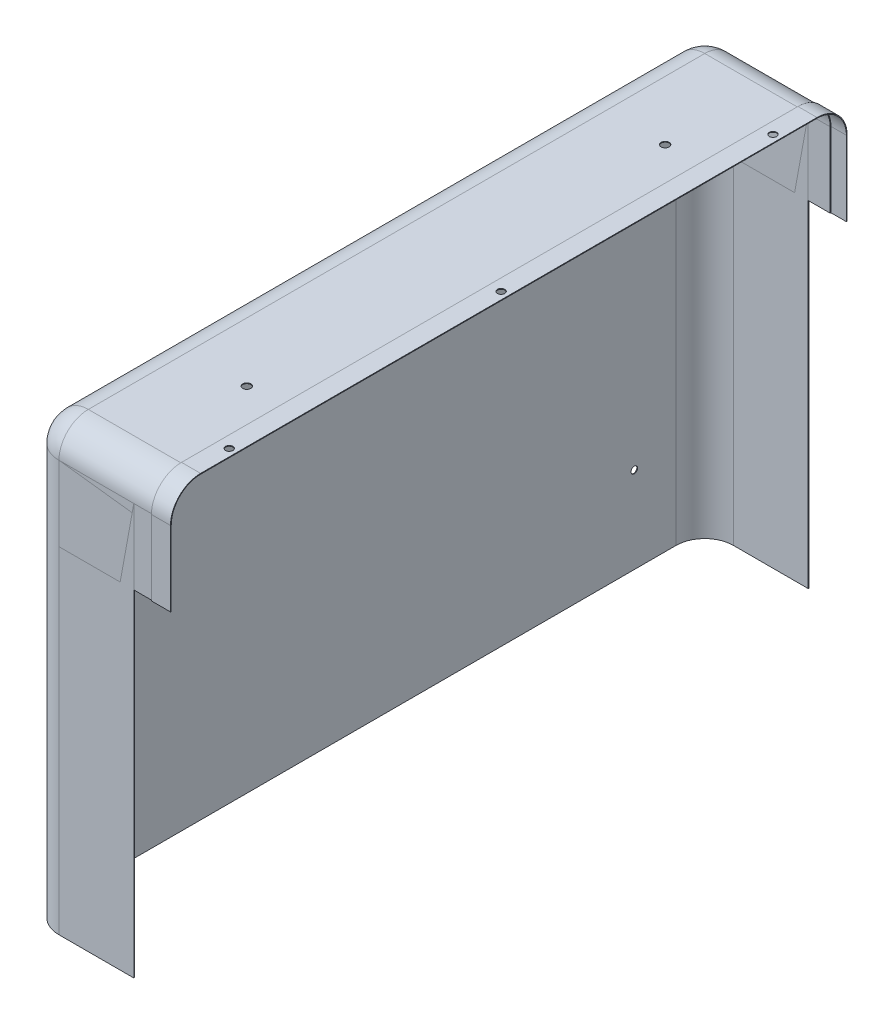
ISO-10303-21;
HEADER;
FILE_DESCRIPTION(('STEP AP214'),'2;1');
FILE_NAME('part.step','',(''),(''),'','','');
FILE_SCHEMA(('AUTOMOTIVE_DESIGN { 1 0 10303 214 1 1 1 1 }'));
ENDSEC;
DATA;
#1=APPLICATION_CONTEXT('core data for automotive mechanical design processes');
#2=APPLICATION_PROTOCOL_DEFINITION('international standard','automotive_design',2000,#1);
#3=PRODUCT_CONTEXT('',#1,'mechanical');
#4=PRODUCT('Part','Part','',(#3));
#5=PRODUCT_RELATED_PRODUCT_CATEGORY('part','',(#4));
#6=PRODUCT_DEFINITION_FORMATION('','',#4);
#7=PRODUCT_DEFINITION_CONTEXT('part definition',#1,'design');
#8=PRODUCT_DEFINITION('design','',#6,#7);
#9=PRODUCT_DEFINITION_SHAPE('','',#8);
#10=(LENGTH_UNIT() NAMED_UNIT(*) SI_UNIT(.MILLI.,.METRE.));
#11=(NAMED_UNIT(*) PLANE_ANGLE_UNIT() SI_UNIT($,.RADIAN.));
#12=(NAMED_UNIT(*) SI_UNIT($,.STERADIAN.) SOLID_ANGLE_UNIT());
#13=UNCERTAINTY_MEASURE_WITH_UNIT(LENGTH_MEASURE(1.E-05),#10,'distance_accuracy_value','');
#14=(GEOMETRIC_REPRESENTATION_CONTEXT(3) GLOBAL_UNCERTAINTY_ASSIGNED_CONTEXT((#13)) GLOBAL_UNIT_ASSIGNED_CONTEXT((#10,
#11,#12)) REPRESENTATION_CONTEXT('',''));
#15=CARTESIAN_POINT('',(0.,0.,0.));
#16=DIRECTION('',(0.,0.,1.));
#17=DIRECTION('',(1.,0.,0.));
#18=AXIS2_PLACEMENT_3D('',#15,#16,#17);
#19=CARTESIAN_POINT('',(20.9999999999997,-1.77635683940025E-12,-310.999999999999));
#20=DIRECTION('',(0.,-1.,0.));
#21=DIRECTION('',(0.,0.,-0.999999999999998));
#22=AXIS2_PLACEMENT_3D('',#19,#20,#21);
#23=PLANE('',#22);
#24=CARTESIAN_POINT('',(11.000000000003,-3.10862446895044E-12,109.5));
#25=DIRECTION('',(0.,1.,0.));
#26=DIRECTION('',(0.,0.,0.999999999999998));
#27=AXIS2_PLACEMENT_3D('',#24,#25,#26);
#28=CIRCLE('',#27,5.);
#29=CARTESIAN_POINT('',(11.000000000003,-3.10923304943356E-12,114.5));
#30=VERTEX_POINT('',#29);
#31=EDGE_CURVE('E1190',#30,#30,#28,.T.);
#32=ORIENTED_EDGE('',*,*,#31,.T.);
#33=EDGE_LOOP('',(#32));
#34=FACE_BOUND('',#33,.T.);
#35=DIRECTION('',(0.,0.,0.999999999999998));
#36=VECTOR('',#35,1.);
#37=CARTESIAN_POINT('',(0.,0.,0.));
#38=LINE('',#37,#36);
#39=CARTESIAN_POINT('',(-4.44089209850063E-13,-3.10862446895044E-12,-310.999999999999));
#40=VERTEX_POINT('',#39);
#41=CARTESIAN_POINT('',(-6.66133814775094E-13,-3.5527136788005E-12,528.999999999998));
#42=VERTEX_POINT('',#41);
#43=EDGE_CURVE('E1377',#40,#42,#38,.T.);
#44=ORIENTED_EDGE('',*,*,#43,.F.);
#45=DIRECTION('',(-1.,0.,0.));
#46=VECTOR('',#45,1.);
#47=CARTESIAN_POINT('',(20.9999999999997,-1.77635683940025E-12,-310.999999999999));
#48=LINE('',#47,#46);
#49=CARTESIAN_POINT('',(20.9999999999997,-1.77635683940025E-12,-310.999999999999));
#50=VERTEX_POINT('',#49);
#51=EDGE_CURVE('E1390',#50,#40,#48,.T.);
#52=ORIENTED_EDGE('',*,*,#51,.F.);
#53=DIRECTION('',(0.,0.,0.999999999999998));
#54=VECTOR('',#53,1.);
#55=CARTESIAN_POINT('',(20.9999999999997,-1.77635683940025E-12,-310.999999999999));
#56=LINE('',#55,#54);
#57=CARTESIAN_POINT('',(20.9999999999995,-2.22044604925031E-12,528.999999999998));
#58=VERTEX_POINT('',#57);
#59=EDGE_CURVE('E1425',#50,#58,#56,.T.);
#60=ORIENTED_EDGE('',*,*,#59,.T.);
#61=DIRECTION('',(-1.,0.,0.));
#62=VECTOR('',#61,1.);
#63=CARTESIAN_POINT('',(20.9999999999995,-2.22044604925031E-12,528.999999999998));
#64=LINE('',#63,#62);
#65=EDGE_CURVE('E1387',#58,#42,#64,.T.);
#66=ORIENTED_EDGE('',*,*,#65,.T.);
#67=EDGE_LOOP('',(#44,#52,#60,#66));
#68=FACE_BOUND('',#67,.T.);
#69=CARTESIAN_POINT('',(11.0000000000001,0.,-260.999999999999));
#70=DIRECTION('',(0.,1.,0.));
#71=DIRECTION('',(0.,0.,0.999999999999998));
#72=AXIS2_PLACEMENT_3D('',#69,#70,#71);
#73=CIRCLE('',#72,5.);
#74=CARTESIAN_POINT('',(11.0000000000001,0.,-255.999999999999));
#75=VERTEX_POINT('',#74);
#76=EDGE_CURVE('E1186',#75,#75,#73,.T.);
#77=ORIENTED_EDGE('',*,*,#76,.T.);
#78=EDGE_LOOP('',(#77));
#79=FACE_BOUND('',#78,.T.);
#80=CARTESIAN_POINT('',(11.0000000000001,-4.44089209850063E-13,479.999999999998));
#81=DIRECTION('',(0.,1.,0.));
#82=DIRECTION('',(0.,0.,0.999999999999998));
#83=AXIS2_PLACEMENT_3D('',#80,#81,#82);
#84=CIRCLE('',#83,5.00000000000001);
#85=CARTESIAN_POINT('',(11.0000000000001,-4.44697790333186E-13,484.999999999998));
#86=VERTEX_POINT('',#85);
#87=EDGE_CURVE('E1193',#86,#86,#84,.T.);
#88=ORIENTED_EDGE('',*,*,#87,.T.);
#89=EDGE_LOOP('',(#88));
#90=FACE_BOUND('',#89,.T.);
#91=ADVANCED_FACE('F28',(#34,#68,#79,#90),#23,.T.);
#92=CARTESIAN_POINT('',(20.9999999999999,0.999999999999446,-310.999999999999));
#93=DIRECTION('',(0.,-1.,0.));
#94=DIRECTION('',(0.,0.,-0.999999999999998));
#95=AXIS2_PLACEMENT_3D('',#92,#93,#94);
#96=PLANE('',#95);
#97=CARTESIAN_POINT('',(11.0000000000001,0.99999999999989,109.5));
#98=DIRECTION('',(0.,-1.,0.));
#99=DIRECTION('',(0.,0.,-0.999999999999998));
#100=AXIS2_PLACEMENT_3D('',#97,#98,#99);
#101=CIRCLE('',#100,5.);
#102=CARTESIAN_POINT('',(11.0000000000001,0.99999999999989,104.5));
#103=VERTEX_POINT('',#102);
#104=EDGE_CURVE('E1187',#103,#103,#101,.F.);
#105=ORIENTED_EDGE('',*,*,#104,.F.);
#106=EDGE_LOOP('',(#105));
#107=FACE_BOUND('',#106,.T.);
#108=DIRECTION('',(-1.,0.,0.));
#109=VECTOR('',#108,1.);
#110=CARTESIAN_POINT('',(20.9999999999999,0.999999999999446,-310.999999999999));
#111=LINE('',#110,#109);
#112=CARTESIAN_POINT('',(20.9999999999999,0.999999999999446,-310.999999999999));
#113=VERTEX_POINT('',#112);
#114=CARTESIAN_POINT('',(-5.00000000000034,0.999999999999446,-310.999999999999));
#115=VERTEX_POINT('',#114);
#116=EDGE_CURVE('E1402',#113,#115,#111,.T.);
#117=ORIENTED_EDGE('',*,*,#116,.T.);
#118=DIRECTION('',(0.,0.,0.999999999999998));
#119=VECTOR('',#118,1.);
#120=CARTESIAN_POINT('',(-5.00000000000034,0.999999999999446,-310.999999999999));
#121=LINE('',#120,#119);
#122=CARTESIAN_POINT('',(-4.99999999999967,0.999999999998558,528.999999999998));
#123=VERTEX_POINT('',#122);
#124=EDGE_CURVE('E1442',#115,#123,#121,.T.);
#125=ORIENTED_EDGE('',*,*,#124,.T.);
#126=DIRECTION('',(-1.,0.,0.));
#127=VECTOR('',#126,1.);
#128=CARTESIAN_POINT('',(20.9999999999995,0.999999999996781,528.999999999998));
#129=LINE('',#128,#127);
#130=CARTESIAN_POINT('',(20.9999999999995,0.999999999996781,528.999999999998));
#131=VERTEX_POINT('',#130);
#132=EDGE_CURVE('E1404',#131,#123,#129,.T.);
#133=ORIENTED_EDGE('',*,*,#132,.F.);
#134=DIRECTION('',(0.,0.,0.999999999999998));
#135=VECTOR('',#134,1.);
#136=CARTESIAN_POINT('',(20.9999999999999,0.999999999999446,-310.999999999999));
#137=LINE('',#136,#135);
#138=EDGE_CURVE('E1410',#113,#131,#137,.T.);
#139=ORIENTED_EDGE('',*,*,#138,.F.);
#140=EDGE_LOOP('',(#117,#125,#133,#139));
#141=FACE_BOUND('',#140,.T.);
#142=CARTESIAN_POINT('',(10.999999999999,1.00000000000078,-260.999999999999));
#143=DIRECTION('',(0.,-1.,0.));
#144=DIRECTION('',(0.,0.,-0.999999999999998));
#145=AXIS2_PLACEMENT_3D('',#142,#143,#144);
#146=CIRCLE('',#145,5.);
#147=CARTESIAN_POINT('',(10.999999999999,1.00000000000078,-265.999999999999));
#148=VERTEX_POINT('',#147);
#149=EDGE_CURVE('E1183',#148,#148,#146,.F.);
#150=ORIENTED_EDGE('',*,*,#149,.F.);
#151=EDGE_LOOP('',(#150));
#152=FACE_BOUND('',#151,.T.);
#153=CARTESIAN_POINT('',(11.0000000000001,0.99999999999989,479.999999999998));
#154=DIRECTION('',(0.,-1.,0.));
#155=DIRECTION('',(0.,0.,-0.999999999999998));
#156=AXIS2_PLACEMENT_3D('',#153,#154,#155);
#157=CIRCLE('',#156,5.00000000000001);
#158=CARTESIAN_POINT('',(11.0000000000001,0.99999999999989,474.999999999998));
#159=VERTEX_POINT('',#158);
#160=EDGE_CURVE('E1191',#159,#159,#157,.F.);
#161=ORIENTED_EDGE('',*,*,#160,.F.);
#162=EDGE_LOOP('',(#161));
#163=FACE_BOUND('',#162,.T.);
#164=ADVANCED_FACE('F862',(#107,#141,#152,#163),#96,.F.);
#165=CARTESIAN_POINT('',(-132.,0.,0.));
#166=DIRECTION('',(0.,1.,0.));
#167=DIRECTION('',(0.,0.,0.999999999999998));
#168=AXIS2_PLACEMENT_3D('',#165,#166,#167);
#169=PLANE('',#168);
#170=CARTESIAN_POINT('',(-51.4999999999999,0.,-176.475767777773));
#171=DIRECTION('',(0.,1.,0.));
#172=DIRECTION('',(0.,0.,0.999999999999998));
#173=AXIS2_PLACEMENT_3D('',#170,#171,#172);
#174=CIRCLE('',#173,5.5);
#175=CARTESIAN_POINT('',(-51.4999999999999,0.,-170.975767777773));
#176=VERTEX_POINT('',#175);
#177=EDGE_CURVE('E1206',#176,#176,#174,.T.);
#178=ORIENTED_EDGE('',*,*,#177,.F.);
#179=EDGE_LOOP('',(#178));
#180=FACE_BOUND('',#179,.T.);
#181=CARTESIAN_POINT('',(-51.5000000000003,0.,393.524232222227));
#182=DIRECTION('',(0.,1.,0.));
#183=DIRECTION('',(0.,0.,0.999999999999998));
#184=AXIS2_PLACEMENT_3D('',#181,#182,#183);
#185=CIRCLE('',#184,5.5);
#186=CARTESIAN_POINT('',(-51.5000000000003,0.,399.024232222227));
#187=VERTEX_POINT('',#186);
#188=EDGE_CURVE('E1196',#187,#187,#185,.T.);
#189=ORIENTED_EDGE('',*,*,#188,.F.);
#190=EDGE_LOOP('',(#189));
#191=FACE_BOUND('',#190,.T.);
#192=DIRECTION('',(1.,0.,0.));
#193=VECTOR('',#192,1.);
#194=CARTESIAN_POINT('',(-131.999999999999,-8.88178419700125E-13,528.999999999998));
#195=LINE('',#194,#193);
#196=CARTESIAN_POINT('',(-131.999999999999,-8.88178419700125E-13,528.999999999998));
#197=VERTEX_POINT('',#196);
#198=CARTESIAN_POINT('',(-5.00000000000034,0.,528.999999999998));
#199=VERTEX_POINT('',#198);
#200=EDGE_CURVE('E1277',#197,#199,#195,.T.);
#201=ORIENTED_EDGE('',*,*,#200,.T.);
#202=DIRECTION('',(0.,0.,0.999999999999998));
#203=VECTOR('',#202,1.);
#204=CARTESIAN_POINT('',(-5.00000000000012,0.,-310.999999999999));
#205=LINE('',#204,#203);
#206=CARTESIAN_POINT('',(-5.00000000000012,0.,-310.999999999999));
#207=VERTEX_POINT('',#206);
#208=EDGE_CURVE('E1312',#207,#199,#205,.T.);
#209=ORIENTED_EDGE('',*,*,#208,.F.);
#210=DIRECTION('',(1.,0.,0.));
#211=VECTOR('',#210,1.);
#212=CARTESIAN_POINT('',(-132.,0.,-310.999999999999));
#213=LINE('',#212,#211);
#214=CARTESIAN_POINT('',(-132.,0.,-310.999999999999));
#215=VERTEX_POINT('',#214);
#216=EDGE_CURVE('E1074',#215,#207,#213,.T.);
#217=ORIENTED_EDGE('',*,*,#216,.F.);
#218=DIRECTION('',(0.,0.,0.999999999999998));
#219=VECTOR('',#218,1.);
#220=CARTESIAN_POINT('',(-132.,0.,0.));
#221=LINE('',#220,#219);
#222=EDGE_CURVE('E1314',#215,#197,#221,.T.);
#223=ORIENTED_EDGE('',*,*,#222,.T.);
#224=EDGE_LOOP('',(#201,#209,#217,#223));
#225=FACE_BOUND('',#224,.T.);
#226=ADVANCED_FACE('F865',(#180,#191,#225),#169,.T.);
#227=CARTESIAN_POINT('',(-132.000000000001,-40.0000000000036,528.999999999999));
#228=DIRECTION('',(1.,0.,0.));
#229=DIRECTION('',(0.,1.,0.));
#230=AXIS2_PLACEMENT_3D('',#227,#228,#229);
#231=CYLINDRICAL_SURFACE('',#230,40.);
#232=DIRECTION('',(1.,0.,0.));
#233=VECTOR('',#232,1.);
#234=CARTESIAN_POINT('',(-132.000000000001,-40.0000000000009,568.999999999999));
#235=LINE('',#234,#233);
#236=CARTESIAN_POINT('',(-132.000000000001,-40.0000000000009,568.999999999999));
#237=VERTEX_POINT('',#236);
#238=CARTESIAN_POINT('',(-4.99999999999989,-40.,568.999999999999));
#239=VERTEX_POINT('',#238);
#240=EDGE_CURVE('E1306',#237,#239,#235,.T.);
#241=ORIENTED_EDGE('',*,*,#240,.T.);
#242=CARTESIAN_POINT('',(-4.99999999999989,-40.,528.999999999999));
#243=DIRECTION('',(1.,0.,0.));
#244=DIRECTION('',(0.,0.,-0.999999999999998));
#245=AXIS2_PLACEMENT_3D('',#242,#243,#244);
#246=CIRCLE('',#245,40.);
#247=EDGE_CURVE('E1316',#199,#239,#246,.T.);
#248=ORIENTED_EDGE('',*,*,#247,.F.);
#249=ORIENTED_EDGE('',*,*,#200,.F.);
#250=CARTESIAN_POINT('',(-132.000000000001,-40.0000000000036,528.999999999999));
#251=DIRECTION('',(1.,0.,0.));
#252=DIRECTION('',(0.,0.,0.999999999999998));
#253=AXIS2_PLACEMENT_3D('',#250,#251,#252);
#254=CIRCLE('',#253,40.);
#255=EDGE_CURVE('E1069',#197,#237,#254,.T.);
#256=ORIENTED_EDGE('',*,*,#255,.T.);
#257=EDGE_LOOP('',(#241,#248,#249,#256));
#258=FACE_BOUND('',#257,.T.);
#259=ADVANCED_FACE('F945',(#258),#231,.T.);
#260=CARTESIAN_POINT('',(-132.000000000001,-40.0000000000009,568.999999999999));
#261=DIRECTION('',(0.,0.,0.999999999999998));
#262=DIRECTION('',(1.,0.,0.));
#263=AXIS2_PLACEMENT_3D('',#260,#261,#262);
#264=PLANE('',#263);
#265=DIRECTION('',(1.,0.,0.));
#266=VECTOR('',#265,1.);
#267=CARTESIAN_POINT('',(-132.,-142.,568.999999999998));
#268=LINE('',#267,#266);
#269=CARTESIAN_POINT('',(-132.,-142.,568.999999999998));
#270=VERTEX_POINT('',#269);
#271=CARTESIAN_POINT('',(-4.99999999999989,-142.,568.999999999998));
#272=VERTEX_POINT('',#271);
#273=EDGE_CURVE('E1303',#270,#272,#268,.T.);
#274=ORIENTED_EDGE('',*,*,#273,.T.);
#275=DIRECTION('',(0.,-1.,0.));
#276=VECTOR('',#275,1.);
#277=CARTESIAN_POINT('',(-4.99999999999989,-40.,568.999999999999));
#278=LINE('',#277,#276);
#279=EDGE_CURVE('E1458',#239,#272,#278,.T.);
#280=ORIENTED_EDGE('',*,*,#279,.F.);
#281=ORIENTED_EDGE('',*,*,#240,.F.);
#282=DIRECTION('',(0.,-1.,0.));
#283=VECTOR('',#282,1.);
#284=CARTESIAN_POINT('',(-132.000000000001,-40.0000000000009,568.999999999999));
#285=LINE('',#284,#283);
#286=EDGE_CURVE('E1354',#237,#270,#285,.T.);
#287=ORIENTED_EDGE('',*,*,#286,.T.);
#288=EDGE_LOOP('',(#274,#280,#281,#287));
#289=FACE_BOUND('',#288,.T.);
#290=ADVANCED_FACE('F913',(#289),#264,.T.);
#291=CARTESIAN_POINT('',(-132.,-40.0000000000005,-350.999999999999));
#292=DIRECTION('',(0.,0.,-0.999999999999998));
#293=DIRECTION('',(-1.,0.,0.));
#294=AXIS2_PLACEMENT_3D('',#291,#292,#293);
#295=PLANE('',#294);
#296=DIRECTION('',(1.,0.,0.));
#297=VECTOR('',#296,1.);
#298=CARTESIAN_POINT('',(-132.,-40.0000000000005,-350.999999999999));
#299=LINE('',#298,#297);
#300=CARTESIAN_POINT('',(-132.,-40.0000000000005,-350.999999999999));
#301=VERTEX_POINT('',#300);
#302=CARTESIAN_POINT('',(-4.99999999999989,-40.,-350.999999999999));
#303=VERTEX_POINT('',#302);
#304=EDGE_CURVE('E1280',#301,#303,#299,.T.);
#305=ORIENTED_EDGE('',*,*,#304,.T.);
#306=DIRECTION('',(0.,1.,0.));
#307=VECTOR('',#306,1.);
#308=CARTESIAN_POINT('',(-4.99999999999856,-142.000000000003,-350.999999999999));
#309=LINE('',#308,#307);
#310=CARTESIAN_POINT('',(-4.99999999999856,-142.000000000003,-350.999999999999));
#311=VERTEX_POINT('',#310);
#312=EDGE_CURVE('E1453',#311,#303,#309,.T.);
#313=ORIENTED_EDGE('',*,*,#312,.F.);
#314=DIRECTION('',(1.,0.,0.));
#315=VECTOR('',#314,1.);
#316=CARTESIAN_POINT('',(-132.,-142.,-350.999999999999));
#317=LINE('',#316,#315);
#318=CARTESIAN_POINT('',(-132.,-142.,-350.999999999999));
#319=VERTEX_POINT('',#318);
#320=EDGE_CURVE('E1283',#319,#311,#317,.T.);
#321=ORIENTED_EDGE('',*,*,#320,.F.);
#322=DIRECTION('',(0.,1.,0.));
#323=VECTOR('',#322,1.);
#324=CARTESIAN_POINT('',(-132.,-40.0000000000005,-350.999999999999));
#325=LINE('',#324,#323);
#326=EDGE_CURVE('E1267',#319,#301,#325,.T.);
#327=ORIENTED_EDGE('',*,*,#326,.T.);
#328=EDGE_LOOP('',(#305,#313,#321,#327));
#329=FACE_BOUND('',#328,.T.);
#330=ADVANCED_FACE('F909',(#329),#295,.T.);
#331=CARTESIAN_POINT('',(-132.000000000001,-40.0000000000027,-310.999999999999));
#332=DIRECTION('',(1.,0.,0.));
#333=DIRECTION('',(0.,1.,0.));
#334=AXIS2_PLACEMENT_3D('',#331,#332,#333);
#335=CYLINDRICAL_SURFACE('',#334,40.);
#336=ORIENTED_EDGE('',*,*,#216,.T.);
#337=CARTESIAN_POINT('',(-4.99999999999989,-40.,-310.999999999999));
#338=DIRECTION('',(1.,0.,0.));
#339=DIRECTION('',(0.,0.,-0.999999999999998));
#340=AXIS2_PLACEMENT_3D('',#337,#338,#339);
#341=CIRCLE('',#340,40.);
#342=EDGE_CURVE('E1325',#303,#207,#341,.T.);
#343=ORIENTED_EDGE('',*,*,#342,.F.);
#344=ORIENTED_EDGE('',*,*,#304,.F.);
#345=CARTESIAN_POINT('',(-132.000000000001,-40.0000000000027,-310.999999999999));
#346=DIRECTION('',(1.,0.,0.));
#347=DIRECTION('',(0.,0.,0.999999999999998));
#348=AXIS2_PLACEMENT_3D('',#345,#346,#347);
#349=CIRCLE('',#348,40.);
#350=EDGE_CURVE('E1274',#301,#215,#349,.T.);
#351=ORIENTED_EDGE('',*,*,#350,.T.);
#352=EDGE_LOOP('',(#336,#343,#344,#351));
#353=FACE_BOUND('',#352,.T.);
#354=ADVANCED_FACE('F901',(#353),#335,.T.);
#355=CARTESIAN_POINT('',(0.,-40.0000000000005,-310.999999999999));
#356=DIRECTION('',(-1.,0.,0.));
#357=DIRECTION('',(0.,0.,0.999999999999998));
#358=AXIS2_PLACEMENT_3D('',#355,#356,#357);
#359=PLANE('',#358);
#360=CARTESIAN_POINT('',(0.,-40.0000000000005,-310.999999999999));
#361=DIRECTION('',(1.,0.,0.));
#362=DIRECTION('',(0.,0.,0.999999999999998));
#363=AXIS2_PLACEMENT_3D('',#360,#361,#362);
#364=CIRCLE('',#363,40.);
#365=CARTESIAN_POINT('',(-2.22044604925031E-13,-40.0000000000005,-350.999999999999));
#366=VERTEX_POINT('',#365);
#367=EDGE_CURVE('E1349',#366,#40,#364,.T.);
#368=ORIENTED_EDGE('',*,*,#367,.T.);
#369=ORIENTED_EDGE('',*,*,#43,.T.);
#370=CARTESIAN_POINT('',(-4.44089209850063E-13,-40.0000000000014,528.999999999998));
#371=DIRECTION('',(1.,0.,0.));
#372=DIRECTION('',(0.,0.,0.999999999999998));
#373=AXIS2_PLACEMENT_3D('',#370,#371,#372);
#374=CIRCLE('',#373,40.);
#375=CARTESIAN_POINT('',(-2.22044604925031E-13,-40.0000000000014,568.999999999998));
#376=VERTEX_POINT('',#375);
#377=EDGE_CURVE('E1374',#42,#376,#374,.T.);
#378=ORIENTED_EDGE('',*,*,#377,.T.);
#379=DIRECTION('',(0.,-1.,0.));
#380=VECTOR('',#379,1.);
#381=CARTESIAN_POINT('',(-2.22044604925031E-13,-40.0000000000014,568.999999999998));
#382=LINE('',#381,#380);
#383=CARTESIAN_POINT('',(0.,-142.,568.999999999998));
#384=VERTEX_POINT('',#383);
#385=EDGE_CURVE('E1371',#376,#384,#382,.T.);
#386=ORIENTED_EDGE('',*,*,#385,.T.);
#387=DIRECTION('',(0.,0.,-0.999999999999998));
#388=VECTOR('',#387,1.);
#389=CARTESIAN_POINT('',(0.,-142.,568.999999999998));
#390=LINE('',#389,#388);
#391=CARTESIAN_POINT('',(0.,-142.,567.999999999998));
#392=VERTEX_POINT('',#391);
#393=EDGE_CURVE('E1369',#384,#392,#390,.T.);
#394=ORIENTED_EDGE('',*,*,#393,.T.);
#395=DIRECTION('',(0.,1.,0.));
#396=VECTOR('',#395,1.);
#397=CARTESIAN_POINT('',(-2.22044604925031E-13,-40.0000000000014,567.999999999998));
#398=LINE('',#397,#396);
#399=CARTESIAN_POINT('',(-2.22044604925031E-13,-40.0000000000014,567.999999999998));
#400=VERTEX_POINT('',#399);
#401=EDGE_CURVE('E1365',#392,#400,#398,.T.);
#402=ORIENTED_EDGE('',*,*,#401,.T.);
#403=CARTESIAN_POINT('',(-4.44089209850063E-13,-40.0000000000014,528.999999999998));
#404=DIRECTION('',(-1.,0.,0.));
#405=DIRECTION('',(0.,0.,0.999999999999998));
#406=AXIS2_PLACEMENT_3D('',#403,#404,#405);
#407=CIRCLE('',#406,39.);
#408=CARTESIAN_POINT('',(8.88178419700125E-13,-1.00000000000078,528.999999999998));
#409=VERTEX_POINT('',#408);
#410=EDGE_CURVE('E1364',#400,#409,#407,.T.);
#411=ORIENTED_EDGE('',*,*,#410,.T.);
#412=DIRECTION('',(0.,0.,-0.999999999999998));
#413=VECTOR('',#412,1.);
#414=CARTESIAN_POINT('',(-1.11022302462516E-12,-0.99999999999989,0.));
#415=LINE('',#414,#413);
#416=CARTESIAN_POINT('',(-2.22044604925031E-12,-0.999999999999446,-310.999999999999));
#417=VERTEX_POINT('',#416);
#418=EDGE_CURVE('E1343',#409,#417,#415,.T.);
#419=ORIENTED_EDGE('',*,*,#418,.T.);
#420=CARTESIAN_POINT('',(0.,-40.0000000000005,-310.999999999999));
#421=DIRECTION('',(-1.,0.,0.));
#422=DIRECTION('',(0.,0.,0.999999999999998));
#423=AXIS2_PLACEMENT_3D('',#420,#421,#422);
#424=CIRCLE('',#423,39.);
#425=CARTESIAN_POINT('',(-2.22044604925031E-13,-40.0000000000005,-349.999999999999));
#426=VERTEX_POINT('',#425);
#427=EDGE_CURVE('E1339',#417,#426,#424,.T.);
#428=ORIENTED_EDGE('',*,*,#427,.T.);
#429=DIRECTION('',(0.,-1.,0.));
#430=VECTOR('',#429,1.);
#431=CARTESIAN_POINT('',(-2.22044604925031E-13,-40.0000000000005,-349.999999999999));
#432=LINE('',#431,#430);
#433=CARTESIAN_POINT('',(0.,-142.,-349.999999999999));
#434=VERTEX_POINT('',#433);
#435=EDGE_CURVE('E1338',#426,#434,#432,.T.);
#436=ORIENTED_EDGE('',*,*,#435,.T.);
#437=DIRECTION('',(0.,0.,-0.999999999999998));
#438=VECTOR('',#437,1.);
#439=CARTESIAN_POINT('',(0.,-142.,-350.999999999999));
#440=LINE('',#439,#438);
#441=CARTESIAN_POINT('',(0.,-142.,-350.999999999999));
#442=VERTEX_POINT('',#441);
#443=EDGE_CURVE('E1336',#434,#442,#440,.T.);
#444=ORIENTED_EDGE('',*,*,#443,.T.);
#445=DIRECTION('',(0.,1.,0.));
#446=VECTOR('',#445,1.);
#447=CARTESIAN_POINT('',(-2.22044604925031E-13,-40.0000000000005,-350.999999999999));
#448=LINE('',#447,#446);
#449=EDGE_CURVE('E1341',#442,#366,#448,.T.);
#450=ORIENTED_EDGE('',*,*,#449,.T.);
#451=EDGE_LOOP('',(#368,#369,#378,#386,#394,#402,#411,#419,#428,#436,#444,#450));
#452=FACE_BOUND('',#451,.T.);
#453=ADVANCED_FACE('F897',(#452),#359,.F.);
#454=CARTESIAN_POINT('',(-132.,-600.,-310.999999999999));
#455=DIRECTION('',(0.,-1.,0.));
#456=DIRECTION('',(0.,0.,0.999999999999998));
#457=AXIS2_PLACEMENT_3D('',#454,#455,#456);
#458=PLANE('',#457);
#459=DIRECTION('',(0.,0.,0.999999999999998));
#460=VECTOR('',#459,1.);
#461=CARTESIAN_POINT('',(-171.999999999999,-600.,0.));
#462=LINE('',#461,#460);
#463=CARTESIAN_POINT('',(-171.999999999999,-600.000000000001,-310.999999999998));
#464=VERTEX_POINT('',#463);
#465=CARTESIAN_POINT('',(-172.,-600.,528.999999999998));
#466=VERTEX_POINT('',#465);
#467=EDGE_CURVE('E1119',#464,#466,#462,.T.);
#468=ORIENTED_EDGE('',*,*,#467,.F.);
#469=CARTESIAN_POINT('',(-132.,-600.,-310.999999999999));
#470=DIRECTION('',(0.,1.,0.));
#471=DIRECTION('',(0.,0.,0.999999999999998));
#472=AXIS2_PLACEMENT_3D('',#469,#470,#471);
#473=CIRCLE('',#472,40.);
#474=CARTESIAN_POINT('',(-132.000000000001,-600.000000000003,-350.999999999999));
#475=VERTEX_POINT('',#474);
#476=EDGE_CURVE('E1121',#475,#464,#473,.T.);
#477=ORIENTED_EDGE('',*,*,#476,.F.);
#478=DIRECTION('',(-1.,0.,0.));
#479=VECTOR('',#478,1.);
#480=CARTESIAN_POINT('',(-132.000000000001,-600.000000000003,-350.999999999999));
#481=LINE('',#480,#479);
#482=CARTESIAN_POINT('',(-29.9999999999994,-600.000000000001,-350.999999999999));
#483=VERTEX_POINT('',#482);
#484=EDGE_CURVE('E1124',#483,#475,#481,.T.);
#485=ORIENTED_EDGE('',*,*,#484,.F.);
#486=DIRECTION('',(0.,0.,-0.999999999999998));
#487=VECTOR('',#486,1.);
#488=CARTESIAN_POINT('',(-29.9999999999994,-600.000000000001,-350.999999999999));
#489=LINE('',#488,#487);
#490=CARTESIAN_POINT('',(-29.9999999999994,-600.000000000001,-349.999999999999));
#491=VERTEX_POINT('',#490);
#492=EDGE_CURVE('E1127',#491,#483,#489,.T.);
#493=ORIENTED_EDGE('',*,*,#492,.F.);
#494=DIRECTION('',(1.,0.,0.));
#495=VECTOR('',#494,1.);
#496=CARTESIAN_POINT('',(-132.000000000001,-600.000000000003,-349.999999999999));
#497=LINE('',#496,#495);
#498=CARTESIAN_POINT('',(-132.000000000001,-600.000000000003,-349.999999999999));
#499=VERTEX_POINT('',#498);
#500=EDGE_CURVE('E1130',#499,#491,#497,.T.);
#501=ORIENTED_EDGE('',*,*,#500,.F.);
#502=CARTESIAN_POINT('',(-132.,-600.,-310.999999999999));
#503=DIRECTION('',(0.,-1.,0.));
#504=DIRECTION('',(0.,0.,0.999999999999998));
#505=AXIS2_PLACEMENT_3D('',#502,#503,#504);
#506=CIRCLE('',#505,39.);
#507=CARTESIAN_POINT('',(-171.000000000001,-600.000000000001,-310.999999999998));
#508=VERTEX_POINT('',#507);
#509=EDGE_CURVE('E1133',#508,#499,#506,.T.);
#510=ORIENTED_EDGE('',*,*,#509,.F.);
#511=DIRECTION('',(0.,0.,-0.999999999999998));
#512=VECTOR('',#511,1.);
#513=CARTESIAN_POINT('',(-171.000000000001,-600.000000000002,0.));
#514=LINE('',#513,#512);
#515=CARTESIAN_POINT('',(-170.999999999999,-600.000000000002,528.999999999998));
#516=VERTEX_POINT('',#515);
#517=EDGE_CURVE('E1136',#516,#508,#514,.T.);
#518=ORIENTED_EDGE('',*,*,#517,.F.);
#519=CARTESIAN_POINT('',(-132.,-600.,528.999999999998));
#520=DIRECTION('',(0.,-1.,0.));
#521=DIRECTION('',(0.,0.,0.999999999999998));
#522=AXIS2_PLACEMENT_3D('',#519,#520,#521);
#523=CIRCLE('',#522,39.);
#524=CARTESIAN_POINT('',(-131.999999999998,-600.000000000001,567.999999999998));
#525=VERTEX_POINT('',#524);
#526=EDGE_CURVE('E1139',#525,#516,#523,.T.);
#527=ORIENTED_EDGE('',*,*,#526,.F.);
#528=DIRECTION('',(-1.,0.,0.));
#529=VECTOR('',#528,1.);
#530=CARTESIAN_POINT('',(-131.999999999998,-600.000000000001,567.999999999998));
#531=LINE('',#530,#529);
#532=CARTESIAN_POINT('',(-29.9999999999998,-600.,567.999999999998));
#533=VERTEX_POINT('',#532);
#534=EDGE_CURVE('E1142',#533,#525,#531,.T.);
#535=ORIENTED_EDGE('',*,*,#534,.F.);
#536=DIRECTION('',(0.,0.,-0.999999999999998));
#537=VECTOR('',#536,1.);
#538=CARTESIAN_POINT('',(-29.9999999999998,-600.,568.999999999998));
#539=LINE('',#538,#537);
#540=CARTESIAN_POINT('',(-29.9999999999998,-600.,568.999999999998));
#541=VERTEX_POINT('',#540);
#542=EDGE_CURVE('E1145',#541,#533,#539,.T.);
#543=ORIENTED_EDGE('',*,*,#542,.F.);
#544=DIRECTION('',(1.,0.,0.));
#545=VECTOR('',#544,1.);
#546=CARTESIAN_POINT('',(-131.999999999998,-600.000000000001,568.999999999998));
#547=LINE('',#546,#545);
#548=CARTESIAN_POINT('',(-131.999999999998,-600.000000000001,568.999999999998));
#549=VERTEX_POINT('',#548);
#550=EDGE_CURVE('E1148',#549,#541,#547,.T.);
#551=ORIENTED_EDGE('',*,*,#550,.F.);
#552=CARTESIAN_POINT('',(-132.,-600.,528.999999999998));
#553=DIRECTION('',(0.,1.,0.));
#554=DIRECTION('',(0.,0.,0.999999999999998));
#555=AXIS2_PLACEMENT_3D('',#552,#553,#554);
#556=CIRCLE('',#555,40.);
#557=EDGE_CURVE('E1064',#466,#549,#556,.T.);
#558=ORIENTED_EDGE('',*,*,#557,.F.);
#559=EDGE_LOOP('',(#468,#477,#485,#493,#501,#510,#518,#527,#535,#543,#551,#558));
#560=FACE_BOUND('',#559,.T.);
#561=ADVANCED_FACE('F900',(#560),#458,.T.);
#562=CARTESIAN_POINT('',(-132.,-142.,568.999999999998));
#563=DIRECTION('',(0.,-1.,0.));
#564=DIRECTION('',(1.,0.,0.));
#565=AXIS2_PLACEMENT_3D('',#562,#563,#564);
#566=PLANE('',#565);
#567=ORIENTED_EDGE('',*,*,#393,.F.);
#568=DIRECTION('',(-1.,0.,0.));
#569=VECTOR('',#568,1.);
#570=CARTESIAN_POINT('',(20.9999999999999,-142.,568.999999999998));
#571=LINE('',#570,#569);
#572=CARTESIAN_POINT('',(20.9999999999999,-142.,568.999999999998));
#573=VERTEX_POINT('',#572);
#574=EDGE_CURVE('E1382',#573,#384,#571,.T.);
#575=ORIENTED_EDGE('',*,*,#574,.F.);
#576=DIRECTION('',(0.,0.,0.999999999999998));
#577=VECTOR('',#576,1.);
#578=CARTESIAN_POINT('',(20.9999999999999,-142.,568.999999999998));
#579=LINE('',#578,#577);
#580=CARTESIAN_POINT('',(20.9999999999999,-142.,569.999999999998));
#581=VERTEX_POINT('',#580);
#582=EDGE_CURVE('E1434',#573,#581,#579,.T.);
#583=ORIENTED_EDGE('',*,*,#582,.T.);
#584=DIRECTION('',(-1.,0.,0.));
#585=VECTOR('',#584,1.);
#586=CARTESIAN_POINT('',(20.9999999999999,-142.,569.999999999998));
#587=LINE('',#586,#585);
#588=CARTESIAN_POINT('',(-4.99999999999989,-142.,569.999999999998));
#589=VERTEX_POINT('',#588);
#590=EDGE_CURVE('E1380',#581,#589,#587,.T.);
#591=ORIENTED_EDGE('',*,*,#590,.T.);
#592=DIRECTION('',(0.,0.,0.999999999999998));
#593=VECTOR('',#592,1.);
#594=CARTESIAN_POINT('',(-4.99999999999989,-142.,568.999999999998));
#595=LINE('',#594,#593);
#596=EDGE_CURVE('E1460',#272,#589,#595,.T.);
#597=ORIENTED_EDGE('',*,*,#596,.F.);
#598=ORIENTED_EDGE('',*,*,#273,.F.);
#599=DIRECTION('',(0.,0.,-0.999999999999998));
#600=VECTOR('',#599,1.);
#601=CARTESIAN_POINT('',(-132.,-142.,568.999999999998));
#602=LINE('',#601,#600);
#603=CARTESIAN_POINT('',(-132.,-142.,567.999999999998));
#604=VERTEX_POINT('',#603);
#605=EDGE_CURVE('E1254',#270,#604,#602,.T.);
#606=ORIENTED_EDGE('',*,*,#605,.T.);
#607=DIRECTION('',(1.,0.,0.));
#608=VECTOR('',#607,1.);
#609=CARTESIAN_POINT('',(-132.,-142.,567.999999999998));
#610=LINE('',#609,#608);
#611=EDGE_CURVE('E1300',#604,#392,#610,.T.);
#612=ORIENTED_EDGE('',*,*,#611,.T.);
#613=EDGE_LOOP('',(#567,#575,#583,#591,#597,#598,#606,#612));
#614=FACE_BOUND('',#613,.T.);
#615=ADVANCED_FACE('F905',(#614),#566,.T.);
#616=CARTESIAN_POINT('',(-132.000000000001,-40.0000000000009,567.999999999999));
#617=DIRECTION('',(0.,0.,-0.999999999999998));
#618=DIRECTION('',(-1.,0.,0.));
#619=AXIS2_PLACEMENT_3D('',#616,#617,#618);
#620=PLANE('',#619);
#621=ORIENTED_EDGE('',*,*,#401,.F.);
#622=ORIENTED_EDGE('',*,*,#611,.F.);
#623=DIRECTION('',(0.,1.,0.));
#624=VECTOR('',#623,1.);
#625=CARTESIAN_POINT('',(-132.000000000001,-40.0000000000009,567.999999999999));
#626=LINE('',#625,#624);
#627=CARTESIAN_POINT('',(-132.000000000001,-40.0000000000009,567.999999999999));
#628=VERTEX_POINT('',#627);
#629=EDGE_CURVE('E1250',#604,#628,#626,.T.);
#630=ORIENTED_EDGE('',*,*,#629,.T.);
#631=DIRECTION('',(1.,0.,0.));
#632=VECTOR('',#631,1.);
#633=CARTESIAN_POINT('',(-132.000000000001,-40.0000000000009,567.999999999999));
#634=LINE('',#633,#632);
#635=EDGE_CURVE('E1297',#628,#400,#634,.T.);
#636=ORIENTED_EDGE('',*,*,#635,.T.);
#637=EDGE_LOOP('',(#621,#622,#630,#636));
#638=FACE_BOUND('',#637,.T.);
#639=ADVANCED_FACE('F935',(#638),#620,.T.);
#640=CARTESIAN_POINT('',(-132.000000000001,-40.0000000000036,528.999999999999));
#641=DIRECTION('',(1.,0.,0.));
#642=DIRECTION('',(0.,1.,0.));
#643=AXIS2_PLACEMENT_3D('',#640,#641,#642);
#644=CYLINDRICAL_SURFACE('',#643,39.);
#645=ORIENTED_EDGE('',*,*,#410,.F.);
#646=ORIENTED_EDGE('',*,*,#635,.F.);
#647=CARTESIAN_POINT('',(-132.000000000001,-40.0000000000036,528.999999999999));
#648=DIRECTION('',(-1.,0.,0.));
#649=DIRECTION('',(0.,0.,0.999999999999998));
#650=AXIS2_PLACEMENT_3D('',#647,#648,#649);
#651=CIRCLE('',#650,39.);
#652=CARTESIAN_POINT('',(-132.,-1.00000000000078,528.999999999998));
#653=VERTEX_POINT('',#652);
#654=EDGE_CURVE('E1243',#628,#653,#651,.T.);
#655=ORIENTED_EDGE('',*,*,#654,.T.);
#656=DIRECTION('',(1.,0.,0.));
#657=VECTOR('',#656,1.);
#658=CARTESIAN_POINT('',(-132.,-1.00000000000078,528.999999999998));
#659=LINE('',#658,#657);
#660=EDGE_CURVE('E1294',#653,#409,#659,.T.);
#661=ORIENTED_EDGE('',*,*,#660,.T.);
#662=EDGE_LOOP('',(#645,#646,#655,#661));
#663=FACE_BOUND('',#662,.T.);
#664=ADVANCED_FACE('F931',(#663),#644,.F.);
#665=CARTESIAN_POINT('',(-132.,-1.00000000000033,0.));
#666=DIRECTION('',(0.,-1.,0.));
#667=DIRECTION('',(1.,0.,0.));
#668=AXIS2_PLACEMENT_3D('',#665,#666,#667);
#669=PLANE('',#668);
#670=CARTESIAN_POINT('',(-51.5000000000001,-1.00000000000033,-176.475767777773));
#671=DIRECTION('',(0.,-1.,0.));
#672=DIRECTION('',(1.,0.,0.));
#673=AXIS2_PLACEMENT_3D('',#670,#671,#672);
#674=CIRCLE('',#673,5.5);
#675=CARTESIAN_POINT('',(-46.0000000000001,-1.00000000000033,-176.475767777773));
#676=VERTEX_POINT('',#675);
#677=EDGE_CURVE('E32',#676,#676,#674,.T.);
#678=ORIENTED_EDGE('',*,*,#677,.F.);
#679=EDGE_LOOP('',(#678));
#680=FACE_BOUND('',#679,.T.);
#681=CARTESIAN_POINT('',(-51.5000000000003,-1.00000000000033,393.524232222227));
#682=DIRECTION('',(0.,-1.,0.));
#683=DIRECTION('',(1.,0.,0.));
#684=AXIS2_PLACEMENT_3D('',#681,#682,#683);
#685=CIRCLE('',#684,5.5);
#686=CARTESIAN_POINT('',(-46.0000000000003,-1.00000000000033,393.524232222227));
#687=VERTEX_POINT('',#686);
#688=EDGE_CURVE('E1194',#687,#687,#685,.T.);
#689=ORIENTED_EDGE('',*,*,#688,.F.);
#690=EDGE_LOOP('',(#689));
#691=FACE_BOUND('',#690,.T.);
#692=ORIENTED_EDGE('',*,*,#418,.F.);
#693=ORIENTED_EDGE('',*,*,#660,.F.);
#694=DIRECTION('',(0.,0.,-0.999999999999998));
#695=VECTOR('',#694,1.);
#696=CARTESIAN_POINT('',(-132.,-1.00000000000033,0.));
#697=LINE('',#696,#695);
#698=CARTESIAN_POINT('',(-132.,-0.99999999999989,-310.999999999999));
#699=VERTEX_POINT('',#698);
#700=EDGE_CURVE('E1239',#653,#699,#697,.T.);
#701=ORIENTED_EDGE('',*,*,#700,.T.);
#702=DIRECTION('',(1.,0.,0.));
#703=VECTOR('',#702,1.);
#704=CARTESIAN_POINT('',(-132.,-0.99999999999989,-310.999999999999));
#705=LINE('',#704,#703);
#706=EDGE_CURVE('E1291',#699,#417,#705,.T.);
#707=ORIENTED_EDGE('',*,*,#706,.T.);
#708=EDGE_LOOP('',(#692,#693,#701,#707));
#709=FACE_BOUND('',#708,.T.);
#710=ADVANCED_FACE('F927',(#680,#691,#709),#669,.T.);
#711=CARTESIAN_POINT('',(-132.000000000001,-40.0000000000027,-310.999999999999));
#712=DIRECTION('',(1.,0.,0.));
#713=DIRECTION('',(0.,1.,0.));
#714=AXIS2_PLACEMENT_3D('',#711,#712,#713);
#715=CYLINDRICAL_SURFACE('',#714,39.);
#716=ORIENTED_EDGE('',*,*,#427,.F.);
#717=ORIENTED_EDGE('',*,*,#706,.F.);
#718=CARTESIAN_POINT('',(-132.000000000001,-40.0000000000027,-310.999999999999));
#719=DIRECTION('',(-1.,0.,0.));
#720=DIRECTION('',(0.,0.,0.999999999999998));
#721=AXIS2_PLACEMENT_3D('',#718,#719,#720);
#722=CIRCLE('',#721,39.);
#723=CARTESIAN_POINT('',(-132.,-40.0000000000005,-349.999999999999));
#724=VERTEX_POINT('',#723);
#725=EDGE_CURVE('E1236',#699,#724,#722,.T.);
#726=ORIENTED_EDGE('',*,*,#725,.T.);
#727=DIRECTION('',(1.,0.,0.));
#728=VECTOR('',#727,1.);
#729=CARTESIAN_POINT('',(-132.,-40.0000000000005,-349.999999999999));
#730=LINE('',#729,#728);
#731=EDGE_CURVE('E1288',#724,#426,#730,.T.);
#732=ORIENTED_EDGE('',*,*,#731,.T.);
#733=EDGE_LOOP('',(#716,#717,#726,#732));
#734=FACE_BOUND('',#733,.T.);
#735=ADVANCED_FACE('F923',(#734),#715,.F.);
#736=CARTESIAN_POINT('',(-132.,-40.0000000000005,-349.999999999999));
#737=DIRECTION('',(0.,0.,0.999999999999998));
#738=DIRECTION('',(1.,0.,0.));
#739=AXIS2_PLACEMENT_3D('',#736,#737,#738);
#740=PLANE('',#739);
#741=ORIENTED_EDGE('',*,*,#435,.F.);
#742=ORIENTED_EDGE('',*,*,#731,.F.);
#743=DIRECTION('',(0.,-1.,0.));
#744=VECTOR('',#743,1.);
#745=CARTESIAN_POINT('',(-132.,-40.0000000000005,-349.999999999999));
#746=LINE('',#745,#744);
#747=CARTESIAN_POINT('',(-132.,-142.,-349.999999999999));
#748=VERTEX_POINT('',#747);
#749=EDGE_CURVE('E1262',#724,#748,#746,.T.);
#750=ORIENTED_EDGE('',*,*,#749,.T.);
#751=DIRECTION('',(1.,0.,0.));
#752=VECTOR('',#751,1.);
#753=CARTESIAN_POINT('',(-132.,-142.,-349.999999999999));
#754=LINE('',#753,#752);
#755=EDGE_CURVE('E1286',#748,#434,#754,.T.);
#756=ORIENTED_EDGE('',*,*,#755,.T.);
#757=EDGE_LOOP('',(#741,#742,#750,#756));
#758=FACE_BOUND('',#757,.T.);
#759=ADVANCED_FACE('F919',(#758),#740,.T.);
#760=CARTESIAN_POINT('',(-132.,-142.,-350.999999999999));
#761=DIRECTION('',(0.,-1.,0.));
#762=DIRECTION('',(1.,0.,0.));
#763=AXIS2_PLACEMENT_3D('',#760,#761,#762);
#764=PLANE('',#763);
#765=ORIENTED_EDGE('',*,*,#443,.F.);
#766=ORIENTED_EDGE('',*,*,#755,.F.);
#767=DIRECTION('',(0.,0.,-0.999999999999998));
#768=VECTOR('',#767,1.);
#769=CARTESIAN_POINT('',(-132.,-142.,-350.999999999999));
#770=LINE('',#769,#768);
#771=EDGE_CURVE('E1264',#748,#319,#770,.T.);
#772=ORIENTED_EDGE('',*,*,#771,.T.);
#773=ORIENTED_EDGE('',*,*,#320,.T.);
#774=DIRECTION('',(0.,0.,0.999999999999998));
#775=VECTOR('',#774,1.);
#776=CARTESIAN_POINT('',(-4.99999999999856,-142.000000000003,-351.999999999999));
#777=LINE('',#776,#775);
#778=CARTESIAN_POINT('',(-4.99999999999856,-142.000000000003,-351.999999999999));
#779=VERTEX_POINT('',#778);
#780=EDGE_CURVE('E1451',#779,#311,#777,.T.);
#781=ORIENTED_EDGE('',*,*,#780,.F.);
#782=DIRECTION('',(-1.,0.,0.));
#783=VECTOR('',#782,1.);
#784=CARTESIAN_POINT('',(21.0000000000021,-142.000000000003,-351.999999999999));
#785=LINE('',#784,#783);
#786=CARTESIAN_POINT('',(21.0000000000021,-142.000000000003,-351.999999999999));
#787=VERTEX_POINT('',#786);
#788=EDGE_CURVE('E1398',#787,#779,#785,.T.);
#789=ORIENTED_EDGE('',*,*,#788,.F.);
#790=DIRECTION('',(0.,0.,0.999999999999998));
#791=VECTOR('',#790,1.);
#792=CARTESIAN_POINT('',(21.0000000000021,-142.000000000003,-351.999999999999));
#793=LINE('',#792,#791);
#794=CARTESIAN_POINT('',(21.0000000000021,-142.000000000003,-350.999999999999));
#795=VERTEX_POINT('',#794);
#796=EDGE_CURVE('E1416',#787,#795,#793,.T.);
#797=ORIENTED_EDGE('',*,*,#796,.T.);
#798=DIRECTION('',(-1.,0.,0.));
#799=VECTOR('',#798,1.);
#800=CARTESIAN_POINT('',(21.0000000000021,-142.000000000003,-350.999999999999));
#801=LINE('',#800,#799);
#802=EDGE_CURVE('E1396',#795,#442,#801,.T.);
#803=ORIENTED_EDGE('',*,*,#802,.T.);
#804=EDGE_LOOP('',(#765,#766,#772,#773,#781,#789,#797,#803));
#805=FACE_BOUND('',#804,.T.);
#806=ADVANCED_FACE('F915',(#805),#764,.T.);
#807=CARTESIAN_POINT('',(-132.000000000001,-40.,0.));
#808=DIRECTION('',(0.,0.,0.999999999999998));
#809=DIRECTION('',(1.,0.,0.));
#810=AXIS2_PLACEMENT_3D('',#807,#808,#809);
#811=CYLINDRICAL_SURFACE('',#810,40.);
#812=ORIENTED_EDGE('',*,*,#222,.F.);
#813=CARTESIAN_POINT('',(-132.000000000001,-40.0000000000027,-310.999999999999));
#814=DIRECTION('',(0.,0.,0.999999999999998));
#815=DIRECTION('',(1.,0.,0.));
#816=AXIS2_PLACEMENT_3D('',#813,#814,#815);
#817=CIRCLE('',#816,40.);
#818=CARTESIAN_POINT('',(-172.000000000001,-40.0000000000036,-310.999999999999));
#819=VERTEX_POINT('',#818);
#820=EDGE_CURVE('E1117',#215,#819,#817,.T.);
#821=ORIENTED_EDGE('',*,*,#820,.T.);
#822=DIRECTION('',(0.,0.,0.999999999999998));
#823=VECTOR('',#822,1.);
#824=CARTESIAN_POINT('',(-172.,-40.0000000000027,0.));
#825=LINE('',#824,#823);
#826=CARTESIAN_POINT('',(-172.,-40.,528.999999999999));
#827=VERTEX_POINT('',#826);
#828=EDGE_CURVE('E1072',#819,#827,#825,.T.);
#829=ORIENTED_EDGE('',*,*,#828,.T.);
#830=CARTESIAN_POINT('',(-132.000000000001,-40.0000000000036,528.999999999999));
#831=DIRECTION('',(0.,0.,0.999999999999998));
#832=DIRECTION('',(1.,0.,0.));
#833=AXIS2_PLACEMENT_3D('',#830,#831,#832);
#834=CIRCLE('',#833,39.9999999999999);
#835=EDGE_CURVE('E1071',#197,#827,#834,.T.);
#836=ORIENTED_EDGE('',*,*,#835,.F.);
#837=EDGE_LOOP('',(#812,#821,#829,#836));
#838=FACE_BOUND('',#837,.T.);
#839=ADVANCED_FACE('F918',(#838),#811,.T.);
#840=CARTESIAN_POINT('',(-132.000000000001,-40.0000000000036,528.999999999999));
#841=DIRECTION('',(0.,0.,0.999999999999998));
#842=DIRECTION('',(0.,1.,0.));
#843=AXIS2_PLACEMENT_3D('',#840,#841,#842);
#844=SPHERICAL_SURFACE('',#843,40.);
#845=ORIENTED_EDGE('',*,*,#255,.F.);
#846=ORIENTED_EDGE('',*,*,#835,.T.);
#847=CARTESIAN_POINT('',(-132.000000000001,-40.0000000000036,528.999999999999));
#848=DIRECTION('',(0.,1.,0.));
#849=DIRECTION('',(0.,0.,0.999999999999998));
#850=AXIS2_PLACEMENT_3D('',#847,#848,#849);
#851=CIRCLE('',#850,40.);
#852=EDGE_CURVE('E1058',#827,#237,#851,.T.);
#853=ORIENTED_EDGE('',*,*,#852,.T.);
#854=EDGE_LOOP('',(#845,#846,#853));
#855=FACE_BOUND('',#854,.T.);
#856=ADVANCED_FACE('F955',(#855),#844,.T.);
#857=CARTESIAN_POINT('',(-132.000000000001,-40.0000000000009,568.999999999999));
#858=DIRECTION('',(0.,0.,0.999999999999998));
#859=DIRECTION('',(1.,0.,0.));
#860=AXIS2_PLACEMENT_3D('',#857,#858,#859);
#861=PLANE('',#860);
#862=ORIENTED_EDGE('',*,*,#286,.F.);
#863=DIRECTION('',(1.,0.,0.));
#864=VECTOR('',#863,1.);
#865=CARTESIAN_POINT('',(-132.000000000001,-40.0000000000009,568.999999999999));
#866=LINE('',#865,#864);
#867=CARTESIAN_POINT('',(-30.0000000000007,-40.0000000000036,568.999999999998));
#868=VERTEX_POINT('',#867);
#869=EDGE_CURVE('E1049',#237,#868,#866,.T.);
#870=ORIENTED_EDGE('',*,*,#869,.T.);
#871=CARTESIAN_POINT('',(-132.000000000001,-40.0000000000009,568.999999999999));
#872=DIRECTION('',(0.,0.,0.999999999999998));
#873=DIRECTION('',(1.,0.,0.));
#874=AXIS2_PLACEMENT_3D('',#871,#872,#873);
#875=CIRCLE('',#874,102.);
#876=EDGE_CURVE('E1104',#270,#868,#875,.T.);
#877=ORIENTED_EDGE('',*,*,#876,.F.);
#878=EDGE_LOOP('',(#862,#870,#877));
#879=FACE_BOUND('',#878,.T.);
#880=ADVANCED_FACE('F959',(#879),#861,.F.);
#881=CARTESIAN_POINT('',(-132.000000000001,-40.,0.));
#882=DIRECTION('',(0.,0.,0.999999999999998));
#883=DIRECTION('',(1.,0.,0.));
#884=AXIS2_PLACEMENT_3D('',#881,#882,#883);
#885=CYLINDRICAL_SURFACE('',#884,102.);
#886=ORIENTED_EDGE('',*,*,#605,.F.);
#887=ORIENTED_EDGE('',*,*,#876,.T.);
#888=DIRECTION('',(0.,0.,-0.999999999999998));
#889=VECTOR('',#888,1.);
#890=CARTESIAN_POINT('',(-30.0000000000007,-40.0000000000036,568.999999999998));
#891=LINE('',#890,#889);
#892=CARTESIAN_POINT('',(-30.0000000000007,-40.0000000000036,567.999999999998));
#893=VERTEX_POINT('',#892);
#894=EDGE_CURVE('E1057',#868,#893,#891,.T.);
#895=ORIENTED_EDGE('',*,*,#894,.T.);
#896=CARTESIAN_POINT('',(-132.000000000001,-40.0000000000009,567.999999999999));
#897=DIRECTION('',(0.,0.,0.999999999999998));
#898=DIRECTION('',(1.,0.,0.));
#899=AXIS2_PLACEMENT_3D('',#896,#897,#898);
#900=CIRCLE('',#899,102.);
#901=EDGE_CURVE('E1106',#604,#893,#900,.T.);
#902=ORIENTED_EDGE('',*,*,#901,.F.);
#903=EDGE_LOOP('',(#886,#887,#895,#902));
#904=FACE_BOUND('',#903,.T.);
#905=ADVANCED_FACE('F963',(#904),#885,.F.);
#906=CARTESIAN_POINT('',(-132.000000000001,-40.0000000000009,567.999999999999));
#907=DIRECTION('',(0.,0.,-0.999999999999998));
#908=DIRECTION('',(-1.,0.,0.));
#909=AXIS2_PLACEMENT_3D('',#906,#907,#908);
#910=PLANE('',#909);
#911=ORIENTED_EDGE('',*,*,#629,.F.);
#912=ORIENTED_EDGE('',*,*,#901,.T.);
#913=DIRECTION('',(-1.,0.,0.));
#914=VECTOR('',#913,1.);
#915=CARTESIAN_POINT('',(-132.000000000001,-40.0000000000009,567.999999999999));
#916=LINE('',#915,#914);
#917=EDGE_CURVE('E1080',#893,#628,#916,.T.);
#918=ORIENTED_EDGE('',*,*,#917,.T.);
#919=EDGE_LOOP('',(#911,#912,#918));
#920=FACE_BOUND('',#919,.T.);
#921=ADVANCED_FACE('F967',(#920),#910,.F.);
#922=CARTESIAN_POINT('',(-132.000000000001,-40.0000000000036,528.999999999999));
#923=DIRECTION('',(0.,0.,0.999999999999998));
#924=DIRECTION('',(0.,-1.,0.));
#925=AXIS2_PLACEMENT_3D('',#922,#923,#924);
#926=SPHERICAL_SURFACE('',#925,39.);
#927=ORIENTED_EDGE('',*,*,#654,.F.);
#928=CARTESIAN_POINT('',(-132.000000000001,-40.0000000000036,528.999999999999));
#929=DIRECTION('',(0.,-1.,0.));
#930=DIRECTION('',(0.,0.,0.999999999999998));
#931=AXIS2_PLACEMENT_3D('',#928,#929,#930);
#932=CIRCLE('',#931,39.);
#933=CARTESIAN_POINT('',(-171.000000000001,-40.0000000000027,528.999999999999));
#934=VERTEX_POINT('',#933);
#935=EDGE_CURVE('E1083',#628,#934,#932,.T.);
#936=ORIENTED_EDGE('',*,*,#935,.T.);
#937=CARTESIAN_POINT('',(-132.000000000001,-40.0000000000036,528.999999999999));
#938=DIRECTION('',(0.,0.,0.999999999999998));
#939=DIRECTION('',(1.,0.,0.));
#940=AXIS2_PLACEMENT_3D('',#937,#938,#939);
#941=CIRCLE('',#940,39.);
#942=EDGE_CURVE('E1108',#653,#934,#941,.T.);
#943=ORIENTED_EDGE('',*,*,#942,.F.);
#944=EDGE_LOOP('',(#927,#936,#943));
#945=FACE_BOUND('',#944,.T.);
#946=ADVANCED_FACE('F971',(#945),#926,.F.);
#947=CARTESIAN_POINT('',(-132.000000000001,-40.,0.));
#948=DIRECTION('',(0.,0.,0.999999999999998));
#949=DIRECTION('',(1.,0.,0.));
#950=AXIS2_PLACEMENT_3D('',#947,#948,#949);
#951=CYLINDRICAL_SURFACE('',#950,39.);
#952=ORIENTED_EDGE('',*,*,#700,.F.);
#953=ORIENTED_EDGE('',*,*,#942,.T.);
#954=DIRECTION('',(0.,0.,-0.999999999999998));
#955=VECTOR('',#954,1.);
#956=CARTESIAN_POINT('',(-171.000000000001,-40.0000000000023,0.));
#957=LINE('',#956,#955);
#958=CARTESIAN_POINT('',(-171.,-40.0000000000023,-310.999999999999));
#959=VERTEX_POINT('',#958);
#960=EDGE_CURVE('E1086',#934,#959,#957,.T.);
#961=ORIENTED_EDGE('',*,*,#960,.T.);
#962=CARTESIAN_POINT('',(-132.000000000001,-40.0000000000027,-310.999999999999));
#963=DIRECTION('',(0.,0.,0.999999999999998));
#964=DIRECTION('',(1.,0.,0.));
#965=AXIS2_PLACEMENT_3D('',#962,#963,#964);
#966=CIRCLE('',#965,39.);
#967=EDGE_CURVE('E1110',#699,#959,#966,.T.);
#968=ORIENTED_EDGE('',*,*,#967,.F.);
#969=EDGE_LOOP('',(#952,#953,#961,#968));
#970=FACE_BOUND('',#969,.T.);
#971=ADVANCED_FACE('F975',(#970),#951,.F.);
#972=CARTESIAN_POINT('',(-132.000000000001,-40.0000000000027,-310.999999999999));
#973=DIRECTION('',(0.,0.,0.999999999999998));
#974=DIRECTION('',(0.,1.,0.));
#975=AXIS2_PLACEMENT_3D('',#972,#973,#974);
#976=SPHERICAL_SURFACE('',#975,39.);
#977=ORIENTED_EDGE('',*,*,#725,.F.);
#978=ORIENTED_EDGE('',*,*,#967,.T.);
#979=CARTESIAN_POINT('',(-132.000000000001,-40.0000000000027,-310.999999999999));
#980=DIRECTION('',(0.,-1.,0.));
#981=DIRECTION('',(0.,0.,0.999999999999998));
#982=AXIS2_PLACEMENT_3D('',#979,#980,#981);
#983=CIRCLE('',#982,39.);
#984=EDGE_CURVE('E1088',#959,#724,#983,.T.);
#985=ORIENTED_EDGE('',*,*,#984,.T.);
#986=EDGE_LOOP('',(#977,#978,#985));
#987=FACE_BOUND('',#986,.T.);
#988=ADVANCED_FACE('F979',(#987),#976,.F.);
#989=CARTESIAN_POINT('',(-132.,-40.0000000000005,-349.999999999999));
#990=DIRECTION('',(0.,0.,0.999999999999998));
#991=DIRECTION('',(1.,0.,0.));
#992=AXIS2_PLACEMENT_3D('',#989,#990,#991);
#993=PLANE('',#992);
#994=ORIENTED_EDGE('',*,*,#749,.F.);
#995=DIRECTION('',(1.,0.,0.));
#996=VECTOR('',#995,1.);
#997=CARTESIAN_POINT('',(-132.,-40.0000000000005,-349.999999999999));
#998=LINE('',#997,#996);
#999=CARTESIAN_POINT('',(-29.9999999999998,-40.,-349.999999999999));
#1000=VERTEX_POINT('',#999);
#1001=EDGE_CURVE('E1091',#724,#1000,#998,.T.);
#1002=ORIENTED_EDGE('',*,*,#1001,.T.);
#1003=CARTESIAN_POINT('',(-132.,-40.0000000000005,-349.999999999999));
#1004=DIRECTION('',(0.,0.,0.999999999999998));
#1005=DIRECTION('',(1.,0.,0.));
#1006=AXIS2_PLACEMENT_3D('',#1003,#1004,#1005);
#1007=CIRCLE('',#1006,102.);
#1008=EDGE_CURVE('E1113',#748,#1000,#1007,.T.);
#1009=ORIENTED_EDGE('',*,*,#1008,.F.);
#1010=EDGE_LOOP('',(#994,#1002,#1009));
#1011=FACE_BOUND('',#1010,.T.);
#1012=ADVANCED_FACE('F983',(#1011),#993,.F.);
#1013=CARTESIAN_POINT('',(-132.000000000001,-40.,0.));
#1014=DIRECTION('',(0.,0.,0.999999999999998));
#1015=DIRECTION('',(1.,0.,0.));
#1016=AXIS2_PLACEMENT_3D('',#1013,#1014,#1015);
#1017=CYLINDRICAL_SURFACE('',#1016,102.);
#1018=ORIENTED_EDGE('',*,*,#771,.F.);
#1019=ORIENTED_EDGE('',*,*,#1008,.T.);
#1020=DIRECTION('',(0.,0.,-0.999999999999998));
#1021=VECTOR('',#1020,1.);
#1022=CARTESIAN_POINT('',(-29.9999999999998,-40.,-350.999999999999));
#1023=LINE('',#1022,#1021);
#1024=CARTESIAN_POINT('',(-29.9999999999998,-40.,-350.999999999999));
#1025=VERTEX_POINT('',#1024);
#1026=EDGE_CURVE('E1094',#1000,#1025,#1023,.T.);
#1027=ORIENTED_EDGE('',*,*,#1026,.T.);
#1028=CARTESIAN_POINT('',(-132.,-40.0000000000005,-350.999999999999));
#1029=DIRECTION('',(0.,0.,0.999999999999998));
#1030=DIRECTION('',(1.,0.,0.));
#1031=AXIS2_PLACEMENT_3D('',#1028,#1029,#1030);
#1032=CIRCLE('',#1031,102.);
#1033=EDGE_CURVE('E1115',#319,#1025,#1032,.T.);
#1034=ORIENTED_EDGE('',*,*,#1033,.F.);
#1035=EDGE_LOOP('',(#1018,#1019,#1027,#1034));
#1036=FACE_BOUND('',#1035,.T.);
#1037=ADVANCED_FACE('F987',(#1036),#1017,.F.);
#1038=CARTESIAN_POINT('',(-132.,-40.0000000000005,-350.999999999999));
#1039=DIRECTION('',(0.,0.,-0.999999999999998));
#1040=DIRECTION('',(-1.,0.,0.));
#1041=AXIS2_PLACEMENT_3D('',#1038,#1039,#1040);
#1042=PLANE('',#1041);
#1043=ORIENTED_EDGE('',*,*,#326,.F.);
#1044=ORIENTED_EDGE('',*,*,#1033,.T.);
#1045=DIRECTION('',(-1.,0.,0.));
#1046=VECTOR('',#1045,1.);
#1047=CARTESIAN_POINT('',(-132.,-40.0000000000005,-350.999999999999));
#1048=LINE('',#1047,#1046);
#1049=EDGE_CURVE('E1097',#1025,#301,#1048,.T.);
#1050=ORIENTED_EDGE('',*,*,#1049,.T.);
#1051=EDGE_LOOP('',(#1043,#1044,#1050));
#1052=FACE_BOUND('',#1051,.T.);
#1053=ADVANCED_FACE('F991',(#1052),#1042,.F.);
#1054=CARTESIAN_POINT('',(-132.000000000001,-40.0000000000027,-310.999999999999));
#1055=DIRECTION('',(0.,0.,0.999999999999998));
#1056=DIRECTION('',(0.,1.,0.));
#1057=AXIS2_PLACEMENT_3D('',#1054,#1055,#1056);
#1058=SPHERICAL_SURFACE('',#1057,40.);
#1059=ORIENTED_EDGE('',*,*,#350,.F.);
#1060=CARTESIAN_POINT('',(-132.000000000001,-40.0000000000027,-310.999999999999));
#1061=DIRECTION('',(0.,1.,0.));
#1062=DIRECTION('',(0.,0.,0.999999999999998));
#1063=AXIS2_PLACEMENT_3D('',#1060,#1061,#1062);
#1064=CIRCLE('',#1063,40.);
#1065=EDGE_CURVE('E1100',#301,#819,#1064,.T.);
#1066=ORIENTED_EDGE('',*,*,#1065,.T.);
#1067=ORIENTED_EDGE('',*,*,#820,.F.);
#1068=EDGE_LOOP('',(#1059,#1066,#1067));
#1069=FACE_BOUND('',#1068,.T.);
#1070=ADVANCED_FACE('F995',(#1069),#1058,.T.);
#1071=CARTESIAN_POINT('',(-172.,-40.0000000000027,0.));
#1072=DIRECTION('',(1.,0.,0.));
#1073=DIRECTION('',(0.,0.,-0.999999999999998));
#1074=AXIS2_PLACEMENT_3D('',#1071,#1072,#1073);
#1075=PLANE('',#1074);
#1076=CARTESIAN_POINT('',(-172.,-482.499999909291,470.024232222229));
#1077=DIRECTION('',(-1.,0.,0.));
#1078=DIRECTION('',(0.,0.,0.999999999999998));
#1079=AXIS2_PLACEMENT_3D('',#1076,#1077,#1078);
#1080=CIRCLE('',#1079,4.899605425);
#1081=CARTESIAN_POINT('',(-172.,-482.499999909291,474.923837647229));
#1082=VERTEX_POINT('',#1081);
#1083=EDGE_CURVE('E1182',#1082,#1082,#1080,.T.);
#1084=ORIENTED_EDGE('',*,*,#1083,.F.);
#1085=EDGE_LOOP('',(#1084));
#1086=FACE_BOUND('',#1085,.T.);
#1087=CARTESIAN_POINT('',(-172.,-482.500000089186,-253.975767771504));
#1088=DIRECTION('',(-1.,0.,0.));
#1089=DIRECTION('',(0.,0.,0.999999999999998));
#1090=AXIS2_PLACEMENT_3D('',#1087,#1088,#1089);
#1091=CIRCLE('',#1090,4.50000000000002);
#1092=CARTESIAN_POINT('',(-172.,-482.500000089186,-249.475767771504));
#1093=VERTEX_POINT('',#1092);
#1094=EDGE_CURVE('E565',#1093,#1093,#1091,.T.);
#1095=ORIENTED_EDGE('',*,*,#1094,.F.);
#1096=EDGE_LOOP('',(#1095));
#1097=FACE_BOUND('',#1096,.T.);
#1098=DIRECTION('',(0.,0.,-0.999999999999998));
#1099=VECTOR('',#1098,1.);
#1100=CARTESIAN_POINT('',(-172.,-434.904962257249,-66.9608520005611));
#1101=LINE('',#1100,#1099);
#1102=CARTESIAN_POINT('',(-172.,-434.904962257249,-66.9608520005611));
#1103=VERTEX_POINT('',#1102);
#1104=CARTESIAN_POINT('',(-172.,-434.904962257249,-78.8331810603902));
#1105=VERTEX_POINT('',#1104);
#1106=EDGE_CURVE('E561',#1103,#1105,#1101,.T.);
#1107=ORIENTED_EDGE('',*,*,#1106,.T.);
#1108=DIRECTION('',(0.,1.,0.));
#1109=VECTOR('',#1108,1.);
#1110=CARTESIAN_POINT('',(-172.,-434.904962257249,-78.8331810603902));
#1111=LINE('',#1110,#1109);
#1112=CARTESIAN_POINT('',(-172.,-302.613295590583,-78.8331810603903));
#1113=VERTEX_POINT('',#1112);
#1114=EDGE_CURVE('E543',#1105,#1113,#1111,.T.);
#1115=ORIENTED_EDGE('',*,*,#1114,.T.);
#1116=DIRECTION('',(0.,0.,0.999999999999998));
#1117=VECTOR('',#1116,1.);
#1118=CARTESIAN_POINT('',(-172.,-302.613295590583,-78.8331810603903));
#1119=LINE('',#1118,#1117);
#1120=CARTESIAN_POINT('',(-172.,-302.613295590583,-66.9608520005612));
#1121=VERTEX_POINT('',#1120);
#1122=EDGE_CURVE('E554',#1113,#1121,#1119,.T.);
#1123=ORIENTED_EDGE('',*,*,#1122,.T.);
#1124=DIRECTION('',(0.,-1.,0.));
#1125=VECTOR('',#1124,1.);
#1126=CARTESIAN_POINT('',(-172.,-302.613295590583,-66.9608520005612));
#1127=LINE('',#1126,#1125);
#1128=EDGE_CURVE('E45',#1121,#1103,#1127,.T.);
#1129=ORIENTED_EDGE('',*,*,#1128,.T.);
#1130=EDGE_LOOP('',(#1107,#1115,#1123,#1129));
#1131=FACE_BOUND('',#1130,.T.);
#1132=CARTESIAN_POINT('',(-172.,-402.494563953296,31.409874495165));
#1133=CARTESIAN_POINT('',(-172.000000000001,-403.68059144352,31.385036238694));
#1134=CARTESIAN_POINT('',(-172.,-406.029614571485,31.3358420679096));
#1135=CARTESIAN_POINT('',(-172.,-409.478839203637,30.7703551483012));
#1136=CARTESIAN_POINT('',(-172.,-412.82887505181,29.9418439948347));
#1137=CARTESIAN_POINT('',(-171.999999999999,-416.038312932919,28.6931152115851));
#1138=CARTESIAN_POINT('',(-172.000000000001,-419.165867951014,27.1689958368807));
#1139=CARTESIAN_POINT('',(-172.,-422.129499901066,25.2350334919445));
#1140=CARTESIAN_POINT('',(-172.,-424.994801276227,22.9933442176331));
#1141=CARTESIAN_POINT('',(-172.000000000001,-427.685367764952,20.4218298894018));
#1142=CARTESIAN_POINT('',(-172.,-430.155298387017,17.6079520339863));
#1143=CARTESIAN_POINT('',(-172.,-432.352438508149,14.6338957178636));
#1144=CARTESIAN_POINT('',(-172.,-434.184425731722,11.4947931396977));
#1145=CARTESIAN_POINT('',(-172.,-435.679353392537,8.20767343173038));
#1146=CARTESIAN_POINT('',(-172.,-436.848566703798,4.77178153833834));
#1147=CARTESIAN_POINT('',(-172.000000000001,-437.69571979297,1.18827304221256));
#1148=CARTESIAN_POINT('',(-172.,-438.215652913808,-2.54875907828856));
#1149=CARTESIAN_POINT('',(-172.,-438.269618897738,-5.08877728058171));
#1150=CARTESIAN_POINT('',(-172.,-438.297056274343,-6.38017291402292));
#1151=B_SPLINE_CURVE_WITH_KNOTS('',3,(#1132,#1133,#1134,#1135,#1136,#1137,#1138,#1139,#1140,
#1141,#1142,#1143,#1144,#1145,#1146,#1147,#1148,#1149,#1150),.UNSPECIFIED.,.F.,.F.,(4,1,1,1,1,1,
1,1,1,1,1,1,1,1,1,1,4),(0.,0.0614842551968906,0.12177452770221,0.180919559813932,
0.240256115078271,0.300114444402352,0.361145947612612,0.423500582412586,0.488669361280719,
0.553954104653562,0.617581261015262,0.68023842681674,0.742187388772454,0.804663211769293,
0.868258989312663,0.933020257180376,1.),.UNSPECIFIED.);
#1152=CARTESIAN_POINT('',(-172.,-402.494563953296,31.409874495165));
#1153=VERTEX_POINT('',#1152);
#1154=CARTESIAN_POINT('',(-172.,-438.297056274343,-6.38017291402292));
#1155=VERTEX_POINT('',#1154);
#1156=EDGE_CURVE('E698',#1153,#1155,#1151,.T.);
#1157=ORIENTED_EDGE('',*,*,#1156,.T.);
#1158=CARTESIAN_POINT('',(-172.,-438.297056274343,-6.38017291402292));
#1159=CARTESIAN_POINT('',(-172.,-438.27773482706,-7.379365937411));
#1160=CARTESIAN_POINT('',(-172.,-438.239335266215,-9.36516817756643));
#1161=CARTESIAN_POINT('',(-172.,-437.899864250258,-12.3024015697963));
#1162=CARTESIAN_POINT('',(-171.999999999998,-437.41956598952,-15.1802967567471));
#1163=CARTESIAN_POINT('',(-172.,-436.657034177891,-17.9627413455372));
#1164=CARTESIAN_POINT('',(-172.,-435.731862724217,-20.6855839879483));
#1165=CARTESIAN_POINT('',(-172.,-434.59270550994,-23.3369824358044));
#1166=CARTESIAN_POINT('',(-172.,-433.227561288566,-25.9182216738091));
#1167=CARTESIAN_POINT('',(-172.,-431.666707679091,-28.4437672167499));
#1168=CARTESIAN_POINT('',(-172.,-429.850239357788,-30.9071958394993));
#1169=CARTESIAN_POINT('',(-172.,-427.734574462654,-33.2854019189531));
#1170=CARTESIAN_POINT('',(-172.,-425.378062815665,-35.656415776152));
#1171=CARTESIAN_POINT('',(-172.,-422.716711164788,-37.9502548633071));
#1172=CARTESIAN_POINT('',(-172.,-419.793515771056,-40.2133171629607));
#1173=CARTESIAN_POINT('',(-172.,-416.581126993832,-42.4009832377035));
#1174=CARTESIAN_POINT('',(-172.000000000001,-413.097042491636,-44.5585362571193));
#1175=CARTESIAN_POINT('',(-172.,-410.645296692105,-45.9122756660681));
#1176=CARTESIAN_POINT('',(-172.,-409.384754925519,-46.6082878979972));
#1177=B_SPLINE_CURVE_WITH_KNOTS('',3,(#1158,#1159,#1160,#1161,#1162,#1163,#1164,#1165,#1166,
#1167,#1168,#1169,#1170,#1171,#1172,#1173,#1174,#1175,#1176),.UNSPECIFIED.,.F.,.F.,(4,1,1,1,1,1,
1,1,1,1,1,1,1,1,1,1,4),(0.,0.0572082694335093,0.113696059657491,0.169177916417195,
0.224159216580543,0.278719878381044,0.333794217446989,0.389241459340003,0.445822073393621,
0.50370428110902,0.564293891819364,0.627975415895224,0.695038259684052,0.765372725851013,
0.839611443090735,0.917537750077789,1.),.UNSPECIFIED.);
#1178=CARTESIAN_POINT('',(-172.,-409.384754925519,-46.6082878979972));
#1179=VERTEX_POINT('',#1178);
#1180=EDGE_CURVE('E582',#1155,#1179,#1177,.T.);
#1181=ORIENTED_EDGE('',*,*,#1180,.T.);
#1182=DIRECTION('',(0.,0.514196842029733,0.857672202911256));
#1183=VECTOR('',#1182,1.);
#1184=CARTESIAN_POINT('',(-172.,-409.384754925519,-46.6082878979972));
#1185=LINE('',#1184,#1183);
#1186=CARTESIAN_POINT('',(-172.,-402.680069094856,-35.4249779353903));
#1187=VERTEX_POINT('',#1186);
#1188=EDGE_CURVE('E590',#1179,#1187,#1185,.T.);
#1189=ORIENTED_EDGE('',*,*,#1188,.T.);
#1190=CARTESIAN_POINT('',(-172.,-402.680069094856,-35.4249779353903));
#1191=CARTESIAN_POINT('',(-172.,-404.42119316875,-34.3848540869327));
#1192=CARTESIAN_POINT('',(-172.000000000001,-407.757119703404,-32.3920169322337));
#1193=CARTESIAN_POINT('',(-172.,-412.264789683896,-29.0676649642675));
#1194=CARTESIAN_POINT('',(-171.999999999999,-416.096037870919,-25.6230579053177));
#1195=CARTESIAN_POINT('',(-172.,-419.228576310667,-22.0326872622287));
#1196=CARTESIAN_POINT('',(-172.,-421.694828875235,-18.318468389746));
#1197=CARTESIAN_POINT('',(-172.,-423.441163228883,-14.4561544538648));
#1198=CARTESIAN_POINT('',(-171.999999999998,-424.530338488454,-10.4587610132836));
#1199=CARTESIAN_POINT('',(-172.,-424.662633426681,-7.73832192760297));
#1200=CARTESIAN_POINT('',(-172.,-424.728680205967,-6.38017291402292));
#1201=B_SPLINE_CURVE_WITH_KNOTS('',3,(#1190,#1191,#1192,#1193,#1194,#1195,#1196,#1197,#1198,
#1199,#1200),.UNSPECIFIED.,.F.,.F.,(4,1,1,1,1,1,1,1,4),(0.,0.159004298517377,0.304646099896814,
0.438546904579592,0.562322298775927,0.677432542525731,0.786897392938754,0.893610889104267,1.),.UNSPECIFIED.);
#1202=CARTESIAN_POINT('',(-172.,-424.728680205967,-6.38017291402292));
#1203=VERTEX_POINT('',#1202);
#1204=EDGE_CURVE('E53',#1187,#1203,#1201,.T.);
#1205=ORIENTED_EDGE('',*,*,#1204,.T.);
#1206=CARTESIAN_POINT('',(-172.,-424.728680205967,-6.38017291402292));
#1207=CARTESIAN_POINT('',(-172.,-424.69637561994,-5.22028265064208));
#1208=CARTESIAN_POINT('',(-172.000000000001,-424.632331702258,-2.92079747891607));
#1209=CARTESIAN_POINT('',(-172.,-424.016956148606,0.464442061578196));
#1210=CARTESIAN_POINT('',(-172.,-423.071557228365,3.75214708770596));
#1211=CARTESIAN_POINT('',(-172.,-421.717611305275,6.87455690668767));
#1212=CARTESIAN_POINT('',(-172.,-420.079519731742,9.78858757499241));
#1213=CARTESIAN_POINT('',(-172.,-418.100958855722,12.343959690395));
#1214=CARTESIAN_POINT('',(-172.,-415.885783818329,14.5530836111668));
#1215=CARTESIAN_POINT('',(-172.,-413.414475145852,16.3601543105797));
#1216=CARTESIAN_POINT('',(-172.,-410.756654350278,17.7465723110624));
#1217=CARTESIAN_POINT('',(-172.000000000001,-408.028575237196,18.8121653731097));
#1218=CARTESIAN_POINT('',(-172.000000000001,-405.187382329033,19.4035119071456));
#1219=CARTESIAN_POINT('',(-172.000000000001,-403.274427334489,19.4925915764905));
#1220=CARTESIAN_POINT('',(-172.,-402.309058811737,19.5375454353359));
#1221=B_SPLINE_CURVE_WITH_KNOTS('',3,(#1206,#1207,#1208,#1209,#1210,#1211,#1212,#1213,#1214,
#1215,#1216,#1217,#1218,#1219,#1220),.UNSPECIFIED.,.F.,.F.,(4,1,1,1,1,1,1,1,1,1,1,1,4),(0.,
0.0912636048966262,0.180930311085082,0.270088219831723,0.360156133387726,0.448342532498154,
0.53266584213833,0.613833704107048,0.693981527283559,0.772715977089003,0.849335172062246,
0.923967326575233,1.),.UNSPECIFIED.);
#1222=CARTESIAN_POINT('',(-172.,-402.309058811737,19.5375454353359));
#1223=VERTEX_POINT('',#1222);
#1224=EDGE_CURVE('E599',#1203,#1223,#1221,.T.);
#1225=ORIENTED_EDGE('',*,*,#1224,.T.);
#1226=CARTESIAN_POINT('',(-172.,-402.309058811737,19.5375454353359));
#1227=CARTESIAN_POINT('',(-172.,-401.207604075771,19.4818200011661));
#1228=CARTESIAN_POINT('',(-172.000000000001,-398.968507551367,19.3685383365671));
#1229=CARTESIAN_POINT('',(-172.000000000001,-395.665008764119,18.4110687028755));
#1230=CARTESIAN_POINT('',(-172.,-392.395795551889,16.9048620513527));
#1231=CARTESIAN_POINT('',(-172.,-390.373575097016,15.5153216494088));
#1232=CARTESIAN_POINT('',(-172.,-389.323698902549,14.7939139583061));
#1233=B_SPLINE_CURVE_WITH_KNOTS('',3,(#1226,#1227,#1228,#1229,#1230,#1231,#1232),.UNSPECIFIED.,
.F.,.F.,(4,1,1,1,4),(0.,0.2347233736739,0.477158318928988,0.728556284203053,1.),.UNSPECIFIED.);
#1234=CARTESIAN_POINT('',(-172.,-389.323698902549,14.7939139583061));
#1235=VERTEX_POINT('',#1234);
#1236=EDGE_CURVE('E607',#1223,#1235,#1233,.T.);
#1237=ORIENTED_EDGE('',*,*,#1236,.T.);
#1238=CARTESIAN_POINT('',(-172.,-389.323698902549,14.7939139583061));
#1239=CARTESIAN_POINT('',(-172.,-388.565976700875,14.2016020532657));
#1240=CARTESIAN_POINT('',(-172.,-386.975233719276,12.958117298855));
#1241=CARTESIAN_POINT('',(-172.,-384.607392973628,10.8203779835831));
#1242=CARTESIAN_POINT('',(-171.999999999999,-382.164970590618,8.31189687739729));
#1243=CARTESIAN_POINT('',(-172.,-379.554702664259,5.51851846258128));
#1244=CARTESIAN_POINT('',(-172.000000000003,-376.897991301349,2.33848802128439));
#1245=CARTESIAN_POINT('',(-172.,-374.068148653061,-1.12859362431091));
#1246=CARTESIAN_POINT('',(-172.,-371.172791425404,-4.97124543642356));
#1247=CARTESIAN_POINT('',(-171.999999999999,-369.231030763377,-7.66619664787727));
#1248=CARTESIAN_POINT('',(-172.,-368.229114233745,-9.05674709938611));
#1249=B_SPLINE_CURVE_WITH_KNOTS('',3,(#1238,#1239,#1240,#1241,#1242,#1243,#1244,#1245,#1246,
#1247,#1248),.UNSPECIFIED.,.F.,.F.,(4,1,1,1,1,1,1,1,4),(0.,0.0902792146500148,0.189529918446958,
0.299197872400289,0.418925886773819,0.548376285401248,0.688136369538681,0.83908350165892,1.),.UNSPECIFIED.);
#1250=CARTESIAN_POINT('',(-172.,-368.229114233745,-9.05674709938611));
#1251=VERTEX_POINT('',#1250);
#1252=EDGE_CURVE('E615',#1235,#1251,#1249,.T.);
#1253=ORIENTED_EDGE('',*,*,#1252,.T.);
#1254=CARTESIAN_POINT('',(-172.,-368.229114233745,-9.05674709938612));
#1255=CARTESIAN_POINT('',(-172.,-367.237736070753,-10.448606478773));
#1256=CARTESIAN_POINT('',(-172.,-365.342296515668,-13.1097356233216));
#1257=CARTESIAN_POINT('',(-172.,-362.529235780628,-16.8312356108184));
#1258=CARTESIAN_POINT('',(-172.,-359.957339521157,-20.1591066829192));
#1259=CARTESIAN_POINT('',(-172.,-357.602396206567,-23.07855760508));
#1260=CARTESIAN_POINT('',(-172.,-355.464086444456,-25.5883042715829));
#1261=CARTESIAN_POINT('',(-172.,-353.56294410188,-27.7081236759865));
#1262=CARTESIAN_POINT('',(-171.999999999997,-351.847553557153,-29.3840155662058));
#1263=CARTESIAN_POINT('',(-172.,-350.734740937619,-30.3159378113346));
#1264=CARTESIAN_POINT('',(-172.,-350.235115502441,-30.7343479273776));
#1265=B_SPLINE_CURVE_WITH_KNOTS('',3,(#1254,#1255,#1256,#1257,#1258,#1259,#1260,#1261,#1262,
#1263,#1264),.UNSPECIFIED.,.F.,.F.,(4,1,1,1,1,1,1,1,4),(0.,0.181535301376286,0.34708167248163,
0.495567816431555,0.628357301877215,0.745519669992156,0.845830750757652,0.930781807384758,1.),.UNSPECIFIED.);
#1266=CARTESIAN_POINT('',(-172.,-350.235115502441,-30.7343479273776));
#1267=VERTEX_POINT('',#1266);
#1268=EDGE_CURVE('E623',#1251,#1267,#1265,.T.);
#1269=ORIENTED_EDGE('',*,*,#1268,.T.);
#1270=CARTESIAN_POINT('',(-172.,-350.235115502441,-30.7343479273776));
#1271=CARTESIAN_POINT('',(-172.,-349.456445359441,-31.3191732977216));
#1272=CARTESIAN_POINT('',(-172.,-347.925086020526,-32.4693108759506));
#1273=CARTESIAN_POINT('',(-172.,-345.531557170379,-33.9874902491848));
#1274=CARTESIAN_POINT('',(-172.,-343.081392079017,-35.2778693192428));
#1275=CARTESIAN_POINT('',(-172.000000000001,-340.568006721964,-36.2894217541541));
#1276=CARTESIAN_POINT('',(-172.,-338.026686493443,-37.1412371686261));
#1277=CARTESIAN_POINT('',(-171.999999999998,-335.424273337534,-37.7141708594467));
#1278=CARTESIAN_POINT('',(-172.,-332.772444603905,-38.0729230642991));
#1279=CARTESIAN_POINT('',(-172.,-330.987886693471,-38.1096618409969));
#1280=CARTESIAN_POINT('',(-171.999999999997,-330.094557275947,-38.1280528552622));
#1281=B_SPLINE_CURVE_WITH_KNOTS('',3,(#1270,#1271,#1272,#1273,#1274,#1275,#1276,#1277,#1278,
#1279,#1280),.UNSPECIFIED.,.F.,.F.,(4,1,1,1,1,1,1,1,4),(0.,0.133506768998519,0.262558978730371,
0.388264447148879,0.512667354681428,0.63372226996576,0.755393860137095,0.877552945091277,1.),.UNSPECIFIED.);
#1282=CARTESIAN_POINT('',(-171.999999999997,-330.094557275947,-38.1280528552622));
#1283=VERTEX_POINT('',#1282);
#1284=EDGE_CURVE('E631',#1267,#1283,#1281,.T.);
#1285=ORIENTED_EDGE('',*,*,#1284,.T.);
#1286=CARTESIAN_POINT('',(-171.999999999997,-330.094557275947,-38.1280528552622));
#1287=CARTESIAN_POINT('',(-172.,-328.694919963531,-38.0787190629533));
#1288=CARTESIAN_POINT('',(-172.,-325.925561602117,-37.9811059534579));
#1289=CARTESIAN_POINT('',(-172.,-321.880051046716,-37.1555864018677));
#1290=CARTESIAN_POINT('',(-171.999999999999,-318.017647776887,-35.8525931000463));
#1291=CARTESIAN_POINT('',(-172.,-314.376590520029,-34.027161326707));
#1292=CARTESIAN_POINT('',(-172.,-311.051685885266,-31.6739816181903));
#1293=CARTESIAN_POINT('',(-172.,-308.004688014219,-28.9508153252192));
#1294=CARTESIAN_POINT('',(-172.,-305.443196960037,-25.7073454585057));
#1295=CARTESIAN_POINT('',(-172.,-303.205122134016,-22.1486004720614));
#1296=CARTESIAN_POINT('',(-171.999999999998,-301.45335650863,-18.2533149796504));
#1297=CARTESIAN_POINT('',(-172.000000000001,-300.131914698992,-14.1715159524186));
#1298=CARTESIAN_POINT('',(-172.,-299.383171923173,-9.89671590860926));
#1299=CARTESIAN_POINT('',(-172.,-299.275722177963,-7.0012998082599));
#1300=CARTESIAN_POINT('',(-172.,-299.221201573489,-5.53214940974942));
#1301=B_SPLINE_CURVE_WITH_KNOTS('',3,(#1286,#1287,#1288,#1289,#1290,#1291,#1292,#1293,#1294,
#1295,#1296,#1297,#1298,#1299,#1300),.UNSPECIFIED.,.F.,.F.,(4,1,1,1,1,1,1,1,1,1,1,1,4),(0.,
0.0837853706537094,0.165779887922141,0.246280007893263,0.327460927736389,0.408796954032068,
0.489715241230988,0.571376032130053,0.655523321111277,0.741019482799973,0.826546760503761,
0.911988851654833,1.),.UNSPECIFIED.);
#1302=CARTESIAN_POINT('',(-172.,-299.221201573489,-5.53214940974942));
#1303=VERTEX_POINT('',#1302);
#1304=EDGE_CURVE('E639',#1283,#1303,#1301,.T.);
#1305=ORIENTED_EDGE('',*,*,#1304,.T.);
#1306=CARTESIAN_POINT('',(-172.,-299.221201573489,-5.53214940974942));
#1307=CARTESIAN_POINT('',(-172.,-299.27497063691,-3.97322061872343));
#1308=CARTESIAN_POINT('',(-172.,-299.381900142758,-0.873008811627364));
#1309=CARTESIAN_POINT('',(-172.,-300.311628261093,3.68724427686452));
#1310=CARTESIAN_POINT('',(-172.,-301.850016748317,8.07784278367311));
#1311=CARTESIAN_POINT('',(-172.,-303.595838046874,11.6097757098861));
#1312=CARTESIAN_POINT('',(-172.000000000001,-305.339495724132,14.3740199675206));
#1313=CARTESIAN_POINT('',(-172.,-306.927745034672,16.4820964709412));
#1314=CARTESIAN_POINT('',(-172.,-308.75620896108,18.6183215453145));
#1315=CARTESIAN_POINT('',(-172.000000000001,-310.829757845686,20.7999265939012));
#1316=CARTESIAN_POINT('',(-171.999999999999,-313.167417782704,22.9899455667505));
#1317=CARTESIAN_POINT('',(-172.000000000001,-315.75317894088,25.2208915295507));
#1318=CARTESIAN_POINT('',(-172.,-318.571239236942,27.4979814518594));
#1319=CARTESIAN_POINT('',(-172.,-320.58299864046,28.9628606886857));
#1320=CARTESIAN_POINT('',(-172.000000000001,-321.614322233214,29.713827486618));
#1321=B_SPLINE_CURVE_WITH_KNOTS('',3,(#1306,#1307,#1308,#1309,#1310,#1311,#1312,#1313,#1314,
#1315,#1316,#1317,#1318,#1319,#1320),.UNSPECIFIED.,.F.,.F.,(4,1,1,1,1,1,1,1,1,1,1,1,4),(0.,
0.107232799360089,0.213251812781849,0.318830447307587,0.426793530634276,0.483645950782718,
0.543603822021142,0.608307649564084,0.677126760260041,0.750685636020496,0.828713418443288,
0.912190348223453,1.),.UNSPECIFIED.);
#1322=CARTESIAN_POINT('',(-172.000000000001,-321.614322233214,29.713827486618));
#1323=VERTEX_POINT('',#1322);
#1324=EDGE_CURVE('E647',#1303,#1323,#1321,.T.);
#1325=ORIENTED_EDGE('',*,*,#1324,.T.);
#1326=DIRECTION('',(0.,-0.604084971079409,-0.796919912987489));
#1327=VECTOR('',#1326,1.);
#1328=CARTESIAN_POINT('',(-172.000000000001,-321.614322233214,29.713827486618));
#1329=LINE('',#1328,#1327);
#1330=CARTESIAN_POINT('',(-172.,-329.750047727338,18.9810300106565));
#1331=VERTEX_POINT('',#1330);
#1332=EDGE_CURVE('E655',#1323,#1331,#1329,.T.);
#1333=ORIENTED_EDGE('',*,*,#1332,.T.);
#1334=CARTESIAN_POINT('',(-172.,-329.750047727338,18.9810300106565));
#1335=CARTESIAN_POINT('',(-171.999999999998,-328.915147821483,18.3329545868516));
#1336=CARTESIAN_POINT('',(-172.,-327.307325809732,17.0849128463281));
#1337=CARTESIAN_POINT('',(-171.999999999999,-325.055671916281,15.1901375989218));
#1338=CARTESIAN_POINT('',(-172.,-322.99885855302,13.4042512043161));
#1339=CARTESIAN_POINT('',(-171.999999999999,-321.212349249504,11.6447569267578));
#1340=CARTESIAN_POINT('',(-172.,-319.598310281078,10.0045809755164));
#1341=CARTESIAN_POINT('',(-172.,-318.216438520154,8.41265705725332));
#1342=CARTESIAN_POINT('',(-172.,-317.053194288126,6.89189437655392));
#1343=CARTESIAN_POINT('',(-171.999999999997,-315.811785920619,4.97491590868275));
#1344=CARTESIAN_POINT('',(-172.,-314.581227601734,2.56653786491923));
#1345=CARTESIAN_POINT('',(-172.,-313.539938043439,-0.456687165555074));
#1346=CARTESIAN_POINT('',(-172.,-312.914196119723,-3.61604934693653));
#1347=CARTESIAN_POINT('',(-172.,-312.831461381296,-5.76785387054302));
#1348=CARTESIAN_POINT('',(-172.,-312.789577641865,-6.85718613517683));
#1349=B_SPLINE_CURVE_WITH_KNOTS('',3,(#1334,#1335,#1336,#1337,#1338,#1339,#1340,#1341,#1342,
#1343,#1344,#1345,#1346,#1347,#1348),.UNSPECIFIED.,.F.,.F.,(4,1,1,1,1,1,1,1,1,1,1,1,4),(0.,
0.0984694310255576,0.189629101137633,0.274184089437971,0.352183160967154,0.42319887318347,
0.488550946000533,0.548473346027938,0.601440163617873,0.701198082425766,0.799591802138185,
0.898545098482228,1.),.UNSPECIFIED.);
#1350=CARTESIAN_POINT('',(-172.,-312.789577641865,-6.85718613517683));
#1351=VERTEX_POINT('',#1350);
#1352=EDGE_CURVE('E661',#1331,#1351,#1349,.T.);
#1353=ORIENTED_EDGE('',*,*,#1352,.T.);
#1354=CARTESIAN_POINT('',(-172.,-312.789577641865,-6.85718613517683));
#1355=CARTESIAN_POINT('',(-172.,-312.835377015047,-8.22381659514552));
#1356=CARTESIAN_POINT('',(-172.,-312.923696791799,-10.8592346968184));
#1357=CARTESIAN_POINT('',(-172.,-313.888291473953,-14.6008299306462));
#1358=CARTESIAN_POINT('',(-172.,-315.407070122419,-17.9683681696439));
#1359=CARTESIAN_POINT('',(-171.999999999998,-317.535642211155,-20.8618728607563));
#1360=CARTESIAN_POINT('',(-172.,-320.057536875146,-23.270978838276));
#1361=CARTESIAN_POINT('',(-172.,-322.959594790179,-25.0136554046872));
#1362=CARTESIAN_POINT('',(-172.,-326.164167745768,-26.0625455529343));
#1363=CARTESIAN_POINT('',(-172.,-328.399581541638,-26.1905388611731));
#1364=CARTESIAN_POINT('',(-172.,-329.538041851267,-26.2557237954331));
#1365=B_SPLINE_CURVE_WITH_KNOTS('',3,(#1354,#1355,#1356,#1357,#1358,#1359,#1360,#1361,#1362,
#1363,#1364),.UNSPECIFIED.,.F.,.F.,(4,1,1,1,1,1,1,1,4),(0.,0.143073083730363,0.275902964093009,
0.402370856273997,0.528413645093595,0.650356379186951,0.765895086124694,0.880774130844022,1.),.UNSPECIFIED.);
#1366=CARTESIAN_POINT('',(-172.,-329.538041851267,-26.2557237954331));
#1367=VERTEX_POINT('',#1366);
#1368=EDGE_CURVE('E666',#1351,#1367,#1365,.T.);
#1369=ORIENTED_EDGE('',*,*,#1368,.T.);
#1370=CARTESIAN_POINT('',(-172.,-329.538041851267,-26.2557237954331));
#1371=CARTESIAN_POINT('',(-172.,-330.246803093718,-26.2408645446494));
#1372=CARTESIAN_POINT('',(-171.999999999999,-331.66548454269,-26.2111217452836));
#1373=CARTESIAN_POINT('',(-171.999999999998,-333.761416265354,-25.7963005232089));
#1374=CARTESIAN_POINT('',(-172.,-335.852053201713,-25.2633794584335));
#1375=CARTESIAN_POINT('',(-172.,-337.92799606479,-24.4188811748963));
#1376=CARTESIAN_POINT('',(-172.,-340.025550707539,-23.2530021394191));
#1377=CARTESIAN_POINT('',(-172.,-342.18083662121,-21.7220029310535));
#1378=CARTESIAN_POINT('',(-172.,-344.41285060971,-19.7938211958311));
#1379=CARTESIAN_POINT('',(-172.000000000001,-345.864557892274,-18.3168031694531));
#1380=CARTESIAN_POINT('',(-171.999999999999,-346.63101560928,-17.5369821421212));
#1381=B_SPLINE_CURVE_WITH_KNOTS('',3,(#1370,#1371,#1372,#1373,#1374,#1375,#1376,#1377,#1378,
#1379,#1380),.UNSPECIFIED.,.F.,.F.,(4,1,1,1,1,1,1,1,4),(0.,0.107285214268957,0.214745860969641,
0.322938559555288,0.434116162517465,0.553412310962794,0.68607298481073,0.834255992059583,1.),.UNSPECIFIED.);
#1382=CARTESIAN_POINT('',(-171.999999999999,-346.63101560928,-17.5369821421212));
#1383=VERTEX_POINT('',#1382);
#1384=EDGE_CURVE('E674',#1367,#1383,#1381,.T.);
#1385=ORIENTED_EDGE('',*,*,#1384,.T.);
#1386=CARTESIAN_POINT('',(-171.999999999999,-346.63101560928,-17.5369821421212));
#1387=CARTESIAN_POINT('',(-172.,-346.889438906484,-17.2474005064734));
#1388=CARTESIAN_POINT('',(-172.,-347.503393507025,-16.5594208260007));
#1389=CARTESIAN_POINT('',(-172.,-348.508518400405,-15.3016700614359));
#1390=CARTESIAN_POINT('',(-172.,-349.748385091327,-13.6407369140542));
#1391=CARTESIAN_POINT('',(-172.,-351.282489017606,-11.6199930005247));
#1392=CARTESIAN_POINT('',(-171.999999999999,-353.06205618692,-9.20217903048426));
#1393=CARTESIAN_POINT('',(-171.999999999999,-355.064332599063,-6.38702914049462));
#1394=CARTESIAN_POINT('',(-172.,-357.354318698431,-3.205923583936));
#1395=CARTESIAN_POINT('',(-172.000000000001,-358.955332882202,-0.948577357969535));
#1396=CARTESIAN_POINT('',(-172.,-359.801880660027,0.245010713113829));
#1397=B_SPLINE_CURVE_WITH_KNOTS('',3,(#1386,#1387,#1388,#1389,#1390,#1391,#1392,#1393,#1394,
#1395,#1396),.UNSPECIFIED.,.F.,.F.,(4,1,1,1,1,1,1,1,4),(0.,0.052594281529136,0.124951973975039,
0.218093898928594,0.333502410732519,0.468789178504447,0.624937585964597,0.801683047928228,1.),.UNSPECIFIED.);
#1398=CARTESIAN_POINT('',(-172.,-359.801880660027,0.245010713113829));
#1399=VERTEX_POINT('',#1398);
#1400=EDGE_CURVE('E682',#1383,#1399,#1397,.T.);
#1401=ORIENTED_EDGE('',*,*,#1400,.T.);
#1402=CARTESIAN_POINT('',(-172.,-359.801880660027,0.245010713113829));
#1403=CARTESIAN_POINT('',(-172.,-360.846658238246,1.68078779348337));
#1404=CARTESIAN_POINT('',(-172.,-362.869725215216,4.46097111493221));
#1405=CARTESIAN_POINT('',(-172.,-365.909246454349,8.4167784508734));
#1406=CARTESIAN_POINT('',(-171.999999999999,-368.881944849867,12.0035384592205));
#1407=CARTESIAN_POINT('',(-172.,-371.768836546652,15.2338440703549));
#1408=CARTESIAN_POINT('',(-172.,-374.548023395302,18.1396081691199));
#1409=CARTESIAN_POINT('',(-172.,-377.25294122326,20.6885934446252));
#1410=CARTESIAN_POINT('',(-171.999999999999,-379.86421138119,22.9067724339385));
#1411=CARTESIAN_POINT('',(-172.000000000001,-383.212043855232,25.2947964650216));
#1412=CARTESIAN_POINT('',(-172.,-387.323709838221,27.7349283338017));
#1413=CARTESIAN_POINT('',(-172.,-392.36130992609,29.8304853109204));
#1414=CARTESIAN_POINT('',(-171.999999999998,-397.418492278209,31.1518276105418));
#1415=CARTESIAN_POINT('',(-172.000000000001,-400.817512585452,31.3246200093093));
#1416=CARTESIAN_POINT('',(-172.,-402.494563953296,31.409874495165));
#1417=B_SPLINE_CURVE_WITH_KNOTS('',3,(#1402,#1403,#1404,#1405,#1406,#1407,#1408,#1409,#1410,
#1411,#1412,#1413,#1414,#1415,#1416),.UNSPECIFIED.,.F.,.F.,(4,1,1,1,1,1,1,1,1,1,1,1,4),(0.,
0.0969723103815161,0.187773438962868,0.272396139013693,0.351320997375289,0.424334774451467,
0.491908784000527,0.5542332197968,0.611267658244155,0.716347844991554,0.814540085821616,
0.908495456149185,1.),.UNSPECIFIED.);
#1418=EDGE_CURVE('E690',#1399,#1153,#1417,.T.);
#1419=ORIENTED_EDGE('',*,*,#1418,.T.);
#1420=EDGE_LOOP('',(#1157,#1181,#1189,#1205,#1225,#1237,#1253,#1269,#1285,#1305,#1325,#1333,
#1353,#1369,#1385,#1401,#1419));
#1421=FACE_BOUND('',#1420,.T.);
#1422=DIRECTION('',(0.,0.,-0.999999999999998));
#1423=VECTOR('',#1422,1.);
#1424=CARTESIAN_POINT('',(-172.,-434.904962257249,133.172695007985));
#1425=LINE('',#1424,#1423);
#1426=CARTESIAN_POINT('',(-172.,-434.904962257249,133.172695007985));
#1427=VERTEX_POINT('',#1426);
#1428=CARTESIAN_POINT('',(-172.,-434.904962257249,58.546626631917));
#1429=VERTEX_POINT('',#1428);
#1430=EDGE_CURVE('E1649',#1427,#1429,#1425,.T.);
#1431=ORIENTED_EDGE('',*,*,#1430,.T.);
#1432=DIRECTION('',(0.,1.,0.));
#1433=VECTOR('',#1432,1.);
#1434=CARTESIAN_POINT('',(-172.,-434.904962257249,58.546626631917));
#1435=LINE('',#1434,#1433);
#1436=CARTESIAN_POINT('',(-172.,-302.613295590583,58.5466266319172));
#1437=VERTEX_POINT('',#1436);
#1438=EDGE_CURVE('E1682',#1429,#1437,#1435,.T.);
#1439=ORIENTED_EDGE('',*,*,#1438,.T.);
#1440=DIRECTION('',(0.,0.,0.999999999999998));
#1441=VECTOR('',#1440,1.);
#1442=CARTESIAN_POINT('',(-172.,-302.613295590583,58.5466266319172));
#1443=LINE('',#1442,#1441);
#1444=CARTESIAN_POINT('',(-172.,-302.613295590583,133.172695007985));
#1445=VERTEX_POINT('',#1444);
#1446=EDGE_CURVE('E1679',#1437,#1445,#1443,.T.);
#1447=ORIENTED_EDGE('',*,*,#1446,.T.);
#1448=DIRECTION('',(0.,-1.,0.));
#1449=VECTOR('',#1448,1.);
#1450=CARTESIAN_POINT('',(-172.,-302.613295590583,133.172695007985));
#1451=LINE('',#1450,#1449);
#1452=CARTESIAN_POINT('',(-172.000000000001,-316.181671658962,133.172695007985));
#1453=VERTEX_POINT('',#1452);
#1454=EDGE_CURVE('E1676',#1445,#1453,#1451,.T.);
#1455=ORIENTED_EDGE('',*,*,#1454,.T.);
#1456=DIRECTION('',(0.,0.,-0.999999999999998));
#1457=VECTOR('',#1456,1.);
#1458=CARTESIAN_POINT('',(-172.000000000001,-316.181671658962,133.172695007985));
#1459=LINE('',#1458,#1457);
#1460=CARTESIAN_POINT('',(-172.000000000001,-316.181671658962,70.4189556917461));
#1461=VERTEX_POINT('',#1460);
#1462=EDGE_CURVE('E1673',#1453,#1461,#1459,.T.);
#1463=ORIENTED_EDGE('',*,*,#1462,.T.);
#1464=DIRECTION('',(0.,-1.,0.));
#1465=VECTOR('',#1464,1.);
#1466=CARTESIAN_POINT('',(-172.000000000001,-316.181671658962,70.4189556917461));
#1467=LINE('',#1466,#1465);
#1468=CARTESIAN_POINT('',(-172.,-356.886799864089,70.4189556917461));
#1469=VERTEX_POINT('',#1468);
#1470=EDGE_CURVE('E1670',#1461,#1469,#1467,.T.);
#1471=ORIENTED_EDGE('',*,*,#1470,.T.);
#1472=DIRECTION('',(0.,0.,0.999999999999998));
#1473=VECTOR('',#1472,1.);
#1474=CARTESIAN_POINT('',(-172.,-356.886799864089,70.4189556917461));
#1475=LINE('',#1474,#1473);
#1476=CARTESIAN_POINT('',(-172.,-356.886799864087,133.172695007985));
#1477=VERTEX_POINT('',#1476);
#1478=EDGE_CURVE('E1667',#1469,#1477,#1475,.T.);
#1479=ORIENTED_EDGE('',*,*,#1478,.T.);
#1480=DIRECTION('',(0.,-1.,0.));
#1481=VECTOR('',#1480,1.);
#1482=CARTESIAN_POINT('',(-172.,-356.886799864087,133.172695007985));
#1483=LINE('',#1482,#1481);
#1484=CARTESIAN_POINT('',(-172.,-370.455175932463,133.172695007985));
#1485=VERTEX_POINT('',#1484);
#1486=EDGE_CURVE('E1664',#1477,#1485,#1483,.T.);
#1487=ORIENTED_EDGE('',*,*,#1486,.T.);
#1488=DIRECTION('',(0.,0.,-0.999999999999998));
#1489=VECTOR('',#1488,1.);
#1490=CARTESIAN_POINT('',(-172.,-370.455175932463,133.172695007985));
#1491=LINE('',#1490,#1489);
#1492=CARTESIAN_POINT('',(-172.,-370.455175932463,70.4189556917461));
#1493=VERTEX_POINT('',#1492);
#1494=EDGE_CURVE('E1661',#1485,#1493,#1491,.T.);
#1495=ORIENTED_EDGE('',*,*,#1494,.T.);
#1496=DIRECTION('',(0.,-1.,0.));
#1497=VECTOR('',#1496,1.);
#1498=CARTESIAN_POINT('',(-172.,-370.455175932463,70.4189556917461));
#1499=LINE('',#1498,#1497);
#1500=CARTESIAN_POINT('',(-172.,-421.336586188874,70.4189556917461));
#1501=VERTEX_POINT('',#1500);
#1502=EDGE_CURVE('E1658',#1493,#1501,#1499,.T.);
#1503=ORIENTED_EDGE('',*,*,#1502,.T.);
#1504=DIRECTION('',(0.,0.,0.999999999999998));
#1505=VECTOR('',#1504,1.);
#1506=CARTESIAN_POINT('',(-172.,-421.336586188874,70.4189556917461));
#1507=LINE('',#1506,#1505);
#1508=CARTESIAN_POINT('',(-171.999999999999,-421.336586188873,133.172695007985));
#1509=VERTEX_POINT('',#1508);
#1510=EDGE_CURVE('E1655',#1501,#1509,#1507,.T.);
#1511=ORIENTED_EDGE('',*,*,#1510,.T.);
#1512=DIRECTION('',(0.,-1.,0.));
#1513=VECTOR('',#1512,1.);
#1514=CARTESIAN_POINT('',(-171.999999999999,-421.336586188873,133.172695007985));
#1515=LINE('',#1514,#1513);
#1516=EDGE_CURVE('E1652',#1509,#1427,#1515,.T.);
#1517=ORIENTED_EDGE('',*,*,#1516,.T.);
#1518=EDGE_LOOP('',(#1431,#1439,#1447,#1455,#1463,#1471,#1479,#1487,#1495,#1503,#1511,#1517));
#1519=FACE_BOUND('',#1518,.T.);
#1520=DIRECTION('',(0.,0.,-0.999999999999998));
#1521=VECTOR('',#1520,1.);
#1522=CARTESIAN_POINT('',(-172.,-434.904962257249,168.789682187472));
#1523=LINE('',#1522,#1521);
#1524=CARTESIAN_POINT('',(-172.,-434.904962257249,168.789682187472));
#1525=VERTEX_POINT('',#1524);
#1526=CARTESIAN_POINT('',(-172.,-434.904962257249,156.917353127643));
#1527=VERTEX_POINT('',#1526);
#1528=EDGE_CURVE('E1555',#1525,#1527,#1523,.T.);
#1529=ORIENTED_EDGE('',*,*,#1528,.T.);
#1530=DIRECTION('',(0.,1.,0.));
#1531=VECTOR('',#1530,1.);
#1532=CARTESIAN_POINT('',(-172.,-434.904962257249,156.917353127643));
#1533=LINE('',#1532,#1531);
#1534=CARTESIAN_POINT('',(-172.,-302.613295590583,156.917353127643));
#1535=VERTEX_POINT('',#1534);
#1536=EDGE_CURVE('E1585',#1527,#1535,#1533,.T.);
#1537=ORIENTED_EDGE('',*,*,#1536,.T.);
#1538=DIRECTION('',(0.,0.,0.999999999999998));
#1539=VECTOR('',#1538,1.);
#1540=CARTESIAN_POINT('',(-172.,-302.613295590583,156.917353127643));
#1541=LINE('',#1540,#1539);
#1542=CARTESIAN_POINT('',(-172.,-302.613295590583,168.789682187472));
#1543=VERTEX_POINT('',#1542);
#1544=EDGE_CURVE('E1582',#1535,#1543,#1541,.T.);
#1545=ORIENTED_EDGE('',*,*,#1544,.T.);
#1546=DIRECTION('',(0.,-1.,0.));
#1547=VECTOR('',#1546,1.);
#1548=CARTESIAN_POINT('',(-172.,-302.613295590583,168.789682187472));
#1549=LINE('',#1548,#1547);
#1550=CARTESIAN_POINT('',(-172.000000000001,-352.991191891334,168.789682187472));
#1551=VERTEX_POINT('',#1550);
#1552=EDGE_CURVE('E1579',#1543,#1551,#1549,.T.);
#1553=ORIENTED_EDGE('',*,*,#1552,.T.);
#1554=DIRECTION('',(0.,0.67445441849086,0.738316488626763));
#1555=VECTOR('',#1554,1.);
#1556=CARTESIAN_POINT('',(-172.000000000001,-352.991191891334,168.789682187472));
#1557=LINE('',#1556,#1555);
#1558=CARTESIAN_POINT('',(-172.,-302.613295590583,223.937710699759));
#1559=VERTEX_POINT('',#1558);
#1560=EDGE_CURVE('E1576',#1551,#1559,#1557,.T.);
#1561=ORIENTED_EDGE('',*,*,#1560,.T.);
#1562=DIRECTION('',(0.,0.,0.999999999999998));
#1563=VECTOR('',#1562,1.);
#1564=CARTESIAN_POINT('',(-172.,-302.613295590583,223.937710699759));
#1565=LINE('',#1564,#1563);
#1566=CARTESIAN_POINT('',(-172.,-302.613295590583,240.87168005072));
#1567=VERTEX_POINT('',#1566);
#1568=EDGE_CURVE('E1573',#1559,#1567,#1565,.T.);
#1569=ORIENTED_EDGE('',*,*,#1568,.T.);
#1570=DIRECTION('',(0.,-0.674319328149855,-0.738439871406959));
#1571=VECTOR('',#1570,1.);
#1572=CARTESIAN_POINT('',(-172.,-302.613295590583,240.87168005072));
#1573=LINE('',#1572,#1571);
#1574=CARTESIAN_POINT('',(-172.000000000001,-361.974940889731,175.865378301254));
#1575=VERTEX_POINT('',#1574);
#1576=EDGE_CURVE('E1570',#1567,#1575,#1573,.T.);
#1577=ORIENTED_EDGE('',*,*,#1576,.T.);
#1578=DIRECTION('',(0.,-0.720984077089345,0.692951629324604));
#1579=VECTOR('',#1578,1.);
#1580=CARTESIAN_POINT('',(-172.000000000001,-361.974940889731,175.865378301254));
#1581=LINE('',#1580,#1579);
#1582=CARTESIAN_POINT('',(-172.,-434.904962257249,245.959821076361));
#1583=VERTEX_POINT('',#1582);
#1584=EDGE_CURVE('E1567',#1575,#1583,#1581,.T.);
#1585=ORIENTED_EDGE('',*,*,#1584,.T.);
#1586=DIRECTION('',(0.,0.,-0.999999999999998));
#1587=VECTOR('',#1586,1.);
#1588=CARTESIAN_POINT('',(-172.,-434.904962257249,245.959821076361));
#1589=LINE('',#1588,#1587);
#1590=CARTESIAN_POINT('',(-172.,-434.904962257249,230.138882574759));
#1591=VERTEX_POINT('',#1590);
#1592=EDGE_CURVE('E1564',#1583,#1591,#1589,.T.);
#1593=ORIENTED_EDGE('',*,*,#1592,.T.);
#1594=DIRECTION('',(0.,0.721034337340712,-0.69289933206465));
#1595=VECTOR('',#1594,1.);
#1596=CARTESIAN_POINT('',(-172.,-434.904962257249,230.138882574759));
#1597=LINE('',#1596,#1595);
#1598=CARTESIAN_POINT('',(-172.,-371.064692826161,168.789682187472));
#1599=VERTEX_POINT('',#1598);
#1600=EDGE_CURVE('E1561',#1591,#1599,#1597,.T.);
#1601=ORIENTED_EDGE('',*,*,#1600,.T.);
#1602=DIRECTION('',(0.,-1.,0.));
#1603=VECTOR('',#1602,1.);
#1604=CARTESIAN_POINT('',(-172.,-371.064692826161,168.789682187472));
#1605=LINE('',#1604,#1603);
#1606=EDGE_CURVE('E1558',#1599,#1525,#1605,.T.);
#1607=ORIENTED_EDGE('',*,*,#1606,.T.);
#1608=EDGE_LOOP('',(#1529,#1537,#1545,#1553,#1561,#1569,#1577,#1585,#1593,#1601,#1607));
#1609=FACE_BOUND('',#1608,.T.);
#1610=DIRECTION('',(0.,0.,-0.999999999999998));
#1611=VECTOR('',#1610,1.);
#1612=CARTESIAN_POINT('',(-172.,-434.904962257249,277.336690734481));
#1613=LINE('',#1612,#1611);
#1614=CARTESIAN_POINT('',(-172.,-434.904962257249,277.336690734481));
#1615=VERTEX_POINT('',#1614);
#1616=CARTESIAN_POINT('',(-172.,-434.904962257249,265.464361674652));
#1617=VERTEX_POINT('',#1616);
#1618=EDGE_CURVE('E1487',#1615,#1617,#1613,.T.);
#1619=ORIENTED_EDGE('',*,*,#1618,.T.);
#1620=DIRECTION('',(0.,1.,0.));
#1621=VECTOR('',#1620,1.);
#1622=CARTESIAN_POINT('',(-172.,-434.904962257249,265.464361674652));
#1623=LINE('',#1622,#1621);
#1624=CARTESIAN_POINT('',(-172.,-302.613295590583,265.464361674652));
#1625=VERTEX_POINT('',#1624);
#1626=EDGE_CURVE('E1496',#1617,#1625,#1623,.T.);
#1627=ORIENTED_EDGE('',*,*,#1626,.T.);
#1628=DIRECTION('',(0.,0.,0.999999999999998));
#1629=VECTOR('',#1628,1.);
#1630=CARTESIAN_POINT('',(-172.,-302.613295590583,265.464361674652));
#1631=LINE('',#1630,#1629);
#1632=CARTESIAN_POINT('',(-172.,-302.613295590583,277.336690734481));
#1633=VERTEX_POINT('',#1632);
#1634=EDGE_CURVE('E1493',#1625,#1633,#1631,.T.);
#1635=ORIENTED_EDGE('',*,*,#1634,.T.);
#1636=DIRECTION('',(0.,-1.,0.));
#1637=VECTOR('',#1636,1.);
#1638=CARTESIAN_POINT('',(-172.,-302.613295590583,277.336690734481));
#1639=LINE('',#1638,#1637);
#1640=EDGE_CURVE('E1490',#1633,#1615,#1639,.T.);
#1641=ORIENTED_EDGE('',*,*,#1640,.T.);
#1642=EDGE_LOOP('',(#1619,#1627,#1635,#1641));
#1643=FACE_BOUND('',#1642,.T.);
#1644=ORIENTED_EDGE('',*,*,#828,.F.);
#1645=DIRECTION('',(0.,-1.,0.));
#1646=VECTOR('',#1645,1.);
#1647=CARTESIAN_POINT('',(-172.000000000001,-40.0000000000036,-310.999999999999));
#1648=LINE('',#1647,#1646);
#1649=EDGE_CURVE('E1151',#819,#464,#1648,.T.);
#1650=ORIENTED_EDGE('',*,*,#1649,.T.);
#1651=ORIENTED_EDGE('',*,*,#467,.T.);
#1652=DIRECTION('',(0.,-1.,0.));
#1653=VECTOR('',#1652,1.);
#1654=CARTESIAN_POINT('',(-172.,-40.,528.999999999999));
#1655=LINE('',#1654,#1653);
#1656=EDGE_CURVE('E11',#827,#466,#1655,.T.);
#1657=ORIENTED_EDGE('',*,*,#1656,.F.);
#1658=EDGE_LOOP('',(#1644,#1650,#1651,#1657));
#1659=FACE_BOUND('',#1658,.T.);
#1660=ADVANCED_FACE('F558',(#1086,#1097,#1131,#1421,#1519,#1609,#1643,#1659),#1075,.F.);
#1661=CARTESIAN_POINT('',(-132.000000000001,-40.0000000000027,-310.999999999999));
#1662=DIRECTION('',(0.,-1.,0.));
#1663=DIRECTION('',(0.,0.,-0.999999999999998));
#1664=AXIS2_PLACEMENT_3D('',#1661,#1662,#1663);
#1665=CYLINDRICAL_SURFACE('',#1664,40.);
#1666=ORIENTED_EDGE('',*,*,#1065,.F.);
#1667=DIRECTION('',(0.,-1.,0.));
#1668=VECTOR('',#1667,1.);
#1669=CARTESIAN_POINT('',(-132.,-40.0000000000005,-350.999999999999));
#1670=LINE('',#1669,#1668);
#1671=EDGE_CURVE('E1154',#301,#475,#1670,.T.);
#1672=ORIENTED_EDGE('',*,*,#1671,.T.);
#1673=ORIENTED_EDGE('',*,*,#476,.T.);
#1674=ORIENTED_EDGE('',*,*,#1649,.F.);
#1675=EDGE_LOOP('',(#1666,#1672,#1673,#1674));
#1676=FACE_BOUND('',#1675,.T.);
#1677=ADVANCED_FACE('F1002',(#1676),#1665,.T.);
#1678=CARTESIAN_POINT('',(-132.,-40.0000000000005,-350.999999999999));
#1679=DIRECTION('',(0.,0.,0.999999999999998));
#1680=DIRECTION('',(1.,0.,0.));
#1681=AXIS2_PLACEMENT_3D('',#1678,#1679,#1680);
#1682=PLANE('',#1681);
#1683=ORIENTED_EDGE('',*,*,#1049,.F.);
#1684=DIRECTION('',(0.,-1.,0.));
#1685=VECTOR('',#1684,1.);
#1686=CARTESIAN_POINT('',(-29.9999999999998,-40.,-350.999999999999));
#1687=LINE('',#1686,#1685);
#1688=EDGE_CURVE('E1157',#1025,#483,#1687,.T.);
#1689=ORIENTED_EDGE('',*,*,#1688,.T.);
#1690=ORIENTED_EDGE('',*,*,#484,.T.);
#1691=ORIENTED_EDGE('',*,*,#1671,.F.);
#1692=EDGE_LOOP('',(#1683,#1689,#1690,#1691));
#1693=FACE_BOUND('',#1692,.T.);
#1694=ADVANCED_FACE('F1006',(#1693),#1682,.F.);
#1695=CARTESIAN_POINT('',(-29.9999999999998,-40.,-350.999999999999));
#1696=DIRECTION('',(-1.,0.,0.));
#1697=DIRECTION('',(0.,0.,0.999999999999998));
#1698=AXIS2_PLACEMENT_3D('',#1695,#1696,#1697);
#1699=PLANE('',#1698);
#1700=ORIENTED_EDGE('',*,*,#1026,.F.);
#1701=DIRECTION('',(0.,-1.,0.));
#1702=VECTOR('',#1701,1.);
#1703=CARTESIAN_POINT('',(-29.9999999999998,-40.,-349.999999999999));
#1704=LINE('',#1703,#1702);
#1705=EDGE_CURVE('E1160',#1000,#491,#1704,.T.);
#1706=ORIENTED_EDGE('',*,*,#1705,.T.);
#1707=ORIENTED_EDGE('',*,*,#492,.T.);
#1708=ORIENTED_EDGE('',*,*,#1688,.F.);
#1709=EDGE_LOOP('',(#1700,#1706,#1707,#1708));
#1710=FACE_BOUND('',#1709,.T.);
#1711=ADVANCED_FACE('F1010',(#1710),#1699,.F.);
#1712=CARTESIAN_POINT('',(-132.,-40.0000000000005,-349.999999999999));
#1713=DIRECTION('',(0.,0.,-0.999999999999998));
#1714=DIRECTION('',(-1.,0.,0.));
#1715=AXIS2_PLACEMENT_3D('',#1712,#1713,#1714);
#1716=PLANE('',#1715);
#1717=ORIENTED_EDGE('',*,*,#1001,.F.);
#1718=DIRECTION('',(0.,-1.,0.));
#1719=VECTOR('',#1718,1.);
#1720=CARTESIAN_POINT('',(-132.,-40.0000000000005,-349.999999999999));
#1721=LINE('',#1720,#1719);
#1722=EDGE_CURVE('E1163',#724,#499,#1721,.T.);
#1723=ORIENTED_EDGE('',*,*,#1722,.T.);
#1724=ORIENTED_EDGE('',*,*,#500,.T.);
#1725=ORIENTED_EDGE('',*,*,#1705,.F.);
#1726=EDGE_LOOP('',(#1717,#1723,#1724,#1725));
#1727=FACE_BOUND('',#1726,.T.);
#1728=ADVANCED_FACE('F1014',(#1727),#1716,.F.);
#1729=CARTESIAN_POINT('',(-132.000000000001,-40.0000000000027,-310.999999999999));
#1730=DIRECTION('',(0.,-1.,0.));
#1731=DIRECTION('',(0.,0.,-0.999999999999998));
#1732=AXIS2_PLACEMENT_3D('',#1729,#1730,#1731);
#1733=CYLINDRICAL_SURFACE('',#1732,39.);
#1734=ORIENTED_EDGE('',*,*,#984,.F.);
#1735=DIRECTION('',(0.,-1.,0.));
#1736=VECTOR('',#1735,1.);
#1737=CARTESIAN_POINT('',(-171.,-40.0000000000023,-310.999999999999));
#1738=LINE('',#1737,#1736);
#1739=EDGE_CURVE('E1166',#959,#508,#1738,.T.);
#1740=ORIENTED_EDGE('',*,*,#1739,.T.);
#1741=ORIENTED_EDGE('',*,*,#509,.T.);
#1742=ORIENTED_EDGE('',*,*,#1722,.F.);
#1743=EDGE_LOOP('',(#1734,#1740,#1741,#1742));
#1744=FACE_BOUND('',#1743,.T.);
#1745=ADVANCED_FACE('F1018',(#1744),#1733,.F.);
#1746=CARTESIAN_POINT('',(-171.000000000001,-40.0000000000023,0.));
#1747=DIRECTION('',(-1.,0.,0.));
#1748=DIRECTION('',(0.,0.,0.999999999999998));
#1749=AXIS2_PLACEMENT_3D('',#1746,#1747,#1748);
#1750=PLANE('',#1749);
#1751=CARTESIAN_POINT('',(-171.,-482.499999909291,470.024232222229));
#1752=DIRECTION('',(-1.,0.,0.));
#1753=DIRECTION('',(0.,0.,0.999999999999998));
#1754=AXIS2_PLACEMENT_3D('',#1751,#1752,#1753);
#1755=CIRCLE('',#1754,4.899605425);
#1756=CARTESIAN_POINT('',(-171.,-482.499999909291,474.923837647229));
#1757=VERTEX_POINT('',#1756);
#1758=EDGE_CURVE('E1179',#1757,#1757,#1755,.T.);
#1759=ORIENTED_EDGE('',*,*,#1758,.T.);
#1760=EDGE_LOOP('',(#1759));
#1761=FACE_BOUND('',#1760,.T.);
#1762=CARTESIAN_POINT('',(-171.,-482.500000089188,-253.975767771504));
#1763=DIRECTION('',(-1.,0.,0.));
#1764=DIRECTION('',(0.,0.,0.999999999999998));
#1765=AXIS2_PLACEMENT_3D('',#1762,#1763,#1764);
#1766=CIRCLE('',#1765,4.50000000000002);
#1767=CARTESIAN_POINT('',(-171.,-482.500000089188,-249.475767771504));
#1768=VERTEX_POINT('',#1767);
#1769=EDGE_CURVE('E562',#1768,#1768,#1766,.T.);
#1770=ORIENTED_EDGE('',*,*,#1769,.T.);
#1771=EDGE_LOOP('',(#1770));
#1772=FACE_BOUND('',#1771,.T.);
#1773=ORIENTED_EDGE('',*,*,#1739,.F.);
#1774=ORIENTED_EDGE('',*,*,#960,.F.);
#1775=DIRECTION('',(0.,-1.,0.));
#1776=VECTOR('',#1775,1.);
#1777=CARTESIAN_POINT('',(-171.000000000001,-40.0000000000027,528.999999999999));
#1778=LINE('',#1777,#1776);
#1779=EDGE_CURVE('E1169',#934,#516,#1778,.T.);
#1780=ORIENTED_EDGE('',*,*,#1779,.T.);
#1781=ORIENTED_EDGE('',*,*,#517,.T.);
#1782=EDGE_LOOP('',(#1773,#1774,#1780,#1781));
#1783=FACE_BOUND('',#1782,.T.);
#1784=ADVANCED_FACE('F1022',(#1761,#1772,#1783),#1750,.F.);
#1785=CARTESIAN_POINT('',(-132.000000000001,-40.0000000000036,528.999999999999));
#1786=DIRECTION('',(0.,-1.,0.));
#1787=DIRECTION('',(0.,0.,-0.999999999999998));
#1788=AXIS2_PLACEMENT_3D('',#1785,#1786,#1787);
#1789=CYLINDRICAL_SURFACE('',#1788,39.);
#1790=ORIENTED_EDGE('',*,*,#935,.F.);
#1791=DIRECTION('',(0.,-1.,0.));
#1792=VECTOR('',#1791,1.);
#1793=CARTESIAN_POINT('',(-132.000000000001,-40.0000000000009,567.999999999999));
#1794=LINE('',#1793,#1792);
#1795=EDGE_CURVE('E1172',#628,#525,#1794,.T.);
#1796=ORIENTED_EDGE('',*,*,#1795,.T.);
#1797=ORIENTED_EDGE('',*,*,#526,.T.);
#1798=ORIENTED_EDGE('',*,*,#1779,.F.);
#1799=EDGE_LOOP('',(#1790,#1796,#1797,#1798));
#1800=FACE_BOUND('',#1799,.T.);
#1801=ADVANCED_FACE('F1026',(#1800),#1789,.F.);
#1802=CARTESIAN_POINT('',(-132.000000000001,-40.0000000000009,567.999999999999));
#1803=DIRECTION('',(0.,0.,0.999999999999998));
#1804=DIRECTION('',(1.,0.,0.));
#1805=AXIS2_PLACEMENT_3D('',#1802,#1803,#1804);
#1806=PLANE('',#1805);
#1807=ORIENTED_EDGE('',*,*,#917,.F.);
#1808=DIRECTION('',(0.,-1.,0.));
#1809=VECTOR('',#1808,1.);
#1810=CARTESIAN_POINT('',(-30.0000000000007,-40.0000000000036,567.999999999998));
#1811=LINE('',#1810,#1809);
#1812=EDGE_CURVE('E1175',#893,#533,#1811,.T.);
#1813=ORIENTED_EDGE('',*,*,#1812,.T.);
#1814=ORIENTED_EDGE('',*,*,#534,.T.);
#1815=ORIENTED_EDGE('',*,*,#1795,.F.);
#1816=EDGE_LOOP('',(#1807,#1813,#1814,#1815));
#1817=FACE_BOUND('',#1816,.T.);
#1818=ADVANCED_FACE('F1030',(#1817),#1806,.F.);
#1819=CARTESIAN_POINT('',(-30.0000000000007,-40.0000000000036,568.999999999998));
#1820=DIRECTION('',(-1.,0.,0.));
#1821=DIRECTION('',(0.,0.,0.999999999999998));
#1822=AXIS2_PLACEMENT_3D('',#1819,#1820,#1821);
#1823=PLANE('',#1822);
#1824=ORIENTED_EDGE('',*,*,#894,.F.);
#1825=DIRECTION('',(0.,-1.,0.));
#1826=VECTOR('',#1825,1.);
#1827=CARTESIAN_POINT('',(-30.0000000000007,-40.0000000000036,568.999999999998));
#1828=LINE('',#1827,#1826);
#1829=EDGE_CURVE('E1054',#868,#541,#1828,.T.);
#1830=ORIENTED_EDGE('',*,*,#1829,.T.);
#1831=ORIENTED_EDGE('',*,*,#542,.T.);
#1832=ORIENTED_EDGE('',*,*,#1812,.F.);
#1833=EDGE_LOOP('',(#1824,#1830,#1831,#1832));
#1834=FACE_BOUND('',#1833,.T.);
#1835=ADVANCED_FACE('F1034',(#1834),#1823,.F.);
#1836=CARTESIAN_POINT('',(-132.000000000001,-40.0000000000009,568.999999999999));
#1837=DIRECTION('',(0.,0.,-0.999999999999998));
#1838=DIRECTION('',(-1.,0.,0.));
#1839=AXIS2_PLACEMENT_3D('',#1836,#1837,#1838);
#1840=PLANE('',#1839);
#1841=ORIENTED_EDGE('',*,*,#869,.F.);
#1842=DIRECTION('',(0.,-1.,0.));
#1843=VECTOR('',#1842,1.);
#1844=CARTESIAN_POINT('',(-132.000000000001,-40.0000000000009,568.999999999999));
#1845=LINE('',#1844,#1843);
#1846=EDGE_CURVE('E37',#237,#549,#1845,.T.);
#1847=ORIENTED_EDGE('',*,*,#1846,.T.);
#1848=ORIENTED_EDGE('',*,*,#550,.T.);
#1849=ORIENTED_EDGE('',*,*,#1829,.F.);
#1850=EDGE_LOOP('',(#1841,#1847,#1848,#1849));
#1851=FACE_BOUND('',#1850,.T.);
#1852=ADVANCED_FACE('F1037',(#1851),#1840,.F.);
#1853=CARTESIAN_POINT('',(-132.000000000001,-40.0000000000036,528.999999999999));
#1854=DIRECTION('',(0.,-1.,0.));
#1855=DIRECTION('',(0.,0.,-0.999999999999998));
#1856=AXIS2_PLACEMENT_3D('',#1853,#1854,#1855);
#1857=CYLINDRICAL_SURFACE('',#1856,40.);
#1858=ORIENTED_EDGE('',*,*,#852,.F.);
#1859=ORIENTED_EDGE('',*,*,#1656,.T.);
#1860=ORIENTED_EDGE('',*,*,#557,.T.);
#1861=ORIENTED_EDGE('',*,*,#1846,.F.);
#1862=EDGE_LOOP('',(#1858,#1859,#1860,#1861));
#1863=FACE_BOUND('',#1862,.T.);
#1864=ADVANCED_FACE('F30',(#1863),#1857,.T.);
#1865=CARTESIAN_POINT('',(20.9999999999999,-40.,528.999999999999));
#1866=DIRECTION('',(-1.,0.,0.));
#1867=DIRECTION('',(0.,0.,0.999999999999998));
#1868=AXIS2_PLACEMENT_3D('',#1865,#1866,#1867);
#1869=CYLINDRICAL_SURFACE('',#1868,40.);
#1870=ORIENTED_EDGE('',*,*,#377,.F.);
#1871=ORIENTED_EDGE('',*,*,#65,.F.);
#1872=CARTESIAN_POINT('',(20.9999999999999,-40.,528.999999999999));
#1873=DIRECTION('',(1.,0.,0.));
#1874=DIRECTION('',(0.,0.,-0.999999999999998));
#1875=AXIS2_PLACEMENT_3D('',#1872,#1873,#1874);
#1876=CIRCLE('',#1875,40.);
#1877=CARTESIAN_POINT('',(20.9999999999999,-40.,568.999999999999));
#1878=VERTEX_POINT('',#1877);
#1879=EDGE_CURVE('E1428',#58,#1878,#1876,.T.);
#1880=ORIENTED_EDGE('',*,*,#1879,.T.);
#1881=DIRECTION('',(-1.,0.,0.));
#1882=VECTOR('',#1881,1.);
#1883=CARTESIAN_POINT('',(20.9999999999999,-40.,568.999999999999));
#1884=LINE('',#1883,#1882);
#1885=EDGE_CURVE('E1384',#1878,#376,#1884,.T.);
#1886=ORIENTED_EDGE('',*,*,#1885,.T.);
#1887=EDGE_LOOP('',(#1870,#1871,#1880,#1886));
#1888=FACE_BOUND('',#1887,.T.);
#1889=ADVANCED_FACE('F887',(#1888),#1869,.F.);
#1890=CARTESIAN_POINT('',(20.9999999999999,-40.,568.999999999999));
#1891=DIRECTION('',(0.,0.,-0.999999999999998));
#1892=DIRECTION('',(-1.,0.,0.));
#1893=AXIS2_PLACEMENT_3D('',#1890,#1891,#1892);
#1894=PLANE('',#1893);
#1895=ORIENTED_EDGE('',*,*,#385,.F.);
#1896=ORIENTED_EDGE('',*,*,#1885,.F.);
#1897=DIRECTION('',(0.,-1.,0.));
#1898=VECTOR('',#1897,1.);
#1899=CARTESIAN_POINT('',(20.9999999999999,-40.,568.999999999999));
#1900=LINE('',#1899,#1898);
#1901=EDGE_CURVE('E1431',#1878,#573,#1900,.T.);
#1902=ORIENTED_EDGE('',*,*,#1901,.T.);
#1903=ORIENTED_EDGE('',*,*,#574,.T.);
#1904=EDGE_LOOP('',(#1895,#1896,#1902,#1903));
#1905=FACE_BOUND('',#1904,.T.);
#1906=ADVANCED_FACE('F882',(#1905),#1894,.T.);
#1907=CARTESIAN_POINT('',(20.9999999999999,-40.,-310.999999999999));
#1908=DIRECTION('',(-1.,0.,0.));
#1909=DIRECTION('',(0.,0.,0.999999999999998));
#1910=AXIS2_PLACEMENT_3D('',#1907,#1908,#1909);
#1911=CYLINDRICAL_SURFACE('',#1910,40.);
#1912=ORIENTED_EDGE('',*,*,#367,.F.);
#1913=DIRECTION('',(-1.,0.,0.));
#1914=VECTOR('',#1913,1.);
#1915=CARTESIAN_POINT('',(21.0000000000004,-40.,-350.999999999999));
#1916=LINE('',#1915,#1914);
#1917=CARTESIAN_POINT('',(21.0000000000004,-40.,-350.999999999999));
#1918=VERTEX_POINT('',#1917);
#1919=EDGE_CURVE('E1393',#1918,#366,#1916,.T.);
#1920=ORIENTED_EDGE('',*,*,#1919,.F.);
#1921=CARTESIAN_POINT('',(20.9999999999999,-40.,-310.999999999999));
#1922=DIRECTION('',(1.,0.,0.));
#1923=DIRECTION('',(0.,0.,-0.999999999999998));
#1924=AXIS2_PLACEMENT_3D('',#1921,#1922,#1923);
#1925=CIRCLE('',#1924,40.);
#1926=EDGE_CURVE('E1422',#1918,#50,#1925,.T.);
#1927=ORIENTED_EDGE('',*,*,#1926,.T.);
#1928=ORIENTED_EDGE('',*,*,#51,.T.);
#1929=EDGE_LOOP('',(#1912,#1920,#1927,#1928));
#1930=FACE_BOUND('',#1929,.T.);
#1931=ADVANCED_FACE('F878',(#1930),#1911,.F.);
#1932=CARTESIAN_POINT('',(21.0000000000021,-142.000000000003,-350.999999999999));
#1933=DIRECTION('',(0.,0.,0.999999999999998));
#1934=DIRECTION('',(1.,0.,0.));
#1935=AXIS2_PLACEMENT_3D('',#1932,#1933,#1934);
#1936=PLANE('',#1935);
#1937=ORIENTED_EDGE('',*,*,#449,.F.);
#1938=ORIENTED_EDGE('',*,*,#802,.F.);
#1939=DIRECTION('',(0.,1.,0.));
#1940=VECTOR('',#1939,1.);
#1941=CARTESIAN_POINT('',(21.0000000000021,-142.000000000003,-350.999999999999));
#1942=LINE('',#1941,#1940);
#1943=EDGE_CURVE('E1419',#795,#1918,#1942,.T.);
#1944=ORIENTED_EDGE('',*,*,#1943,.T.);
#1945=ORIENTED_EDGE('',*,*,#1919,.T.);
#1946=EDGE_LOOP('',(#1937,#1938,#1944,#1945));
#1947=FACE_BOUND('',#1946,.T.);
#1948=ADVANCED_FACE('F875',(#1947),#1936,.T.);
#1949=CARTESIAN_POINT('',(20.9999999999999,-40.,569.999999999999));
#1950=DIRECTION('',(0.,0.,-0.999999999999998));
#1951=DIRECTION('',(-1.,0.,0.));
#1952=AXIS2_PLACEMENT_3D('',#1949,#1950,#1951);
#1953=PLANE('',#1952);
#1954=DIRECTION('',(-1.,0.,0.));
#1955=VECTOR('',#1954,1.);
#1956=CARTESIAN_POINT('',(20.9999999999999,-40.,569.999999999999));
#1957=LINE('',#1956,#1955);
#1958=CARTESIAN_POINT('',(20.9999999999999,-40.,569.999999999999));
#1959=VERTEX_POINT('',#1958);
#1960=CARTESIAN_POINT('',(-4.99999999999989,-40.,569.999999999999));
#1961=VERTEX_POINT('',#1960);
#1962=EDGE_CURVE('E1406',#1959,#1961,#1957,.T.);
#1963=ORIENTED_EDGE('',*,*,#1962,.T.);
#1964=DIRECTION('',(0.,1.,0.));
#1965=VECTOR('',#1964,1.);
#1966=CARTESIAN_POINT('',(-4.99999999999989,-40.,569.999999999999));
#1967=LINE('',#1966,#1965);
#1968=EDGE_CURVE('E1463',#1961,#589,#1967,.F.);
#1969=ORIENTED_EDGE('',*,*,#1968,.T.);
#1970=ORIENTED_EDGE('',*,*,#590,.F.);
#1971=DIRECTION('',(0.,1.,0.));
#1972=VECTOR('',#1971,1.);
#1973=CARTESIAN_POINT('',(20.9999999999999,-40.,569.999999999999));
#1974=LINE('',#1973,#1972);
#1975=EDGE_CURVE('E1437',#1959,#581,#1974,.F.);
#1976=ORIENTED_EDGE('',*,*,#1975,.F.);
#1977=EDGE_LOOP('',(#1963,#1969,#1970,#1976));
#1978=FACE_BOUND('',#1977,.T.);
#1979=ADVANCED_FACE('F873',(#1978),#1953,.F.);
#1980=CARTESIAN_POINT('',(21.0000000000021,-142.000000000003,-351.999999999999));
#1981=DIRECTION('',(0.,0.,0.999999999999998));
#1982=DIRECTION('',(1.,0.,0.));
#1983=AXIS2_PLACEMENT_3D('',#1980,#1981,#1982);
#1984=PLANE('',#1983);
#1985=ORIENTED_EDGE('',*,*,#788,.T.);
#1986=DIRECTION('',(0.,1.,0.));
#1987=VECTOR('',#1986,1.);
#1988=CARTESIAN_POINT('',(-4.99999999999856,-142.000000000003,-351.999999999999));
#1989=LINE('',#1988,#1987);
#1990=CARTESIAN_POINT('',(-4.99999999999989,-40.,-351.999999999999));
#1991=VERTEX_POINT('',#1990);
#1992=EDGE_CURVE('E1448',#779,#1991,#1989,.T.);
#1993=ORIENTED_EDGE('',*,*,#1992,.T.);
#1994=DIRECTION('',(-1.,0.,0.));
#1995=VECTOR('',#1994,1.);
#1996=CARTESIAN_POINT('',(21.0000000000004,-40.,-351.999999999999));
#1997=LINE('',#1996,#1995);
#1998=CARTESIAN_POINT('',(21.0000000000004,-40.,-351.999999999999));
#1999=VERTEX_POINT('',#1998);
#2000=EDGE_CURVE('E1400',#1999,#1991,#1997,.T.);
#2001=ORIENTED_EDGE('',*,*,#2000,.F.);
#2002=DIRECTION('',(0.,1.,0.));
#2003=VECTOR('',#2002,1.);
#2004=CARTESIAN_POINT('',(21.0000000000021,-142.000000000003,-351.999999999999));
#2005=LINE('',#2004,#2003);
#2006=EDGE_CURVE('E1414',#787,#1999,#2005,.T.);
#2007=ORIENTED_EDGE('',*,*,#2006,.F.);
#2008=EDGE_LOOP('',(#1985,#1993,#2001,#2007));
#2009=FACE_BOUND('',#2008,.T.);
#2010=ADVANCED_FACE('F869',(#2009),#1984,.F.);
#2011=CARTESIAN_POINT('',(20.9999999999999,-40.,-310.999999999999));
#2012=DIRECTION('',(-1.,0.,0.));
#2013=DIRECTION('',(0.,0.,0.999999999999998));
#2014=AXIS2_PLACEMENT_3D('',#2011,#2012,#2013);
#2015=CYLINDRICAL_SURFACE('',#2014,41.);
#2016=ORIENTED_EDGE('',*,*,#2000,.T.);
#2017=CARTESIAN_POINT('',(-4.99999999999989,-40.,-310.999999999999));
#2018=DIRECTION('',(1.,0.,0.));
#2019=DIRECTION('',(0.,0.,-0.999999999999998));
#2020=AXIS2_PLACEMENT_3D('',#2017,#2018,#2019);
#2021=CIRCLE('',#2020,41.);
#2022=EDGE_CURVE('E1445',#1991,#115,#2021,.T.);
#2023=ORIENTED_EDGE('',*,*,#2022,.T.);
#2024=ORIENTED_EDGE('',*,*,#116,.F.);
#2025=CARTESIAN_POINT('',(20.9999999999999,-40.,-310.999999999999));
#2026=DIRECTION('',(1.,0.,0.));
#2027=DIRECTION('',(0.,0.,-0.999999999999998));
#2028=AXIS2_PLACEMENT_3D('',#2025,#2026,#2027);
#2029=CIRCLE('',#2028,41.);
#2030=EDGE_CURVE('E1412',#1999,#113,#2029,.T.);
#2031=ORIENTED_EDGE('',*,*,#2030,.F.);
#2032=EDGE_LOOP('',(#2016,#2023,#2024,#2031));
#2033=FACE_BOUND('',#2032,.T.);
#2034=ADVANCED_FACE('F860',(#2033),#2015,.T.);
#2035=CARTESIAN_POINT('',(20.9999999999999,-40.,528.999999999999));
#2036=DIRECTION('',(-1.,0.,0.));
#2037=DIRECTION('',(0.,0.,0.999999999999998));
#2038=AXIS2_PLACEMENT_3D('',#2035,#2036,#2037);
#2039=CYLINDRICAL_SURFACE('',#2038,41.);
#2040=ORIENTED_EDGE('',*,*,#132,.T.);
#2041=CARTESIAN_POINT('',(-4.99999999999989,-40.,528.999999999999));
#2042=DIRECTION('',(1.,0.,0.));
#2043=DIRECTION('',(0.,0.,-0.999999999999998));
#2044=AXIS2_PLACEMENT_3D('',#2041,#2042,#2043);
#2045=CIRCLE('',#2044,41.);
#2046=EDGE_CURVE('E1439',#123,#1961,#2045,.T.);
#2047=ORIENTED_EDGE('',*,*,#2046,.T.);
#2048=ORIENTED_EDGE('',*,*,#1962,.F.);
#2049=CARTESIAN_POINT('',(20.9999999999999,-40.,528.999999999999));
#2050=DIRECTION('',(1.,0.,0.));
#2051=DIRECTION('',(0.,0.,-0.999999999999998));
#2052=AXIS2_PLACEMENT_3D('',#2049,#2050,#2051);
#2053=CIRCLE('',#2052,41.);
#2054=EDGE_CURVE('E1408',#131,#1959,#2053,.T.);
#2055=ORIENTED_EDGE('',*,*,#2054,.F.);
#2056=EDGE_LOOP('',(#2040,#2047,#2048,#2055));
#2057=FACE_BOUND('',#2056,.T.);
#2058=ADVANCED_FACE('F856',(#2057),#2039,.T.);
#2059=CARTESIAN_POINT('',(20.9999999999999,-40.,528.999999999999));
#2060=DIRECTION('',(1.,0.,0.));
#2061=DIRECTION('',(0.,0.,-0.999999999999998));
#2062=AXIS2_PLACEMENT_3D('',#2059,#2060,#2061);
#2063=PLANE('',#2062);
#2064=ORIENTED_EDGE('',*,*,#1975,.T.);
#2065=ORIENTED_EDGE('',*,*,#582,.F.);
#2066=ORIENTED_EDGE('',*,*,#1901,.F.);
#2067=ORIENTED_EDGE('',*,*,#1879,.F.);
#2068=ORIENTED_EDGE('',*,*,#59,.F.);
#2069=ORIENTED_EDGE('',*,*,#1926,.F.);
#2070=ORIENTED_EDGE('',*,*,#1943,.F.);
#2071=ORIENTED_EDGE('',*,*,#796,.F.);
#2072=ORIENTED_EDGE('',*,*,#2006,.T.);
#2073=ORIENTED_EDGE('',*,*,#2030,.T.);
#2074=ORIENTED_EDGE('',*,*,#138,.T.);
#2075=ORIENTED_EDGE('',*,*,#2054,.T.);
#2076=EDGE_LOOP('',(#2064,#2065,#2066,#2067,#2068,#2069,#2070,#2071,#2072,#2073,#2074,#2075));
#2077=FACE_BOUND('',#2076,.T.);
#2078=ADVANCED_FACE('F852',(#2077),#2063,.T.);
#2079=CARTESIAN_POINT('',(-4.99999999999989,-40.,528.999999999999));
#2080=DIRECTION('',(1.,0.,0.));
#2081=DIRECTION('',(0.,0.,-0.999999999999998));
#2082=AXIS2_PLACEMENT_3D('',#2079,#2080,#2081);
#2083=PLANE('',#2082);
#2084=ORIENTED_EDGE('',*,*,#1968,.F.);
#2085=ORIENTED_EDGE('',*,*,#2046,.F.);
#2086=ORIENTED_EDGE('',*,*,#124,.F.);
#2087=ORIENTED_EDGE('',*,*,#2022,.F.);
#2088=ORIENTED_EDGE('',*,*,#1992,.F.);
#2089=ORIENTED_EDGE('',*,*,#780,.T.);
#2090=ORIENTED_EDGE('',*,*,#312,.T.);
#2091=ORIENTED_EDGE('',*,*,#342,.T.);
#2092=ORIENTED_EDGE('',*,*,#208,.T.);
#2093=ORIENTED_EDGE('',*,*,#247,.T.);
#2094=ORIENTED_EDGE('',*,*,#279,.T.);
#2095=ORIENTED_EDGE('',*,*,#596,.T.);
#2096=EDGE_LOOP('',(#2084,#2085,#2086,#2087,#2088,#2089,#2090,#2091,#2092,#2093,#2094,#2095));
#2097=FACE_BOUND('',#2096,.T.);
#2098=ADVANCED_FACE('F848',(#2097),#2083,.F.);
#2099=CARTESIAN_POINT('',(-173.,-434.904962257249,265.464361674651));
#2100=DIRECTION('',(0.,0.,-0.999999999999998));
#2101=DIRECTION('',(-1.,0.,0.));
#2102=AXIS2_PLACEMENT_3D('',#2099,#2100,#2101);
#2103=PLANE('',#2102);
#2104=ORIENTED_EDGE('',*,*,#1626,.F.);
#2105=DIRECTION('',(1.,0.,0.));
#2106=VECTOR('',#2105,1.);
#2107=CARTESIAN_POINT('',(-173.,-434.904962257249,265.464361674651));
#2108=LINE('',#2107,#2106);
#2109=CARTESIAN_POINT('',(-173.,-434.904962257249,265.464361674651));
#2110=VERTEX_POINT('',#2109);
#2111=EDGE_CURVE('E1466',#2110,#1617,#2108,.T.);
#2112=ORIENTED_EDGE('',*,*,#2111,.F.);
#2113=DIRECTION('',(0.,1.,0.));
#2114=VECTOR('',#2113,1.);
#2115=CARTESIAN_POINT('',(-173.,-434.904962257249,265.464361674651));
#2116=LINE('',#2115,#2114);
#2117=CARTESIAN_POINT('',(-173.,-302.613295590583,265.464361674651));
#2118=VERTEX_POINT('',#2117);
#2119=EDGE_CURVE('E1484',#2110,#2118,#2116,.T.);
#2120=ORIENTED_EDGE('',*,*,#2119,.T.);
#2121=DIRECTION('',(1.,0.,0.));
#2122=VECTOR('',#2121,1.);
#2123=CARTESIAN_POINT('',(-173.,-302.613295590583,265.464361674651));
#2124=LINE('',#2123,#2122);
#2125=EDGE_CURVE('E1467',#2118,#1625,#2124,.T.);
#2126=ORIENTED_EDGE('',*,*,#2125,.T.);
#2127=EDGE_LOOP('',(#2104,#2112,#2120,#2126));
#2128=FACE_BOUND('',#2127,.T.);
#2129=ADVANCED_FACE('F838',(#2128),#2103,.T.);
#2130=CARTESIAN_POINT('',(-173.,-434.904962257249,277.33669073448));
#2131=DIRECTION('',(0.,-1.,0.));
#2132=DIRECTION('',(0.,0.,-0.999999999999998));
#2133=AXIS2_PLACEMENT_3D('',#2130,#2131,#2132);
#2134=PLANE('',#2133);
#2135=ORIENTED_EDGE('',*,*,#1618,.F.);
#2136=DIRECTION('',(1.,0.,0.));
#2137=VECTOR('',#2136,1.);
#2138=CARTESIAN_POINT('',(-173.,-434.904962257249,277.33669073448));
#2139=LINE('',#2138,#2137);
#2140=CARTESIAN_POINT('',(-173.,-434.904962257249,277.33669073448));
#2141=VERTEX_POINT('',#2140);
#2142=EDGE_CURVE('E1473',#2141,#1615,#2139,.T.);
#2143=ORIENTED_EDGE('',*,*,#2142,.F.);
#2144=DIRECTION('',(0.,0.,-0.999999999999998));
#2145=VECTOR('',#2144,1.);
#2146=CARTESIAN_POINT('',(-173.,-434.904962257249,277.33669073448));
#2147=LINE('',#2146,#2145);
#2148=EDGE_CURVE('E1470',#2141,#2110,#2147,.T.);
#2149=ORIENTED_EDGE('',*,*,#2148,.T.);
#2150=ORIENTED_EDGE('',*,*,#2111,.T.);
#2151=EDGE_LOOP('',(#2135,#2143,#2149,#2150));
#2152=FACE_BOUND('',#2151,.T.);
#2153=ADVANCED_FACE('F834',(#2152),#2134,.T.);
#2154=CARTESIAN_POINT('',(-173.,-302.613295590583,277.33669073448));
#2155=DIRECTION('',(0.,0.,0.999999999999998));
#2156=DIRECTION('',(1.,0.,0.));
#2157=AXIS2_PLACEMENT_3D('',#2154,#2155,#2156);
#2158=PLANE('',#2157);
#2159=ORIENTED_EDGE('',*,*,#1640,.F.);
#2160=DIRECTION('',(1.,0.,0.));
#2161=VECTOR('',#2160,1.);
#2162=CARTESIAN_POINT('',(-173.,-302.613295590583,277.33669073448));
#2163=LINE('',#2162,#2161);
#2164=CARTESIAN_POINT('',(-173.,-302.613295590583,277.33669073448));
#2165=VERTEX_POINT('',#2164);
#2166=EDGE_CURVE('E1469',#2165,#1633,#2163,.T.);
#2167=ORIENTED_EDGE('',*,*,#2166,.F.);
#2168=DIRECTION('',(0.,-1.,0.));
#2169=VECTOR('',#2168,1.);
#2170=CARTESIAN_POINT('',(-173.,-302.613295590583,277.33669073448));
#2171=LINE('',#2170,#2169);
#2172=EDGE_CURVE('E1478',#2165,#2141,#2171,.T.);
#2173=ORIENTED_EDGE('',*,*,#2172,.T.);
#2174=ORIENTED_EDGE('',*,*,#2142,.T.);
#2175=EDGE_LOOP('',(#2159,#2167,#2173,#2174));
#2176=FACE_BOUND('',#2175,.T.);
#2177=ADVANCED_FACE('F837',(#2176),#2158,.T.);
#2178=CARTESIAN_POINT('',(-173.,-302.613295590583,265.464361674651));
#2179=DIRECTION('',(0.,1.,0.));
#2180=DIRECTION('',(0.,0.,0.999999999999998));
#2181=AXIS2_PLACEMENT_3D('',#2178,#2179,#2180);
#2182=PLANE('',#2181);
#2183=ORIENTED_EDGE('',*,*,#1634,.F.);
#2184=ORIENTED_EDGE('',*,*,#2125,.F.);
#2185=DIRECTION('',(0.,0.,0.999999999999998));
#2186=VECTOR('',#2185,1.);
#2187=CARTESIAN_POINT('',(-173.,-302.613295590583,265.464361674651));
#2188=LINE('',#2187,#2186);
#2189=EDGE_CURVE('E1481',#2118,#2165,#2188,.T.);
#2190=ORIENTED_EDGE('',*,*,#2189,.T.);
#2191=ORIENTED_EDGE('',*,*,#2166,.T.);
#2192=EDGE_LOOP('',(#2183,#2184,#2190,#2191));
#2193=FACE_BOUND('',#2192,.T.);
#2194=ADVANCED_FACE('F832',(#2193),#2182,.T.);
#2195=CARTESIAN_POINT('',(-173.,-302.613295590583,265.464361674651));
#2196=DIRECTION('',(1.,0.,0.));
#2197=DIRECTION('',(0.,0.,-0.999999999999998));
#2198=AXIS2_PLACEMENT_3D('',#2195,#2196,#2197);
#2199=PLANE('',#2198);
#2200=ORIENTED_EDGE('',*,*,#2119,.F.);
#2201=ORIENTED_EDGE('',*,*,#2148,.F.);
#2202=ORIENTED_EDGE('',*,*,#2172,.F.);
#2203=ORIENTED_EDGE('',*,*,#2189,.F.);
#2204=EDGE_LOOP('',(#2200,#2201,#2202,#2203));
#2205=FACE_BOUND('',#2204,.T.);
#2206=ADVANCED_FACE('F828',(#2205),#2199,.F.);
#2207=CARTESIAN_POINT('',(-173.,-434.90496225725,156.917353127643));
#2208=DIRECTION('',(0.,0.,-0.999999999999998));
#2209=DIRECTION('',(-1.,0.,0.));
#2210=AXIS2_PLACEMENT_3D('',#2207,#2208,#2209);
#2211=PLANE('',#2210);
#2212=ORIENTED_EDGE('',*,*,#1536,.F.);
#2213=DIRECTION('',(1.,0.,0.));
#2214=VECTOR('',#2213,1.);
#2215=CARTESIAN_POINT('',(-173.,-434.90496225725,156.917353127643));
#2216=LINE('',#2215,#2214);
#2217=CARTESIAN_POINT('',(-173.,-434.90496225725,156.917353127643));
#2218=VERTEX_POINT('',#2217);
#2219=EDGE_CURVE('E1499',#2218,#1527,#2216,.T.);
#2220=ORIENTED_EDGE('',*,*,#2219,.F.);
#2221=DIRECTION('',(0.,1.,0.));
#2222=VECTOR('',#2221,1.);
#2223=CARTESIAN_POINT('',(-173.,-434.90496225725,156.917353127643));
#2224=LINE('',#2223,#2222);
#2225=CARTESIAN_POINT('',(-173.,-302.613295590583,156.917353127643));
#2226=VERTEX_POINT('',#2225);
#2227=EDGE_CURVE('E1552',#2218,#2226,#2224,.T.);
#2228=ORIENTED_EDGE('',*,*,#2227,.T.);
#2229=DIRECTION('',(1.,0.,0.));
#2230=VECTOR('',#2229,1.);
#2231=CARTESIAN_POINT('',(-173.,-302.613295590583,156.917353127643));
#2232=LINE('',#2231,#2230);
#2233=EDGE_CURVE('E1500',#2226,#1535,#2232,.T.);
#2234=ORIENTED_EDGE('',*,*,#2233,.T.);
#2235=EDGE_LOOP('',(#2212,#2220,#2228,#2234));
#2236=FACE_BOUND('',#2235,.T.);
#2237=ADVANCED_FACE('F790',(#2236),#2211,.T.);
#2238=CARTESIAN_POINT('',(-173.,-434.90496225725,168.789682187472));
#2239=DIRECTION('',(0.,-1.,0.));
#2240=DIRECTION('',(0.,0.,-0.999999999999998));
#2241=AXIS2_PLACEMENT_3D('',#2238,#2239,#2240);
#2242=PLANE('',#2241);
#2243=ORIENTED_EDGE('',*,*,#1528,.F.);
#2244=DIRECTION('',(1.,0.,0.));
#2245=VECTOR('',#2244,1.);
#2246=CARTESIAN_POINT('',(-173.,-434.90496225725,168.789682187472));
#2247=LINE('',#2246,#2245);
#2248=CARTESIAN_POINT('',(-173.,-434.90496225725,168.789682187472));
#2249=VERTEX_POINT('',#2248);
#2250=EDGE_CURVE('E1520',#2249,#1525,#2247,.T.);
#2251=ORIENTED_EDGE('',*,*,#2250,.F.);
#2252=DIRECTION('',(0.,0.,-0.999999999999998));
#2253=VECTOR('',#2252,1.);
#2254=CARTESIAN_POINT('',(-173.,-434.90496225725,168.789682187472));
#2255=LINE('',#2254,#2253);
#2256=EDGE_CURVE('E1503',#2249,#2218,#2255,.T.);
#2257=ORIENTED_EDGE('',*,*,#2256,.T.);
#2258=ORIENTED_EDGE('',*,*,#2219,.T.);
#2259=EDGE_LOOP('',(#2243,#2251,#2257,#2258));
#2260=FACE_BOUND('',#2259,.T.);
#2261=ADVANCED_FACE('F786',(#2260),#2242,.T.);
#2262=CARTESIAN_POINT('',(-173.000000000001,-371.064692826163,168.789682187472));
#2263=DIRECTION('',(0.,0.,0.999999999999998));
#2264=DIRECTION('',(1.,0.,0.));
#2265=AXIS2_PLACEMENT_3D('',#2262,#2263,#2264);
#2266=PLANE('',#2265);
#2267=ORIENTED_EDGE('',*,*,#1606,.F.);
#2268=DIRECTION('',(1.,0.,0.));
#2269=VECTOR('',#2268,1.);
#2270=CARTESIAN_POINT('',(-173.000000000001,-371.064692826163,168.789682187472));
#2271=LINE('',#2270,#2269);
#2272=CARTESIAN_POINT('',(-173.000000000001,-371.064692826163,168.789682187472));
#2273=VERTEX_POINT('',#2272);
#2274=EDGE_CURVE('E1518',#2273,#1599,#2271,.T.);
#2275=ORIENTED_EDGE('',*,*,#2274,.F.);
#2276=DIRECTION('',(0.,-1.,0.));
#2277=VECTOR('',#2276,1.);
#2278=CARTESIAN_POINT('',(-173.000000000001,-371.064692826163,168.789682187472));
#2279=LINE('',#2278,#2277);
#2280=EDGE_CURVE('E1525',#2273,#2249,#2279,.T.);
#2281=ORIENTED_EDGE('',*,*,#2280,.T.);
#2282=ORIENTED_EDGE('',*,*,#2250,.T.);
#2283=EDGE_LOOP('',(#2267,#2275,#2281,#2282));
#2284=FACE_BOUND('',#2283,.T.);
#2285=ADVANCED_FACE('F789',(#2284),#2266,.T.);
#2286=CARTESIAN_POINT('',(-173.,-434.90496225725,230.138882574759));
#2287=DIRECTION('',(0.,-0.692899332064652,-0.72103433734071));
#2288=DIRECTION('',(0.,0.721034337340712,-0.69289933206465));
#2289=AXIS2_PLACEMENT_3D('',#2286,#2287,#2288);
#2290=PLANE('',#2289);
#2291=ORIENTED_EDGE('',*,*,#1600,.F.);
#2292=DIRECTION('',(1.,0.,0.));
#2293=VECTOR('',#2292,1.);
#2294=CARTESIAN_POINT('',(-173.,-434.90496225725,230.138882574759));
#2295=LINE('',#2294,#2293);
#2296=CARTESIAN_POINT('',(-173.,-434.90496225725,230.138882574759));
#2297=VERTEX_POINT('',#2296);
#2298=EDGE_CURVE('E1516',#2297,#1591,#2295,.T.);
#2299=ORIENTED_EDGE('',*,*,#2298,.F.);
#2300=DIRECTION('',(0.,0.721034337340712,-0.69289933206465));
#2301=VECTOR('',#2300,1.);
#2302=CARTESIAN_POINT('',(-173.,-434.90496225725,230.138882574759));
#2303=LINE('',#2302,#2301);
#2304=EDGE_CURVE('E1528',#2297,#2273,#2303,.T.);
#2305=ORIENTED_EDGE('',*,*,#2304,.T.);
#2306=ORIENTED_EDGE('',*,*,#2274,.T.);
#2307=EDGE_LOOP('',(#2291,#2299,#2305,#2306));
#2308=FACE_BOUND('',#2307,.T.);
#2309=ADVANCED_FACE('F794',(#2308),#2290,.T.);
#2310=CARTESIAN_POINT('',(-173.,-434.90496225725,245.959821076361));
#2311=DIRECTION('',(0.,-1.,0.));
#2312=DIRECTION('',(0.,0.,-0.999999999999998));
#2313=AXIS2_PLACEMENT_3D('',#2310,#2311,#2312);
#2314=PLANE('',#2313);
#2315=ORIENTED_EDGE('',*,*,#1592,.F.);
#2316=DIRECTION('',(1.,0.,0.));
#2317=VECTOR('',#2316,1.);
#2318=CARTESIAN_POINT('',(-173.,-434.90496225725,245.959821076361));
#2319=LINE('',#2318,#2317);
#2320=CARTESIAN_POINT('',(-173.,-434.90496225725,245.959821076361));
#2321=VERTEX_POINT('',#2320);
#2322=EDGE_CURVE('E1514',#2321,#1583,#2319,.T.);
#2323=ORIENTED_EDGE('',*,*,#2322,.F.);
#2324=DIRECTION('',(0.,0.,-0.999999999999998));
#2325=VECTOR('',#2324,1.);
#2326=CARTESIAN_POINT('',(-173.,-434.90496225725,245.959821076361));
#2327=LINE('',#2326,#2325);
#2328=EDGE_CURVE('E1531',#2321,#2297,#2327,.T.);
#2329=ORIENTED_EDGE('',*,*,#2328,.T.);
#2330=ORIENTED_EDGE('',*,*,#2298,.T.);
#2331=EDGE_LOOP('',(#2315,#2323,#2329,#2330));
#2332=FACE_BOUND('',#2331,.T.);
#2333=ADVANCED_FACE('F798',(#2332),#2314,.T.);
#2334=CARTESIAN_POINT('',(-173.,-361.974940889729,175.865378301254));
#2335=DIRECTION('',(0.,0.692951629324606,0.720984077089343));
#2336=DIRECTION('',(0.,-0.720984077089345,0.692951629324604));
#2337=AXIS2_PLACEMENT_3D('',#2334,#2335,#2336);
#2338=PLANE('',#2337);
#2339=ORIENTED_EDGE('',*,*,#1584,.F.);
#2340=DIRECTION('',(1.,0.,0.));
#2341=VECTOR('',#2340,1.);
#2342=CARTESIAN_POINT('',(-173.,-361.974940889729,175.865378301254));
#2343=LINE('',#2342,#2341);
#2344=CARTESIAN_POINT('',(-173.,-361.974940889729,175.865378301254));
#2345=VERTEX_POINT('',#2344);
#2346=EDGE_CURVE('E1512',#2345,#1575,#2343,.T.);
#2347=ORIENTED_EDGE('',*,*,#2346,.F.);
#2348=DIRECTION('',(0.,-0.720984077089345,0.692951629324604));
#2349=VECTOR('',#2348,1.);
#2350=CARTESIAN_POINT('',(-173.,-361.974940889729,175.865378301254));
#2351=LINE('',#2350,#2349);
#2352=EDGE_CURVE('E1534',#2345,#2321,#2351,.T.);
#2353=ORIENTED_EDGE('',*,*,#2352,.T.);
#2354=ORIENTED_EDGE('',*,*,#2322,.T.);
#2355=EDGE_LOOP('',(#2339,#2347,#2353,#2354));
#2356=FACE_BOUND('',#2355,.T.);
#2357=ADVANCED_FACE('F802',(#2356),#2338,.T.);
#2358=CARTESIAN_POINT('',(-173.,-302.613295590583,240.87168005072));
#2359=DIRECTION('',(0.,-0.738439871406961,0.674319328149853));
#2360=DIRECTION('',(0.,-0.674319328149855,-0.738439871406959));
#2361=AXIS2_PLACEMENT_3D('',#2358,#2359,#2360);
#2362=PLANE('',#2361);
#2363=ORIENTED_EDGE('',*,*,#1576,.F.);
#2364=DIRECTION('',(1.,0.,0.));
#2365=VECTOR('',#2364,1.);
#2366=CARTESIAN_POINT('',(-173.,-302.613295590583,240.87168005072));
#2367=LINE('',#2366,#2365);
#2368=CARTESIAN_POINT('',(-173.,-302.613295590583,240.87168005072));
#2369=VERTEX_POINT('',#2368);
#2370=EDGE_CURVE('E1510',#2369,#1567,#2367,.T.);
#2371=ORIENTED_EDGE('',*,*,#2370,.F.);
#2372=DIRECTION('',(0.,-0.674319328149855,-0.738439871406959));
#2373=VECTOR('',#2372,1.);
#2374=CARTESIAN_POINT('',(-173.,-302.613295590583,240.87168005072));
#2375=LINE('',#2374,#2373);
#2376=EDGE_CURVE('E1537',#2369,#2345,#2375,.T.);
#2377=ORIENTED_EDGE('',*,*,#2376,.T.);
#2378=ORIENTED_EDGE('',*,*,#2346,.T.);
#2379=EDGE_LOOP('',(#2363,#2371,#2377,#2378));
#2380=FACE_BOUND('',#2379,.T.);
#2381=ADVANCED_FACE('F806',(#2380),#2362,.T.);
#2382=CARTESIAN_POINT('',(-173.,-302.613295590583,223.937710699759));
#2383=DIRECTION('',(0.,1.,0.));
#2384=DIRECTION('',(0.,0.,0.999999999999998));
#2385=AXIS2_PLACEMENT_3D('',#2382,#2383,#2384);
#2386=PLANE('',#2385);
#2387=ORIENTED_EDGE('',*,*,#1568,.F.);
#2388=DIRECTION('',(1.,0.,0.));
#2389=VECTOR('',#2388,1.);
#2390=CARTESIAN_POINT('',(-173.,-302.613295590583,223.937710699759));
#2391=LINE('',#2390,#2389);
#2392=CARTESIAN_POINT('',(-173.,-302.613295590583,223.937710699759));
#2393=VERTEX_POINT('',#2392);
#2394=EDGE_CURVE('E1508',#2393,#1559,#2391,.T.);
#2395=ORIENTED_EDGE('',*,*,#2394,.F.);
#2396=DIRECTION('',(0.,0.,0.999999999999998));
#2397=VECTOR('',#2396,1.);
#2398=CARTESIAN_POINT('',(-173.,-302.613295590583,223.937710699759));
#2399=LINE('',#2398,#2397);
#2400=EDGE_CURVE('E1540',#2393,#2369,#2399,.T.);
#2401=ORIENTED_EDGE('',*,*,#2400,.T.);
#2402=ORIENTED_EDGE('',*,*,#2370,.T.);
#2403=EDGE_LOOP('',(#2387,#2395,#2401,#2402));
#2404=FACE_BOUND('',#2403,.T.);
#2405=ADVANCED_FACE('F810',(#2404),#2386,.T.);
#2406=CARTESIAN_POINT('',(-173.,-352.991191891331,168.789682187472));
#2407=DIRECTION('',(0.,0.738316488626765,-0.674454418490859));
#2408=DIRECTION('',(0.,0.67445441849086,0.738316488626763));
#2409=AXIS2_PLACEMENT_3D('',#2406,#2407,#2408);
#2410=PLANE('',#2409);
#2411=ORIENTED_EDGE('',*,*,#1560,.F.);
#2412=DIRECTION('',(1.,0.,0.));
#2413=VECTOR('',#2412,1.);
#2414=CARTESIAN_POINT('',(-173.,-352.991191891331,168.789682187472));
#2415=LINE('',#2414,#2413);
#2416=CARTESIAN_POINT('',(-173.,-352.991191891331,168.789682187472));
#2417=VERTEX_POINT('',#2416);
#2418=EDGE_CURVE('E1506',#2417,#1551,#2415,.T.);
#2419=ORIENTED_EDGE('',*,*,#2418,.F.);
#2420=DIRECTION('',(0.,0.67445441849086,0.738316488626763));
#2421=VECTOR('',#2420,1.);
#2422=CARTESIAN_POINT('',(-173.,-352.991191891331,168.789682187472));
#2423=LINE('',#2422,#2421);
#2424=EDGE_CURVE('E1543',#2417,#2393,#2423,.T.);
#2425=ORIENTED_EDGE('',*,*,#2424,.T.);
#2426=ORIENTED_EDGE('',*,*,#2394,.T.);
#2427=EDGE_LOOP('',(#2411,#2419,#2425,#2426));
#2428=FACE_BOUND('',#2427,.T.);
#2429=ADVANCED_FACE('F814',(#2428),#2410,.T.);
#2430=CARTESIAN_POINT('',(-173.,-302.613295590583,168.789682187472));
#2431=DIRECTION('',(0.,0.,0.999999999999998));
#2432=DIRECTION('',(1.,0.,0.));
#2433=AXIS2_PLACEMENT_3D('',#2430,#2431,#2432);
#2434=PLANE('',#2433);
#2435=ORIENTED_EDGE('',*,*,#1552,.F.);
#2436=DIRECTION('',(1.,0.,0.));
#2437=VECTOR('',#2436,1.);
#2438=CARTESIAN_POINT('',(-173.,-302.613295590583,168.789682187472));
#2439=LINE('',#2438,#2437);
#2440=CARTESIAN_POINT('',(-173.,-302.613295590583,168.789682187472));
#2441=VERTEX_POINT('',#2440);
#2442=EDGE_CURVE('E1502',#2441,#1543,#2439,.T.);
#2443=ORIENTED_EDGE('',*,*,#2442,.F.);
#2444=DIRECTION('',(0.,-1.,0.));
#2445=VECTOR('',#2444,1.);
#2446=CARTESIAN_POINT('',(-173.,-302.613295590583,168.789682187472));
#2447=LINE('',#2446,#2445);
#2448=EDGE_CURVE('E1546',#2441,#2417,#2447,.T.);
#2449=ORIENTED_EDGE('',*,*,#2448,.T.);
#2450=ORIENTED_EDGE('',*,*,#2418,.T.);
#2451=EDGE_LOOP('',(#2435,#2443,#2449,#2450));
#2452=FACE_BOUND('',#2451,.T.);
#2453=ADVANCED_FACE('F818',(#2452),#2434,.T.);
#2454=CARTESIAN_POINT('',(-173.,-302.613295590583,156.917353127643));
#2455=DIRECTION('',(0.,1.,0.));
#2456=DIRECTION('',(0.,0.,0.999999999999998));
#2457=AXIS2_PLACEMENT_3D('',#2454,#2455,#2456);
#2458=PLANE('',#2457);
#2459=ORIENTED_EDGE('',*,*,#1544,.F.);
#2460=ORIENTED_EDGE('',*,*,#2233,.F.);
#2461=DIRECTION('',(0.,0.,0.999999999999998));
#2462=VECTOR('',#2461,1.);
#2463=CARTESIAN_POINT('',(-173.,-302.613295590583,156.917353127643));
#2464=LINE('',#2463,#2462);
#2465=EDGE_CURVE('E1549',#2226,#2441,#2464,.T.);
#2466=ORIENTED_EDGE('',*,*,#2465,.T.);
#2467=ORIENTED_EDGE('',*,*,#2442,.T.);
#2468=EDGE_LOOP('',(#2459,#2460,#2466,#2467));
#2469=FACE_BOUND('',#2468,.T.);
#2470=ADVANCED_FACE('F784',(#2469),#2458,.T.);
#2471=CARTESIAN_POINT('',(-173.,-302.613295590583,156.917353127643));
#2472=DIRECTION('',(1.,0.,0.));
#2473=DIRECTION('',(0.,0.,-0.999999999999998));
#2474=AXIS2_PLACEMENT_3D('',#2471,#2472,#2473);
#2475=PLANE('',#2474);
#2476=ORIENTED_EDGE('',*,*,#2227,.F.);
#2477=ORIENTED_EDGE('',*,*,#2256,.F.);
#2478=ORIENTED_EDGE('',*,*,#2280,.F.);
#2479=ORIENTED_EDGE('',*,*,#2304,.F.);
#2480=ORIENTED_EDGE('',*,*,#2328,.F.);
#2481=ORIENTED_EDGE('',*,*,#2352,.F.);
#2482=ORIENTED_EDGE('',*,*,#2376,.F.);
#2483=ORIENTED_EDGE('',*,*,#2400,.F.);
#2484=ORIENTED_EDGE('',*,*,#2424,.F.);
#2485=ORIENTED_EDGE('',*,*,#2448,.F.);
#2486=ORIENTED_EDGE('',*,*,#2465,.F.);
#2487=EDGE_LOOP('',(#2476,#2477,#2478,#2479,#2480,#2481,#2482,#2483,#2484,#2485,#2486));
#2488=FACE_BOUND('',#2487,.T.);
#2489=ADVANCED_FACE('F780',(#2488),#2475,.F.);
#2490=CARTESIAN_POINT('',(-173.,-434.90496225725,58.5466266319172));
#2491=DIRECTION('',(0.,0.,-0.999999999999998));
#2492=DIRECTION('',(-1.,0.,0.));
#2493=AXIS2_PLACEMENT_3D('',#2490,#2491,#2492);
#2494=PLANE('',#2493);
#2495=ORIENTED_EDGE('',*,*,#1438,.F.);
#2496=DIRECTION('',(1.,0.,0.));
#2497=VECTOR('',#2496,1.);
#2498=CARTESIAN_POINT('',(-173.,-434.90496225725,58.5466266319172));
#2499=LINE('',#2498,#2497);
#2500=CARTESIAN_POINT('',(-173.,-434.90496225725,58.5466266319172));
#2501=VERTEX_POINT('',#2500);
#2502=EDGE_CURVE('E1588',#2501,#1429,#2499,.T.);
#2503=ORIENTED_EDGE('',*,*,#2502,.F.);
#2504=DIRECTION('',(0.,1.,0.));
#2505=VECTOR('',#2504,1.);
#2506=CARTESIAN_POINT('',(-173.,-434.90496225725,58.5466266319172));
#2507=LINE('',#2506,#2505);
#2508=CARTESIAN_POINT('',(-173.,-302.613295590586,58.5466266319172));
#2509=VERTEX_POINT('',#2508);
#2510=EDGE_CURVE('E1646',#2501,#2509,#2507,.T.);
#2511=ORIENTED_EDGE('',*,*,#2510,.T.);
#2512=DIRECTION('',(1.,0.,0.));
#2513=VECTOR('',#2512,1.);
#2514=CARTESIAN_POINT('',(-173.,-302.613295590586,58.5466266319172));
#2515=LINE('',#2514,#2513);
#2516=EDGE_CURVE('E1589',#2509,#1437,#2515,.T.);
#2517=ORIENTED_EDGE('',*,*,#2516,.T.);
#2518=EDGE_LOOP('',(#2495,#2503,#2511,#2517));
#2519=FACE_BOUND('',#2518,.T.);
#2520=ADVANCED_FACE('F738',(#2519),#2494,.T.);
#2521=CARTESIAN_POINT('',(-173.,-434.90496225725,133.172695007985));
#2522=DIRECTION('',(0.,-1.,0.));
#2523=DIRECTION('',(0.,0.,-0.999999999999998));
#2524=AXIS2_PLACEMENT_3D('',#2521,#2522,#2523);
#2525=PLANE('',#2524);
#2526=ORIENTED_EDGE('',*,*,#1430,.F.);
#2527=DIRECTION('',(1.,0.,0.));
#2528=VECTOR('',#2527,1.);
#2529=CARTESIAN_POINT('',(-173.,-434.90496225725,133.172695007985));
#2530=LINE('',#2529,#2528);
#2531=CARTESIAN_POINT('',(-173.,-434.90496225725,133.172695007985));
#2532=VERTEX_POINT('',#2531);
#2533=EDGE_CURVE('E1611',#2532,#1427,#2530,.T.);
#2534=ORIENTED_EDGE('',*,*,#2533,.F.);
#2535=DIRECTION('',(0.,0.,-0.999999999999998));
#2536=VECTOR('',#2535,1.);
#2537=CARTESIAN_POINT('',(-173.,-434.90496225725,133.172695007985));
#2538=LINE('',#2537,#2536);
#2539=EDGE_CURVE('E1592',#2532,#2501,#2538,.T.);
#2540=ORIENTED_EDGE('',*,*,#2539,.T.);
#2541=ORIENTED_EDGE('',*,*,#2502,.T.);
#2542=EDGE_LOOP('',(#2526,#2534,#2540,#2541));
#2543=FACE_BOUND('',#2542,.T.);
#2544=ADVANCED_FACE('F734',(#2543),#2525,.T.);
#2545=CARTESIAN_POINT('',(-173.,-421.336586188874,133.172695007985));
#2546=DIRECTION('',(0.,0.,0.999999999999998));
#2547=DIRECTION('',(1.,0.,0.));
#2548=AXIS2_PLACEMENT_3D('',#2545,#2546,#2547);
#2549=PLANE('',#2548);
#2550=ORIENTED_EDGE('',*,*,#1516,.F.);
#2551=DIRECTION('',(1.,0.,0.));
#2552=VECTOR('',#2551,1.);
#2553=CARTESIAN_POINT('',(-173.,-421.336586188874,133.172695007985));
#2554=LINE('',#2553,#2552);
#2555=CARTESIAN_POINT('',(-173.,-421.336586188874,133.172695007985));
#2556=VERTEX_POINT('',#2555);
#2557=EDGE_CURVE('E1609',#2556,#1509,#2554,.T.);
#2558=ORIENTED_EDGE('',*,*,#2557,.F.);
#2559=DIRECTION('',(0.,-1.,0.));
#2560=VECTOR('',#2559,1.);
#2561=CARTESIAN_POINT('',(-173.,-421.336586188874,133.172695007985));
#2562=LINE('',#2561,#2560);
#2563=EDGE_CURVE('E1616',#2556,#2532,#2562,.T.);
#2564=ORIENTED_EDGE('',*,*,#2563,.T.);
#2565=ORIENTED_EDGE('',*,*,#2533,.T.);
#2566=EDGE_LOOP('',(#2550,#2558,#2564,#2565));
#2567=FACE_BOUND('',#2566,.T.);
#2568=ADVANCED_FACE('F737',(#2567),#2549,.T.);
#2569=CARTESIAN_POINT('',(-173.,-421.336586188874,70.4189556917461));
#2570=DIRECTION('',(0.,1.,0.));
#2571=DIRECTION('',(0.,0.,0.999999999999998));
#2572=AXIS2_PLACEMENT_3D('',#2569,#2570,#2571);
#2573=PLANE('',#2572);
#2574=ORIENTED_EDGE('',*,*,#1510,.F.);
#2575=DIRECTION('',(1.,0.,0.));
#2576=VECTOR('',#2575,1.);
#2577=CARTESIAN_POINT('',(-173.,-421.336586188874,70.4189556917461));
#2578=LINE('',#2577,#2576);
#2579=CARTESIAN_POINT('',(-173.,-421.336586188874,70.4189556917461));
#2580=VERTEX_POINT('',#2579);
#2581=EDGE_CURVE('E1607',#2580,#1501,#2578,.T.);
#2582=ORIENTED_EDGE('',*,*,#2581,.F.);
#2583=DIRECTION('',(0.,0.,0.999999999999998));
#2584=VECTOR('',#2583,1.);
#2585=CARTESIAN_POINT('',(-173.,-421.336586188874,70.4189556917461));
#2586=LINE('',#2585,#2584);
#2587=EDGE_CURVE('E1619',#2580,#2556,#2586,.T.);
#2588=ORIENTED_EDGE('',*,*,#2587,.T.);
#2589=ORIENTED_EDGE('',*,*,#2557,.T.);
#2590=EDGE_LOOP('',(#2574,#2582,#2588,#2589));
#2591=FACE_BOUND('',#2590,.T.);
#2592=ADVANCED_FACE('F742',(#2591),#2573,.T.);
#2593=CARTESIAN_POINT('',(-172.999999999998,-370.455175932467,70.4189556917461));
#2594=DIRECTION('',(0.,0.,0.999999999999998));
#2595=DIRECTION('',(1.,0.,0.));
#2596=AXIS2_PLACEMENT_3D('',#2593,#2594,#2595);
#2597=PLANE('',#2596);
#2598=ORIENTED_EDGE('',*,*,#1502,.F.);
#2599=DIRECTION('',(1.,0.,0.));
#2600=VECTOR('',#2599,1.);
#2601=CARTESIAN_POINT('',(-172.999999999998,-370.455175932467,70.4189556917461));
#2602=LINE('',#2601,#2600);
#2603=CARTESIAN_POINT('',(-172.999999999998,-370.455175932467,70.4189556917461));
#2604=VERTEX_POINT('',#2603);
#2605=EDGE_CURVE('E1605',#2604,#1493,#2602,.T.);
#2606=ORIENTED_EDGE('',*,*,#2605,.F.);
#2607=DIRECTION('',(0.,-1.,0.));
#2608=VECTOR('',#2607,1.);
#2609=CARTESIAN_POINT('',(-172.999999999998,-370.455175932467,70.4189556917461));
#2610=LINE('',#2609,#2608);
#2611=EDGE_CURVE('E1622',#2604,#2580,#2610,.T.);
#2612=ORIENTED_EDGE('',*,*,#2611,.T.);
#2613=ORIENTED_EDGE('',*,*,#2581,.T.);
#2614=EDGE_LOOP('',(#2598,#2606,#2612,#2613));
#2615=FACE_BOUND('',#2614,.T.);
#2616=ADVANCED_FACE('F746',(#2615),#2597,.T.);
#2617=CARTESIAN_POINT('',(-172.999999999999,-370.455175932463,133.172695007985));
#2618=DIRECTION('',(0.,-1.,0.));
#2619=DIRECTION('',(0.,0.,-0.999999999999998));
#2620=AXIS2_PLACEMENT_3D('',#2617,#2618,#2619);
#2621=PLANE('',#2620);
#2622=ORIENTED_EDGE('',*,*,#1494,.F.);
#2623=DIRECTION('',(1.,0.,0.));
#2624=VECTOR('',#2623,1.);
#2625=CARTESIAN_POINT('',(-172.999999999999,-370.455175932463,133.172695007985));
#2626=LINE('',#2625,#2624);
#2627=CARTESIAN_POINT('',(-172.999999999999,-370.455175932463,133.172695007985));
#2628=VERTEX_POINT('',#2627);
#2629=EDGE_CURVE('E1603',#2628,#1485,#2626,.T.);
#2630=ORIENTED_EDGE('',*,*,#2629,.F.);
#2631=DIRECTION('',(0.,0.,-0.999999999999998));
#2632=VECTOR('',#2631,1.);
#2633=CARTESIAN_POINT('',(-172.999999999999,-370.455175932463,133.172695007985));
#2634=LINE('',#2633,#2632);
#2635=EDGE_CURVE('E1625',#2628,#2604,#2634,.T.);
#2636=ORIENTED_EDGE('',*,*,#2635,.T.);
#2637=ORIENTED_EDGE('',*,*,#2605,.T.);
#2638=EDGE_LOOP('',(#2622,#2630,#2636,#2637));
#2639=FACE_BOUND('',#2638,.T.);
#2640=ADVANCED_FACE('F750',(#2639),#2621,.T.);
#2641=CARTESIAN_POINT('',(-173.,-356.886799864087,133.172695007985));
#2642=DIRECTION('',(0.,0.,0.999999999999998));
#2643=DIRECTION('',(1.,0.,0.));
#2644=AXIS2_PLACEMENT_3D('',#2641,#2642,#2643);
#2645=PLANE('',#2644);
#2646=ORIENTED_EDGE('',*,*,#1486,.F.);
#2647=DIRECTION('',(1.,0.,0.));
#2648=VECTOR('',#2647,1.);
#2649=CARTESIAN_POINT('',(-173.,-356.886799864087,133.172695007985));
#2650=LINE('',#2649,#2648);
#2651=CARTESIAN_POINT('',(-173.,-356.886799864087,133.172695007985));
#2652=VERTEX_POINT('',#2651);
#2653=EDGE_CURVE('E1601',#2652,#1477,#2650,.T.);
#2654=ORIENTED_EDGE('',*,*,#2653,.F.);
#2655=DIRECTION('',(0.,-1.,0.));
#2656=VECTOR('',#2655,1.);
#2657=CARTESIAN_POINT('',(-173.,-356.886799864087,133.172695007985));
#2658=LINE('',#2657,#2656);
#2659=EDGE_CURVE('E1628',#2652,#2628,#2658,.T.);
#2660=ORIENTED_EDGE('',*,*,#2659,.T.);
#2661=ORIENTED_EDGE('',*,*,#2629,.T.);
#2662=EDGE_LOOP('',(#2646,#2654,#2660,#2661));
#2663=FACE_BOUND('',#2662,.T.);
#2664=ADVANCED_FACE('F754',(#2663),#2645,.T.);
#2665=CARTESIAN_POINT('',(-173.,-356.886799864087,70.4189556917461));
#2666=DIRECTION('',(0.,1.,0.));
#2667=DIRECTION('',(0.,0.,0.999999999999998));
#2668=AXIS2_PLACEMENT_3D('',#2665,#2666,#2667);
#2669=PLANE('',#2668);
#2670=ORIENTED_EDGE('',*,*,#1478,.F.);
#2671=DIRECTION('',(1.,0.,0.));
#2672=VECTOR('',#2671,1.);
#2673=CARTESIAN_POINT('',(-173.,-356.886799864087,70.4189556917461));
#2674=LINE('',#2673,#2672);
#2675=CARTESIAN_POINT('',(-173.,-356.886799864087,70.4189556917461));
#2676=VERTEX_POINT('',#2675);
#2677=EDGE_CURVE('E1599',#2676,#1469,#2674,.T.);
#2678=ORIENTED_EDGE('',*,*,#2677,.F.);
#2679=DIRECTION('',(0.,0.,0.999999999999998));
#2680=VECTOR('',#2679,1.);
#2681=CARTESIAN_POINT('',(-173.,-356.886799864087,70.4189556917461));
#2682=LINE('',#2681,#2680);
#2683=EDGE_CURVE('E1631',#2676,#2652,#2682,.T.);
#2684=ORIENTED_EDGE('',*,*,#2683,.T.);
#2685=ORIENTED_EDGE('',*,*,#2653,.T.);
#2686=EDGE_LOOP('',(#2670,#2678,#2684,#2685));
#2687=FACE_BOUND('',#2686,.T.);
#2688=ADVANCED_FACE('F758',(#2687),#2669,.T.);
#2689=CARTESIAN_POINT('',(-173.000000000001,-316.181671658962,70.4189556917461));
#2690=DIRECTION('',(0.,0.,0.999999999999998));
#2691=DIRECTION('',(1.,0.,0.));
#2692=AXIS2_PLACEMENT_3D('',#2689,#2690,#2691);
#2693=PLANE('',#2692);
#2694=ORIENTED_EDGE('',*,*,#1470,.F.);
#2695=DIRECTION('',(1.,0.,0.));
#2696=VECTOR('',#2695,1.);
#2697=CARTESIAN_POINT('',(-173.000000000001,-316.181671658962,70.4189556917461));
#2698=LINE('',#2697,#2696);
#2699=CARTESIAN_POINT('',(-173.000000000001,-316.181671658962,70.4189556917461));
#2700=VERTEX_POINT('',#2699);
#2701=EDGE_CURVE('E1597',#2700,#1461,#2698,.T.);
#2702=ORIENTED_EDGE('',*,*,#2701,.F.);
#2703=DIRECTION('',(0.,-1.,0.));
#2704=VECTOR('',#2703,1.);
#2705=CARTESIAN_POINT('',(-173.000000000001,-316.181671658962,70.4189556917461));
#2706=LINE('',#2705,#2704);
#2707=EDGE_CURVE('E1634',#2700,#2676,#2706,.T.);
#2708=ORIENTED_EDGE('',*,*,#2707,.T.);
#2709=ORIENTED_EDGE('',*,*,#2677,.T.);
#2710=EDGE_LOOP('',(#2694,#2702,#2708,#2709));
#2711=FACE_BOUND('',#2710,.T.);
#2712=ADVANCED_FACE('F762',(#2711),#2693,.T.);
#2713=CARTESIAN_POINT('',(-173.,-316.181671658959,133.172695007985));
#2714=DIRECTION('',(0.,-1.,0.));
#2715=DIRECTION('',(0.,0.,-0.999999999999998));
#2716=AXIS2_PLACEMENT_3D('',#2713,#2714,#2715);
#2717=PLANE('',#2716);
#2718=ORIENTED_EDGE('',*,*,#1462,.F.);
#2719=DIRECTION('',(1.,0.,0.));
#2720=VECTOR('',#2719,1.);
#2721=CARTESIAN_POINT('',(-173.,-316.181671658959,133.172695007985));
#2722=LINE('',#2721,#2720);
#2723=CARTESIAN_POINT('',(-173.,-316.181671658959,133.172695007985));
#2724=VERTEX_POINT('',#2723);
#2725=EDGE_CURVE('E1595',#2724,#1453,#2722,.T.);
#2726=ORIENTED_EDGE('',*,*,#2725,.F.);
#2727=DIRECTION('',(0.,0.,-0.999999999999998));
#2728=VECTOR('',#2727,1.);
#2729=CARTESIAN_POINT('',(-173.,-316.181671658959,133.172695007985));
#2730=LINE('',#2729,#2728);
#2731=EDGE_CURVE('E1637',#2724,#2700,#2730,.T.);
#2732=ORIENTED_EDGE('',*,*,#2731,.T.);
#2733=ORIENTED_EDGE('',*,*,#2701,.T.);
#2734=EDGE_LOOP('',(#2718,#2726,#2732,#2733));
#2735=FACE_BOUND('',#2734,.T.);
#2736=ADVANCED_FACE('F766',(#2735),#2717,.T.);
#2737=CARTESIAN_POINT('',(-173.,-302.613295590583,133.172695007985));
#2738=DIRECTION('',(0.,0.,0.999999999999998));
#2739=DIRECTION('',(1.,0.,0.));
#2740=AXIS2_PLACEMENT_3D('',#2737,#2738,#2739);
#2741=PLANE('',#2740);
#2742=ORIENTED_EDGE('',*,*,#1454,.F.);
#2743=DIRECTION('',(1.,0.,0.));
#2744=VECTOR('',#2743,1.);
#2745=CARTESIAN_POINT('',(-173.,-302.613295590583,133.172695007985));
#2746=LINE('',#2745,#2744);
#2747=CARTESIAN_POINT('',(-173.,-302.613295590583,133.172695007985));
#2748=VERTEX_POINT('',#2747);
#2749=EDGE_CURVE('E1591',#2748,#1445,#2746,.T.);
#2750=ORIENTED_EDGE('',*,*,#2749,.F.);
#2751=DIRECTION('',(0.,-1.,0.));
#2752=VECTOR('',#2751,1.);
#2753=CARTESIAN_POINT('',(-173.,-302.613295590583,133.172695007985));
#2754=LINE('',#2753,#2752);
#2755=EDGE_CURVE('E1640',#2748,#2724,#2754,.T.);
#2756=ORIENTED_EDGE('',*,*,#2755,.T.);
#2757=ORIENTED_EDGE('',*,*,#2725,.T.);
#2758=EDGE_LOOP('',(#2742,#2750,#2756,#2757));
#2759=FACE_BOUND('',#2758,.T.);
#2760=ADVANCED_FACE('F770',(#2759),#2741,.T.);
#2761=CARTESIAN_POINT('',(-173.,-302.613295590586,58.5466266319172));
#2762=DIRECTION('',(0.,1.,0.));
#2763=DIRECTION('',(0.,0.,0.999999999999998));
#2764=AXIS2_PLACEMENT_3D('',#2761,#2762,#2763);
#2765=PLANE('',#2764);
#2766=ORIENTED_EDGE('',*,*,#1446,.F.);
#2767=ORIENTED_EDGE('',*,*,#2516,.F.);
#2768=DIRECTION('',(0.,0.,0.999999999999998));
#2769=VECTOR('',#2768,1.);
#2770=CARTESIAN_POINT('',(-173.,-302.613295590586,58.5466266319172));
#2771=LINE('',#2770,#2769);
#2772=EDGE_CURVE('E1643',#2509,#2748,#2771,.T.);
#2773=ORIENTED_EDGE('',*,*,#2772,.T.);
#2774=ORIENTED_EDGE('',*,*,#2749,.T.);
#2775=EDGE_LOOP('',(#2766,#2767,#2773,#2774));
#2776=FACE_BOUND('',#2775,.T.);
#2777=ADVANCED_FACE('F732',(#2776),#2765,.T.);
#2778=CARTESIAN_POINT('',(-173.,-302.613295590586,58.5466266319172));
#2779=DIRECTION('',(1.,0.,0.));
#2780=DIRECTION('',(0.,0.,-0.999999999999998));
#2781=AXIS2_PLACEMENT_3D('',#2778,#2779,#2780);
#2782=PLANE('',#2781);
#2783=ORIENTED_EDGE('',*,*,#2510,.F.);
#2784=ORIENTED_EDGE('',*,*,#2539,.F.);
#2785=ORIENTED_EDGE('',*,*,#2563,.F.);
#2786=ORIENTED_EDGE('',*,*,#2587,.F.);
#2787=ORIENTED_EDGE('',*,*,#2611,.F.);
#2788=ORIENTED_EDGE('',*,*,#2635,.F.);
#2789=ORIENTED_EDGE('',*,*,#2659,.F.);
#2790=ORIENTED_EDGE('',*,*,#2683,.F.);
#2791=ORIENTED_EDGE('',*,*,#2707,.F.);
#2792=ORIENTED_EDGE('',*,*,#2731,.F.);
#2793=ORIENTED_EDGE('',*,*,#2755,.F.);
#2794=ORIENTED_EDGE('',*,*,#2772,.F.);
#2795=EDGE_LOOP('',(#2783,#2784,#2785,#2786,#2787,#2788,#2789,#2790,#2791,#2792,#2793,#2794));
#2796=FACE_BOUND('',#2795,.T.);
#2797=ADVANCED_FACE('F726',(#2796),#2782,.F.);
#2798=CARTESIAN_POINT('',(-173.,-438.297056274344,-6.38017291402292));
#2799=CARTESIAN_POINT('',(-172.999999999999,-438.277734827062,-7.37936593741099));
#2800=CARTESIAN_POINT('',(-173.,-438.239335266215,-9.36516817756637));
#2801=CARTESIAN_POINT('',(-173.,-437.899864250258,-12.3024015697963));
#2802=CARTESIAN_POINT('',(-172.999999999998,-437.41956598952,-15.1802967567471));
#2803=CARTESIAN_POINT('',(-173.,-436.657034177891,-17.9627413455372));
#2804=CARTESIAN_POINT('',(-173.,-435.731862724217,-20.6855839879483));
#2805=CARTESIAN_POINT('',(-173.,-434.59270550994,-23.3369824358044));
#2806=CARTESIAN_POINT('',(-173.,-433.227561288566,-25.9182216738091));
#2807=CARTESIAN_POINT('',(-173.,-431.666707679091,-28.4437672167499));
#2808=CARTESIAN_POINT('',(-173.,-429.850239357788,-30.9071958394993));
#2809=CARTESIAN_POINT('',(-172.999999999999,-427.734574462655,-33.2854019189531));
#2810=CARTESIAN_POINT('',(-173.,-425.378062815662,-35.6564157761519));
#2811=CARTESIAN_POINT('',(-173.,-422.716711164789,-37.9502548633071));
#2812=CARTESIAN_POINT('',(-173.,-419.793515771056,-40.2133171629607));
#2813=CARTESIAN_POINT('',(-173.,-416.581126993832,-42.4009832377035));
#2814=CARTESIAN_POINT('',(-173.,-413.097042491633,-44.5585362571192));
#2815=CARTESIAN_POINT('',(-173.,-410.645296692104,-45.9122756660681));
#2816=CARTESIAN_POINT('',(-173.,-409.384754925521,-46.6082878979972));
#2817=B_SPLINE_CURVE_WITH_KNOTS('',3,(#2798,#2799,#2800,#2801,#2802,#2803,#2804,#2805,#2806,
#2807,#2808,#2809,#2810,#2811,#2812,#2813,#2814,#2815,#2816),.UNSPECIFIED.,.F.,.F.,(4,1,1,1,1,1,
1,1,1,1,1,1,1,1,1,1,4),(0.,0.0572082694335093,0.113696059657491,0.169177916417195,
0.224159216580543,0.278719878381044,0.333794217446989,0.389241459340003,0.445822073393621,
0.50370428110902,0.564293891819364,0.627975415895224,0.695038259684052,0.765372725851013,
0.839611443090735,0.917537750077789,1.),.UNSPECIFIED.);
#2818=DIRECTION('',(1.,0.,0.));
#2819=VECTOR('',#2818,1.);
#2820=SURFACE_OF_LINEAR_EXTRUSION('',#2817,#2819);
#2821=ORIENTED_EDGE('',*,*,#1180,.F.);
#2822=DIRECTION('',(1.,0.,0.));
#2823=VECTOR('',#2822,1.);
#2824=CARTESIAN_POINT('',(-173.,-438.297056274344,-6.38017291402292));
#2825=LINE('',#2824,#2823);
#2826=CARTESIAN_POINT('',(-173.,-438.297056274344,-6.38017291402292));
#2827=VERTEX_POINT('',#2826);
#2828=EDGE_CURVE('E1685',#2827,#1155,#2825,.T.);
#2829=ORIENTED_EDGE('',*,*,#2828,.F.);
#2830=CARTESIAN_POINT('',(-173.,-409.384754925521,-46.6082878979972));
#2831=VERTEX_POINT('',#2830);
#2832=EDGE_CURVE('E706',#2827,#2831,#2817,.T.);
#2833=ORIENTED_EDGE('',*,*,#2832,.T.);
#2834=DIRECTION('',(1.,0.,0.));
#2835=VECTOR('',#2834,1.);
#2836=CARTESIAN_POINT('',(-173.,-409.384754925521,-46.6082878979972));
#2837=LINE('',#2836,#2835);
#2838=EDGE_CURVE('E1686',#2831,#1179,#2837,.T.);
#2839=ORIENTED_EDGE('',*,*,#2838,.T.);
#2840=EDGE_LOOP('',(#2821,#2829,#2833,#2839));
#2841=FACE_BOUND('',#2840,.T.);
#2842=ADVANCED_FACE('F721',(#2841),#2820,.T.);
#2843=CARTESIAN_POINT('',(-173.000000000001,-402.4945639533,31.409874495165));
#2844=CARTESIAN_POINT('',(-173.,-403.68059144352,31.385036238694));
#2845=CARTESIAN_POINT('',(-173.,-406.029614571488,31.3358420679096));
#2846=CARTESIAN_POINT('',(-173.,-409.478839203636,30.7703551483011));
#2847=CARTESIAN_POINT('',(-173.,-412.82887505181,29.9418439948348));
#2848=CARTESIAN_POINT('',(-173.,-416.038312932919,28.6931152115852));
#2849=CARTESIAN_POINT('',(-173.000000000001,-419.165867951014,27.1689958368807));
#2850=CARTESIAN_POINT('',(-173.000000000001,-422.129499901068,25.2350334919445));
#2851=CARTESIAN_POINT('',(-173.000000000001,-424.99480127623,22.9933442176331));
#2852=CARTESIAN_POINT('',(-173.,-427.685367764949,20.4218298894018));
#2853=CARTESIAN_POINT('',(-173.,-430.155298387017,17.6079520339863));
#2854=CARTESIAN_POINT('',(-173.,-432.352438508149,14.6338957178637));
#2855=CARTESIAN_POINT('',(-173.,-434.184425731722,11.4947931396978));
#2856=CARTESIAN_POINT('',(-173.,-435.679353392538,8.20767343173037));
#2857=CARTESIAN_POINT('',(-173.000000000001,-436.848566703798,4.7717815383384));
#2858=CARTESIAN_POINT('',(-173.,-437.69571979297,1.18827304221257));
#2859=CARTESIAN_POINT('',(-173.,-438.215652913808,-2.54875907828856));
#2860=CARTESIAN_POINT('',(-173.,-438.269618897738,-5.08877728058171));
#2861=CARTESIAN_POINT('',(-173.,-438.297056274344,-6.38017291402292));
#2862=B_SPLINE_CURVE_WITH_KNOTS('',3,(#2843,#2844,#2845,#2846,#2847,#2848,#2849,#2850,#2851,
#2852,#2853,#2854,#2855,#2856,#2857,#2858,#2859,#2860,#2861),.UNSPECIFIED.,.F.,.F.,(4,1,1,1,1,1,
1,1,1,1,1,1,1,1,1,1,4),(0.,0.0614842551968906,0.12177452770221,0.180919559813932,
0.240256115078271,0.300114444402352,0.361145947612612,0.423500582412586,0.488669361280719,
0.553954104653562,0.617581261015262,0.68023842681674,0.742187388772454,0.804663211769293,
0.868258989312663,0.933020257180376,1.),.UNSPECIFIED.);
#2863=DIRECTION('',(1.,0.,0.));
#2864=VECTOR('',#2863,1.);
#2865=SURFACE_OF_LINEAR_EXTRUSION('',#2862,#2864);
#2866=ORIENTED_EDGE('',*,*,#1156,.F.);
#2867=DIRECTION('',(1.,0.,0.));
#2868=VECTOR('',#2867,1.);
#2869=CARTESIAN_POINT('',(-173.000000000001,-402.4945639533,31.409874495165));
#2870=LINE('',#2869,#2868);
#2871=CARTESIAN_POINT('',(-173.000000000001,-402.4945639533,31.409874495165));
#2872=VERTEX_POINT('',#2871);
#2873=EDGE_CURVE('E1717',#2872,#1153,#2870,.T.);
#2874=ORIENTED_EDGE('',*,*,#2873,.F.);
#2875=EDGE_CURVE('E1689',#2872,#2827,#2862,.T.);
#2876=ORIENTED_EDGE('',*,*,#2875,.T.);
#2877=ORIENTED_EDGE('',*,*,#2828,.T.);
#2878=EDGE_LOOP('',(#2866,#2874,#2876,#2877));
#2879=FACE_BOUND('',#2878,.T.);
#2880=ADVANCED_FACE('F725',(#2879),#2865,.T.);
#2881=CARTESIAN_POINT('',(-173.,-359.801880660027,0.245010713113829));
#2882=CARTESIAN_POINT('',(-173.,-360.846658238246,1.68078779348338));
#2883=CARTESIAN_POINT('',(-173.,-362.869725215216,4.46097111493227));
#2884=CARTESIAN_POINT('',(-173.000000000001,-365.90924645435,8.4167784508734));
#2885=CARTESIAN_POINT('',(-173.,-368.881944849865,12.0035384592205));
#2886=CARTESIAN_POINT('',(-173.,-371.768836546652,15.2338440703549));
#2887=CARTESIAN_POINT('',(-173.,-374.548023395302,18.13960816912));
#2888=CARTESIAN_POINT('',(-173.,-377.252941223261,20.6885934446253));
#2889=CARTESIAN_POINT('',(-173.000000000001,-379.864211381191,22.9067724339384));
#2890=CARTESIAN_POINT('',(-172.999999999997,-383.212043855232,25.2947964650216));
#2891=CARTESIAN_POINT('',(-173.000000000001,-387.323709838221,27.7349283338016));
#2892=CARTESIAN_POINT('',(-173.,-392.361309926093,29.8304853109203));
#2893=CARTESIAN_POINT('',(-172.999999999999,-397.418492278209,31.1518276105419));
#2894=CARTESIAN_POINT('',(-173.,-400.817512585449,31.3246200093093));
#2895=CARTESIAN_POINT('',(-173.000000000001,-402.4945639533,31.409874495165));
#2896=B_SPLINE_CURVE_WITH_KNOTS('',3,(#2881,#2882,#2883,#2884,#2885,#2886,#2887,#2888,#2889,
#2890,#2891,#2892,#2893,#2894,#2895),.UNSPECIFIED.,.F.,.F.,(4,1,1,1,1,1,1,1,1,1,1,1,4),(0.,
0.0969723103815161,0.187773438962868,0.272396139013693,0.351320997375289,0.424334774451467,
0.491908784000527,0.5542332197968,0.611267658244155,0.716347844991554,0.814540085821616,
0.908495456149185,1.),.UNSPECIFIED.);
#2897=DIRECTION('',(1.,0.,0.));
#2898=VECTOR('',#2897,1.);
#2899=SURFACE_OF_LINEAR_EXTRUSION('',#2896,#2898);
#2900=ORIENTED_EDGE('',*,*,#1418,.F.);
#2901=DIRECTION('',(1.,0.,0.));
#2902=VECTOR('',#2901,1.);
#2903=CARTESIAN_POINT('',(-173.,-359.801880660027,0.245010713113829));
#2904=LINE('',#2903,#2902);
#2905=CARTESIAN_POINT('',(-173.,-359.801880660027,0.245010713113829));
#2906=VERTEX_POINT('',#2905);
#2907=EDGE_CURVE('E1715',#2906,#1399,#2904,.T.);
#2908=ORIENTED_EDGE('',*,*,#2907,.F.);
#2909=EDGE_CURVE('E1725',#2906,#2872,#2896,.T.);
#2910=ORIENTED_EDGE('',*,*,#2909,.T.);
#2911=ORIENTED_EDGE('',*,*,#2873,.T.);
#2912=EDGE_LOOP('',(#2900,#2908,#2910,#2911));
#2913=FACE_BOUND('',#2912,.T.);
#2914=ADVANCED_FACE('F1737',(#2913),#2899,.T.);
#2915=CARTESIAN_POINT('',(-172.999999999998,-346.63101560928,-17.5369821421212));
#2916=CARTESIAN_POINT('',(-173.,-346.889438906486,-17.2474005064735));
#2917=CARTESIAN_POINT('',(-173.,-347.503393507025,-16.5594208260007));
#2918=CARTESIAN_POINT('',(-173.,-348.508518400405,-15.3016700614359));
#2919=CARTESIAN_POINT('',(-173.,-349.748385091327,-13.6407369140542));
#2920=CARTESIAN_POINT('',(-173.,-351.282489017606,-11.6199930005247));
#2921=CARTESIAN_POINT('',(-172.999999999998,-353.06205618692,-9.20217903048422));
#2922=CARTESIAN_POINT('',(-172.999999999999,-355.064332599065,-6.38702914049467));
#2923=CARTESIAN_POINT('',(-173.,-357.354318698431,-3.205923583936));
#2924=CARTESIAN_POINT('',(-173.,-358.955332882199,-0.948577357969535));
#2925=CARTESIAN_POINT('',(-173.,-359.801880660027,0.245010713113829));
#2926=B_SPLINE_CURVE_WITH_KNOTS('',3,(#2915,#2916,#2917,#2918,#2919,#2920,#2921,#2922,#2923,
#2924,#2925),.UNSPECIFIED.,.F.,.F.,(4,1,1,1,1,1,1,1,4),(0.,0.052594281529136,0.124951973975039,
0.218093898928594,0.333502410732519,0.468789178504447,0.624937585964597,0.801683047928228,1.),.UNSPECIFIED.);
#2927=DIRECTION('',(1.,0.,0.));
#2928=VECTOR('',#2927,1.);
#2929=SURFACE_OF_LINEAR_EXTRUSION('',#2926,#2928);
#2930=ORIENTED_EDGE('',*,*,#1400,.F.);
#2931=DIRECTION('',(1.,0.,0.));
#2932=VECTOR('',#2931,1.);
#2933=CARTESIAN_POINT('',(-172.999999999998,-346.63101560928,-17.5369821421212));
#2934=LINE('',#2933,#2932);
#2935=CARTESIAN_POINT('',(-172.999999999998,-346.63101560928,-17.5369821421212));
#2936=VERTEX_POINT('',#2935);
#2937=EDGE_CURVE('E1713',#2936,#1383,#2934,.T.);
#2938=ORIENTED_EDGE('',*,*,#2937,.F.);
#2939=EDGE_CURVE('E1751',#2936,#2906,#2926,.T.);
#2940=ORIENTED_EDGE('',*,*,#2939,.T.);
#2941=ORIENTED_EDGE('',*,*,#2907,.T.);
#2942=EDGE_LOOP('',(#2930,#2938,#2940,#2941));
#2943=FACE_BOUND('',#2942,.T.);
#2944=ADVANCED_FACE('F1743',(#2943),#2929,.T.);
#2945=CARTESIAN_POINT('',(-173.,-329.538041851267,-26.2557237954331));
#2946=CARTESIAN_POINT('',(-173.,-330.246803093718,-26.2408645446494));
#2947=CARTESIAN_POINT('',(-173.,-331.66548454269,-26.2111217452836));
#2948=CARTESIAN_POINT('',(-172.999999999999,-333.761416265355,-25.7963005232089));
#2949=CARTESIAN_POINT('',(-173.,-335.852053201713,-25.2633794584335));
#2950=CARTESIAN_POINT('',(-173.,-337.92799606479,-24.4188811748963));
#2951=CARTESIAN_POINT('',(-173.,-340.025550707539,-23.2530021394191));
#2952=CARTESIAN_POINT('',(-173.,-342.180836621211,-21.7220029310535));
#2953=CARTESIAN_POINT('',(-173.,-344.412850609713,-19.793821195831));
#2954=CARTESIAN_POINT('',(-173.,-345.864557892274,-18.3168031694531));
#2955=CARTESIAN_POINT('',(-172.999999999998,-346.63101560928,-17.5369821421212));
#2956=B_SPLINE_CURVE_WITH_KNOTS('',3,(#2945,#2946,#2947,#2948,#2949,#2950,#2951,#2952,#2953,
#2954,#2955),.UNSPECIFIED.,.F.,.F.,(4,1,1,1,1,1,1,1,4),(0.,0.107285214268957,0.214745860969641,
0.322938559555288,0.434116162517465,0.553412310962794,0.68607298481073,0.834255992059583,1.),.UNSPECIFIED.);
#2957=DIRECTION('',(1.,0.,0.));
#2958=VECTOR('',#2957,1.);
#2959=SURFACE_OF_LINEAR_EXTRUSION('',#2956,#2958);
#2960=ORIENTED_EDGE('',*,*,#1384,.F.);
#2961=DIRECTION('',(1.,0.,0.));
#2962=VECTOR('',#2961,1.);
#2963=CARTESIAN_POINT('',(-173.,-329.538041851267,-26.2557237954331));
#2964=LINE('',#2963,#2962);
#2965=CARTESIAN_POINT('',(-173.,-329.538041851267,-26.2557237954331));
#2966=VERTEX_POINT('',#2965);
#2967=EDGE_CURVE('E1711',#2966,#1367,#2964,.T.);
#2968=ORIENTED_EDGE('',*,*,#2967,.F.);
#2969=EDGE_CURVE('E1756',#2966,#2936,#2956,.T.);
#2970=ORIENTED_EDGE('',*,*,#2969,.T.);
#2971=ORIENTED_EDGE('',*,*,#2937,.T.);
#2972=EDGE_LOOP('',(#2960,#2968,#2970,#2971));
#2973=FACE_BOUND('',#2972,.T.);
#2974=ADVANCED_FACE('F1747',(#2973),#2959,.T.);
#2975=CARTESIAN_POINT('',(-173.,-312.789577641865,-6.85718613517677));
#2976=CARTESIAN_POINT('',(-173.,-312.835377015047,-8.2238165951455));
#2977=CARTESIAN_POINT('',(-173.,-312.923696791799,-10.8592346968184));
#2978=CARTESIAN_POINT('',(-173.,-313.888291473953,-14.6008299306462));
#2979=CARTESIAN_POINT('',(-173.,-315.407070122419,-17.9683681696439));
#2980=CARTESIAN_POINT('',(-172.999999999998,-317.535642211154,-20.8618728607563));
#2981=CARTESIAN_POINT('',(-173.,-320.057536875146,-23.270978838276));
#2982=CARTESIAN_POINT('',(-173.,-322.959594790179,-25.0136554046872));
#2983=CARTESIAN_POINT('',(-173.,-326.164167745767,-26.0625455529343));
#2984=CARTESIAN_POINT('',(-173.,-328.399581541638,-26.1905388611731));
#2985=CARTESIAN_POINT('',(-173.,-329.538041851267,-26.2557237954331));
#2986=B_SPLINE_CURVE_WITH_KNOTS('',3,(#2975,#2976,#2977,#2978,#2979,#2980,#2981,#2982,#2983,
#2984,#2985),.UNSPECIFIED.,.F.,.F.,(4,1,1,1,1,1,1,1,4),(0.,0.143073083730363,0.275902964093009,
0.402370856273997,0.528413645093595,0.650356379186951,0.765895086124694,0.880774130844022,1.),.UNSPECIFIED.);
#2987=DIRECTION('',(1.,0.,0.));
#2988=VECTOR('',#2987,1.);
#2989=SURFACE_OF_LINEAR_EXTRUSION('',#2986,#2988);
#2990=ORIENTED_EDGE('',*,*,#1368,.F.);
#2991=DIRECTION('',(1.,0.,0.));
#2992=VECTOR('',#2991,1.);
#2993=CARTESIAN_POINT('',(-173.,-312.789577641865,-6.85718613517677));
#2994=LINE('',#2993,#2992);
#2995=CARTESIAN_POINT('',(-173.,-312.789577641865,-6.85718613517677));
#2996=VERTEX_POINT('',#2995);
#2997=EDGE_CURVE('E1709',#2996,#1351,#2994,.T.);
#2998=ORIENTED_EDGE('',*,*,#2997,.F.);
#2999=EDGE_CURVE('E1765',#2996,#2966,#2986,.T.);
#3000=ORIENTED_EDGE('',*,*,#2999,.T.);
#3001=ORIENTED_EDGE('',*,*,#2967,.T.);
#3002=EDGE_LOOP('',(#2990,#2998,#3000,#3001));
#3003=FACE_BOUND('',#3002,.T.);
#3004=ADVANCED_FACE('F1782',(#3003),#2989,.T.);
#3005=CARTESIAN_POINT('',(-173.,-329.750047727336,18.9810300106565));
#3006=CARTESIAN_POINT('',(-172.999999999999,-328.915147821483,18.3329545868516));
#3007=CARTESIAN_POINT('',(-173.,-327.307325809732,17.084912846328));
#3008=CARTESIAN_POINT('',(-173.,-325.055671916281,15.1901375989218));
#3009=CARTESIAN_POINT('',(-173.,-322.99885855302,13.404251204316));
#3010=CARTESIAN_POINT('',(-173.,-321.212349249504,11.6447569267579));
#3011=CARTESIAN_POINT('',(-173.,-319.598310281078,10.0045809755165));
#3012=CARTESIAN_POINT('',(-173.,-318.216438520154,8.41265705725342));
#3013=CARTESIAN_POINT('',(-173.,-317.053194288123,6.89189437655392));
#3014=CARTESIAN_POINT('',(-172.999999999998,-315.81178592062,4.97491590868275));
#3015=CARTESIAN_POINT('',(-173.,-314.581227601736,2.56653786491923));
#3016=CARTESIAN_POINT('',(-173.,-313.539938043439,-0.456687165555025));
#3017=CARTESIAN_POINT('',(-173.,-312.914196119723,-3.61604934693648));
#3018=CARTESIAN_POINT('',(-173.,-312.831461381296,-5.76785387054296));
#3019=CARTESIAN_POINT('',(-173.,-312.789577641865,-6.85718613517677));
#3020=B_SPLINE_CURVE_WITH_KNOTS('',3,(#3005,#3006,#3007,#3008,#3009,#3010,#3011,#3012,#3013,
#3014,#3015,#3016,#3017,#3018,#3019),.UNSPECIFIED.,.F.,.F.,(4,1,1,1,1,1,1,1,1,1,1,1,4),(0.,
0.0984694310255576,0.189629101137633,0.274184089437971,0.352183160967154,0.42319887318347,
0.488550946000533,0.548473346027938,0.601440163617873,0.701198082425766,0.799591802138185,
0.898545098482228,1.),.UNSPECIFIED.);
#3021=DIRECTION('',(1.,0.,0.));
#3022=VECTOR('',#3021,1.);
#3023=SURFACE_OF_LINEAR_EXTRUSION('',#3020,#3022);
#3024=ORIENTED_EDGE('',*,*,#1352,.F.);
#3025=DIRECTION('',(1.,0.,0.));
#3026=VECTOR('',#3025,1.);
#3027=CARTESIAN_POINT('',(-173.,-329.750047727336,18.9810300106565));
#3028=LINE('',#3027,#3026);
#3029=CARTESIAN_POINT('',(-173.,-329.750047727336,18.9810300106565));
#3030=VERTEX_POINT('',#3029);
#3031=EDGE_CURVE('E1707',#3030,#1331,#3028,.T.);
#3032=ORIENTED_EDGE('',*,*,#3031,.F.);
#3033=EDGE_CURVE('E1774',#3030,#2996,#3020,.T.);
#3034=ORIENTED_EDGE('',*,*,#3033,.T.);
#3035=ORIENTED_EDGE('',*,*,#2997,.T.);
#3036=EDGE_LOOP('',(#3024,#3032,#3034,#3035));
#3037=FACE_BOUND('',#3036,.T.);
#3038=ADVANCED_FACE('F1785',(#3037),#3023,.T.);
#3039=CARTESIAN_POINT('',(-172.999999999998,-321.614322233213,29.713827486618));
#3040=DIRECTION('',(0.,-0.796919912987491,0.604084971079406));
#3041=DIRECTION('',(0.,-0.604084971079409,-0.796919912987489));
#3042=AXIS2_PLACEMENT_3D('',#3039,#3040,#3041);
#3043=PLANE('',#3042);
#3044=ORIENTED_EDGE('',*,*,#1332,.F.);
#3045=DIRECTION('',(1.,0.,0.));
#3046=VECTOR('',#3045,1.);
#3047=CARTESIAN_POINT('',(-172.999999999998,-321.614322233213,29.713827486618));
#3048=LINE('',#3047,#3046);
#3049=CARTESIAN_POINT('',(-172.999999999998,-321.614322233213,29.713827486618));
#3050=VERTEX_POINT('',#3049);
#3051=EDGE_CURVE('E1705',#3050,#1323,#3048,.T.);
#3052=ORIENTED_EDGE('',*,*,#3051,.F.);
#3053=DIRECTION('',(0.,-0.604084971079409,-0.796919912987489));
#3054=VECTOR('',#3053,1.);
#3055=CARTESIAN_POINT('',(-172.999999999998,-321.614322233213,29.713827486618));
#3056=LINE('',#3055,#3054);
#3057=EDGE_CURVE('E1807',#3050,#3030,#3056,.T.);
#3058=ORIENTED_EDGE('',*,*,#3057,.T.);
#3059=ORIENTED_EDGE('',*,*,#3031,.T.);
#3060=EDGE_LOOP('',(#3044,#3052,#3058,#3059));
#3061=FACE_BOUND('',#3060,.T.);
#3062=ADVANCED_FACE('F1789',(#3061),#3043,.T.);
#3063=CARTESIAN_POINT('',(-173.,-299.22120157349,-5.53214940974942));
#3064=CARTESIAN_POINT('',(-173.,-299.27497063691,-3.97322061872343));
#3065=CARTESIAN_POINT('',(-173.000000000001,-299.38190014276,-0.873008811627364));
#3066=CARTESIAN_POINT('',(-173.,-300.311628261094,3.68724427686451));
#3067=CARTESIAN_POINT('',(-173.,-301.850016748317,8.07784278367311));
#3068=CARTESIAN_POINT('',(-173.,-303.595838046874,11.609775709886));
#3069=CARTESIAN_POINT('',(-173.,-305.339495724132,14.3740199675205));
#3070=CARTESIAN_POINT('',(-173.,-306.927745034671,16.4820964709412));
#3071=CARTESIAN_POINT('',(-173.000000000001,-308.756208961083,18.6183215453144));
#3072=CARTESIAN_POINT('',(-172.999999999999,-310.829757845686,20.7999265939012));
#3073=CARTESIAN_POINT('',(-173.,-313.167417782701,22.9899455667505));
#3074=CARTESIAN_POINT('',(-173.,-315.753178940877,25.2208915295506));
#3075=CARTESIAN_POINT('',(-173.,-318.571239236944,27.4979814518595));
#3076=CARTESIAN_POINT('',(-173.,-320.58299864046,28.9628606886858));
#3077=CARTESIAN_POINT('',(-172.999999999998,-321.614322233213,29.713827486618));
#3078=B_SPLINE_CURVE_WITH_KNOTS('',3,(#3063,#3064,#3065,#3066,#3067,#3068,#3069,#3070,#3071,
#3072,#3073,#3074,#3075,#3076,#3077),.UNSPECIFIED.,.F.,.F.,(4,1,1,1,1,1,1,1,1,1,1,1,4),(0.,
0.107232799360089,0.213251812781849,0.318830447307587,0.426793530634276,0.483645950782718,
0.543603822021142,0.608307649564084,0.677126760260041,0.750685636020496,0.828713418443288,
0.912190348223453,1.),.UNSPECIFIED.);
#3079=DIRECTION('',(1.,0.,0.));
#3080=VECTOR('',#3079,1.);
#3081=SURFACE_OF_LINEAR_EXTRUSION('',#3078,#3080);
#3082=ORIENTED_EDGE('',*,*,#1324,.F.);
#3083=DIRECTION('',(1.,0.,0.));
#3084=VECTOR('',#3083,1.);
#3085=CARTESIAN_POINT('',(-173.,-299.22120157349,-5.53214940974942));
#3086=LINE('',#3085,#3084);
#3087=CARTESIAN_POINT('',(-173.,-299.22120157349,-5.53214940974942));
#3088=VERTEX_POINT('',#3087);
#3089=EDGE_CURVE('E1703',#3088,#1303,#3086,.T.);
#3090=ORIENTED_EDGE('',*,*,#3089,.F.);
#3091=EDGE_CURVE('E1802',#3088,#3050,#3078,.T.);
#3092=ORIENTED_EDGE('',*,*,#3091,.T.);
#3093=ORIENTED_EDGE('',*,*,#3051,.T.);
#3094=EDGE_LOOP('',(#3082,#3090,#3092,#3093));
#3095=FACE_BOUND('',#3094,.T.);
#3096=ADVANCED_FACE('F1793',(#3095),#3081,.T.);
#3097=CARTESIAN_POINT('',(-173.,-330.094557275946,-38.1280528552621));
#3098=CARTESIAN_POINT('',(-173.,-328.69491996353,-38.0787190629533));
#3099=CARTESIAN_POINT('',(-173.,-325.925561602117,-37.9811059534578));
#3100=CARTESIAN_POINT('',(-173.,-321.880051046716,-37.1555864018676));
#3101=CARTESIAN_POINT('',(-173.,-318.017647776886,-35.8525931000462));
#3102=CARTESIAN_POINT('',(-173.,-314.37659052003,-34.0271613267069));
#3103=CARTESIAN_POINT('',(-173.,-311.051685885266,-31.6739816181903));
#3104=CARTESIAN_POINT('',(-173.,-308.00468801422,-28.9508153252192));
#3105=CARTESIAN_POINT('',(-173.,-305.443196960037,-25.7073454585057));
#3106=CARTESIAN_POINT('',(-172.999999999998,-303.205122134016,-22.1486004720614));
#3107=CARTESIAN_POINT('',(-172.999999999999,-301.453356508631,-18.2533149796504));
#3108=CARTESIAN_POINT('',(-172.999999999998,-300.131914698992,-14.1715159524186));
#3109=CARTESIAN_POINT('',(-173.,-299.383171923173,-9.89671590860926));
#3110=CARTESIAN_POINT('',(-173.,-299.275722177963,-7.0012998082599));
#3111=CARTESIAN_POINT('',(-173.,-299.22120157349,-5.53214940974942));
#3112=B_SPLINE_CURVE_WITH_KNOTS('',3,(#3097,#3098,#3099,#3100,#3101,#3102,#3103,#3104,#3105,
#3106,#3107,#3108,#3109,#3110,#3111),.UNSPECIFIED.,.F.,.F.,(4,1,1,1,1,1,1,1,1,1,1,1,4),(0.,
0.0837853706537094,0.165779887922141,0.246280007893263,0.327460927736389,0.408796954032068,
0.489715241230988,0.571376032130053,0.655523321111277,0.741019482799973,0.826546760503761,
0.911988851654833,1.),.UNSPECIFIED.);
#3113=DIRECTION('',(1.,0.,0.));
#3114=VECTOR('',#3113,1.);
#3115=SURFACE_OF_LINEAR_EXTRUSION('',#3112,#3114);
#3116=ORIENTED_EDGE('',*,*,#1304,.F.);
#3117=DIRECTION('',(1.,0.,0.));
#3118=VECTOR('',#3117,1.);
#3119=CARTESIAN_POINT('',(-173.,-330.094557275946,-38.1280528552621));
#3120=LINE('',#3119,#3118);
#3121=CARTESIAN_POINT('',(-173.,-330.094557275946,-38.1280528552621));
#3122=VERTEX_POINT('',#3121);
#3123=EDGE_CURVE('E1701',#3122,#1283,#3120,.T.);
#3124=ORIENTED_EDGE('',*,*,#3123,.F.);
#3125=EDGE_CURVE('E1808',#3122,#3088,#3112,.T.);
#3126=ORIENTED_EDGE('',*,*,#3125,.T.);
#3127=ORIENTED_EDGE('',*,*,#3089,.T.);
#3128=EDGE_LOOP('',(#3116,#3124,#3126,#3127));
#3129=FACE_BOUND('',#3128,.T.);
#3130=ADVANCED_FACE('F1798',(#3129),#3115,.T.);
#3131=CARTESIAN_POINT('',(-173.,-350.235115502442,-30.7343479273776));
#3132=CARTESIAN_POINT('',(-173.,-349.456445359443,-31.3191732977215));
#3133=CARTESIAN_POINT('',(-173.,-347.925086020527,-32.4693108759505));
#3134=CARTESIAN_POINT('',(-173.,-345.531557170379,-33.9874902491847));
#3135=CARTESIAN_POINT('',(-173.,-343.081392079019,-35.2778693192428));
#3136=CARTESIAN_POINT('',(-173.,-340.568006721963,-36.2894217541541));
#3137=CARTESIAN_POINT('',(-173.,-338.026686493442,-37.1412371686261));
#3138=CARTESIAN_POINT('',(-173.,-335.424273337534,-37.7141708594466));
#3139=CARTESIAN_POINT('',(-172.999999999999,-332.772444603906,-38.072923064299));
#3140=CARTESIAN_POINT('',(-173.,-330.987886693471,-38.1096618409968));
#3141=CARTESIAN_POINT('',(-173.,-330.094557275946,-38.1280528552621));
#3142=B_SPLINE_CURVE_WITH_KNOTS('',3,(#3131,#3132,#3133,#3134,#3135,#3136,#3137,#3138,#3139,
#3140,#3141),.UNSPECIFIED.,.F.,.F.,(4,1,1,1,1,1,1,1,4),(0.,0.133506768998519,0.262558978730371,
0.388264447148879,0.512667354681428,0.63372226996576,0.755393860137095,0.877552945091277,1.),.UNSPECIFIED.);
#3143=DIRECTION('',(1.,0.,0.));
#3144=VECTOR('',#3143,1.);
#3145=SURFACE_OF_LINEAR_EXTRUSION('',#3142,#3144);
#3146=ORIENTED_EDGE('',*,*,#1284,.F.);
#3147=DIRECTION('',(1.,0.,0.));
#3148=VECTOR('',#3147,1.);
#3149=CARTESIAN_POINT('',(-173.,-350.235115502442,-30.7343479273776));
#3150=LINE('',#3149,#3148);
#3151=CARTESIAN_POINT('',(-173.,-350.235115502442,-30.7343479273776));
#3152=VERTEX_POINT('',#3151);
#3153=EDGE_CURVE('E1699',#3152,#1267,#3150,.T.);
#3154=ORIENTED_EDGE('',*,*,#3153,.F.);
#3155=EDGE_CURVE('E1838',#3152,#3122,#3142,.T.);
#3156=ORIENTED_EDGE('',*,*,#3155,.T.);
#3157=ORIENTED_EDGE('',*,*,#3123,.T.);
#3158=EDGE_LOOP('',(#3146,#3154,#3156,#3157));
#3159=FACE_BOUND('',#3158,.T.);
#3160=ADVANCED_FACE('F1854',(#3159),#3145,.T.);
#3161=CARTESIAN_POINT('',(-173.,-368.229114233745,-9.05674709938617));
#3162=CARTESIAN_POINT('',(-173.,-367.237736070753,-10.448606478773));
#3163=CARTESIAN_POINT('',(-172.999999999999,-365.342296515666,-13.1097356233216));
#3164=CARTESIAN_POINT('',(-173.,-362.529235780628,-16.8312356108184));
#3165=CARTESIAN_POINT('',(-173.,-359.957339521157,-20.1591066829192));
#3166=CARTESIAN_POINT('',(-173.,-357.602396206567,-23.07855760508));
#3167=CARTESIAN_POINT('',(-172.999999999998,-355.464086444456,-25.5883042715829));
#3168=CARTESIAN_POINT('',(-173.,-353.56294410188,-27.7081236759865));
#3169=CARTESIAN_POINT('',(-173.,-351.847553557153,-29.3840155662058));
#3170=CARTESIAN_POINT('',(-173.,-350.734740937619,-30.3159378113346));
#3171=CARTESIAN_POINT('',(-173.,-350.235115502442,-30.7343479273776));
#3172=B_SPLINE_CURVE_WITH_KNOTS('',3,(#3161,#3162,#3163,#3164,#3165,#3166,#3167,#3168,#3169,
#3170,#3171),.UNSPECIFIED.,.F.,.F.,(4,1,1,1,1,1,1,1,4),(0.,0.181535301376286,0.34708167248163,
0.495567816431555,0.628357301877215,0.745519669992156,0.845830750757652,0.930781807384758,1.),.UNSPECIFIED.);
#3173=DIRECTION('',(1.,0.,0.));
#3174=VECTOR('',#3173,1.);
#3175=SURFACE_OF_LINEAR_EXTRUSION('',#3172,#3174);
#3176=ORIENTED_EDGE('',*,*,#1268,.F.);
#3177=DIRECTION('',(1.,0.,0.));
#3178=VECTOR('',#3177,1.);
#3179=CARTESIAN_POINT('',(-173.,-368.229114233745,-9.05674709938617));
#3180=LINE('',#3179,#3178);
#3181=CARTESIAN_POINT('',(-173.,-368.229114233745,-9.05674709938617));
#3182=VERTEX_POINT('',#3181);
#3183=EDGE_CURVE('E1697',#3182,#1251,#3180,.T.);
#3184=ORIENTED_EDGE('',*,*,#3183,.F.);
#3185=EDGE_CURVE('E1839',#3182,#3152,#3172,.T.);
#3186=ORIENTED_EDGE('',*,*,#3185,.T.);
#3187=ORIENTED_EDGE('',*,*,#3153,.T.);
#3188=EDGE_LOOP('',(#3176,#3184,#3186,#3187));
#3189=FACE_BOUND('',#3188,.T.);
#3190=ADVANCED_FACE('F1857',(#3189),#3175,.T.);
#3191=CARTESIAN_POINT('',(-173.,-389.323698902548,14.7939139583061));
#3192=CARTESIAN_POINT('',(-173.,-388.565976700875,14.2016020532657));
#3193=CARTESIAN_POINT('',(-173.000000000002,-386.975233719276,12.958117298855));
#3194=CARTESIAN_POINT('',(-173.,-384.607392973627,10.8203779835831));
#3195=CARTESIAN_POINT('',(-173.,-382.164970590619,8.31189687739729));
#3196=CARTESIAN_POINT('',(-173.,-379.554702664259,5.51851846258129));
#3197=CARTESIAN_POINT('',(-172.999999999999,-376.897991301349,2.33848802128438));
#3198=CARTESIAN_POINT('',(-173.,-374.068148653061,-1.12859362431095));
#3199=CARTESIAN_POINT('',(-173.,-371.172791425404,-4.9712454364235));
#3200=CARTESIAN_POINT('',(-172.999999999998,-369.231030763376,-7.66619664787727));
#3201=CARTESIAN_POINT('',(-173.,-368.229114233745,-9.05674709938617));
#3202=B_SPLINE_CURVE_WITH_KNOTS('',3,(#3191,#3192,#3193,#3194,#3195,#3196,#3197,#3198,#3199,
#3200,#3201),.UNSPECIFIED.,.F.,.F.,(4,1,1,1,1,1,1,1,4),(0.,0.0902792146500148,0.189529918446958,
0.299197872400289,0.418925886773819,0.548376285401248,0.688136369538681,0.83908350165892,1.),.UNSPECIFIED.);
#3203=DIRECTION('',(1.,0.,0.));
#3204=VECTOR('',#3203,1.);
#3205=SURFACE_OF_LINEAR_EXTRUSION('',#3202,#3204);
#3206=ORIENTED_EDGE('',*,*,#1252,.F.);
#3207=DIRECTION('',(1.,0.,0.));
#3208=VECTOR('',#3207,1.);
#3209=CARTESIAN_POINT('',(-173.,-389.323698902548,14.7939139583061));
#3210=LINE('',#3209,#3208);
#3211=CARTESIAN_POINT('',(-173.,-389.323698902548,14.7939139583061));
#3212=VERTEX_POINT('',#3211);
#3213=EDGE_CURVE('E1695',#3212,#1235,#3210,.T.);
#3214=ORIENTED_EDGE('',*,*,#3213,.F.);
#3215=EDGE_CURVE('E1842',#3212,#3182,#3202,.T.);
#3216=ORIENTED_EDGE('',*,*,#3215,.T.);
#3217=ORIENTED_EDGE('',*,*,#3183,.T.);
#3218=EDGE_LOOP('',(#3206,#3214,#3216,#3217));
#3219=FACE_BOUND('',#3218,.T.);
#3220=ADVANCED_FACE('F1860',(#3219),#3205,.T.);
#3221=CARTESIAN_POINT('',(-173.,-402.309058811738,19.5375454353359));
#3222=CARTESIAN_POINT('',(-173.,-401.207604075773,19.4818200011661));
#3223=CARTESIAN_POINT('',(-173.,-398.968507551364,19.368538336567));
#3224=CARTESIAN_POINT('',(-172.999999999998,-395.665008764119,18.4110687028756));
#3225=CARTESIAN_POINT('',(-173.,-392.395795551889,16.9048620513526));
#3226=CARTESIAN_POINT('',(-173.,-390.373575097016,15.5153216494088));
#3227=CARTESIAN_POINT('',(-173.,-389.323698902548,14.7939139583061));
#3228=B_SPLINE_CURVE_WITH_KNOTS('',3,(#3221,#3222,#3223,#3224,#3225,#3226,#3227),.UNSPECIFIED.,
.F.,.F.,(4,1,1,1,4),(0.,0.2347233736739,0.477158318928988,0.728556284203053,1.),.UNSPECIFIED.);
#3229=DIRECTION('',(1.,0.,0.));
#3230=VECTOR('',#3229,1.);
#3231=SURFACE_OF_LINEAR_EXTRUSION('',#3228,#3230);
#3232=ORIENTED_EDGE('',*,*,#1236,.F.);
#3233=DIRECTION('',(1.,0.,0.));
#3234=VECTOR('',#3233,1.);
#3235=CARTESIAN_POINT('',(-173.,-402.309058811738,19.5375454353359));
#3236=LINE('',#3235,#3234);
#3237=CARTESIAN_POINT('',(-173.,-402.309058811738,19.5375454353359));
#3238=VERTEX_POINT('',#3237);
#3239=EDGE_CURVE('E1693',#3238,#1223,#3236,.T.);
#3240=ORIENTED_EDGE('',*,*,#3239,.F.);
#3241=EDGE_CURVE('E1872',#3238,#3212,#3228,.T.);
#3242=ORIENTED_EDGE('',*,*,#3241,.T.);
#3243=ORIENTED_EDGE('',*,*,#3213,.T.);
#3244=EDGE_LOOP('',(#3232,#3240,#3242,#3243));
#3245=FACE_BOUND('',#3244,.T.);
#3246=ADVANCED_FACE('F1864',(#3245),#3231,.T.);
#3247=CARTESIAN_POINT('',(-173.,-424.728680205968,-6.38017291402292));
#3248=CARTESIAN_POINT('',(-173.,-424.69637561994,-5.22028265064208));
#3249=CARTESIAN_POINT('',(-173.,-424.632331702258,-2.92079747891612));
#3250=CARTESIAN_POINT('',(-173.,-424.016956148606,0.464442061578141));
#3251=CARTESIAN_POINT('',(-173.,-423.071557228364,3.7521470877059));
#3252=CARTESIAN_POINT('',(-173.,-421.717611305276,6.87455690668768));
#3253=CARTESIAN_POINT('',(-173.,-420.079519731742,9.78858757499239));
#3254=CARTESIAN_POINT('',(-173.000000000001,-418.100958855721,12.343959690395));
#3255=CARTESIAN_POINT('',(-173.,-415.885783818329,14.5530836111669));
#3256=CARTESIAN_POINT('',(-173.,-413.414475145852,16.3601543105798));
#3257=CARTESIAN_POINT('',(-172.999999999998,-410.756654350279,17.7465723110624));
#3258=CARTESIAN_POINT('',(-172.999999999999,-408.028575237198,18.8121653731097));
#3259=CARTESIAN_POINT('',(-172.999999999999,-405.187382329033,19.4035119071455));
#3260=CARTESIAN_POINT('',(-173.,-403.274427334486,19.4925915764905));
#3261=CARTESIAN_POINT('',(-173.,-402.309058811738,19.5375454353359));
#3262=B_SPLINE_CURVE_WITH_KNOTS('',3,(#3247,#3248,#3249,#3250,#3251,#3252,#3253,#3254,#3255,
#3256,#3257,#3258,#3259,#3260,#3261),.UNSPECIFIED.,.F.,.F.,(4,1,1,1,1,1,1,1,1,1,1,1,4),(0.,
0.0912636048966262,0.180930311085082,0.270088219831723,0.360156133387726,0.448342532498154,
0.53266584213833,0.613833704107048,0.693981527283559,0.772715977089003,0.849335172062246,
0.923967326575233,1.),.UNSPECIFIED.);
#3263=DIRECTION('',(1.,0.,0.));
#3264=VECTOR('',#3263,1.);
#3265=SURFACE_OF_LINEAR_EXTRUSION('',#3262,#3264);
#3266=ORIENTED_EDGE('',*,*,#1224,.F.);
#3267=DIRECTION('',(1.,0.,0.));
#3268=VECTOR('',#3267,1.);
#3269=CARTESIAN_POINT('',(-173.,-424.728680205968,-6.38017291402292));
#3270=LINE('',#3269,#3268);
#3271=CARTESIAN_POINT('',(-173.,-424.728680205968,-6.38017291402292));
#3272=VERTEX_POINT('',#3271);
#3273=EDGE_CURVE('E1691',#3272,#1203,#3270,.T.);
#3274=ORIENTED_EDGE('',*,*,#3273,.F.);
#3275=EDGE_CURVE('E1881',#3272,#3238,#3262,.T.);
#3276=ORIENTED_EDGE('',*,*,#3275,.T.);
#3277=ORIENTED_EDGE('',*,*,#3239,.T.);
#3278=EDGE_LOOP('',(#3266,#3274,#3276,#3277));
#3279=FACE_BOUND('',#3278,.T.);
#3280=ADVANCED_FACE('F1896',(#3279),#3265,.T.);
#3281=CARTESIAN_POINT('',(-173.,-402.680069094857,-35.4249779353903));
#3282=CARTESIAN_POINT('',(-172.999999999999,-404.421193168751,-34.3848540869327));
#3283=CARTESIAN_POINT('',(-173.,-407.757119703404,-32.3920169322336));
#3284=CARTESIAN_POINT('',(-172.999999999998,-412.264789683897,-29.0676649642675));
#3285=CARTESIAN_POINT('',(-173.,-416.096037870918,-25.6230579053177));
#3286=CARTESIAN_POINT('',(-172.999999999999,-419.228576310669,-22.0326872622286));
#3287=CARTESIAN_POINT('',(-173.,-421.694828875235,-18.3184683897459));
#3288=CARTESIAN_POINT('',(-173.,-423.441163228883,-14.4561544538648));
#3289=CARTESIAN_POINT('',(-173.,-424.530338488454,-10.4587610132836));
#3290=CARTESIAN_POINT('',(-173.,-424.662633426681,-7.73832192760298));
#3291=CARTESIAN_POINT('',(-173.,-424.728680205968,-6.38017291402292));
#3292=B_SPLINE_CURVE_WITH_KNOTS('',3,(#3281,#3282,#3283,#3284,#3285,#3286,#3287,#3288,#3289,
#3290,#3291),.UNSPECIFIED.,.F.,.F.,(4,1,1,1,1,1,1,1,4),(0.,0.159004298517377,0.304646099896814,
0.438546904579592,0.562322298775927,0.677432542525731,0.786897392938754,0.893610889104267,1.),.UNSPECIFIED.);
#3293=DIRECTION('',(1.,0.,0.));
#3294=VECTOR('',#3293,1.);
#3295=SURFACE_OF_LINEAR_EXTRUSION('',#3292,#3294);
#3296=ORIENTED_EDGE('',*,*,#1204,.F.);
#3297=DIRECTION('',(1.,0.,0.));
#3298=VECTOR('',#3297,1.);
#3299=CARTESIAN_POINT('',(-173.,-402.680069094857,-35.4249779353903));
#3300=LINE('',#3299,#3298);
#3301=CARTESIAN_POINT('',(-173.,-402.680069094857,-35.4249779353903));
#3302=VERTEX_POINT('',#3301);
#3303=EDGE_CURVE('E1688',#3302,#1187,#3300,.T.);
#3304=ORIENTED_EDGE('',*,*,#3303,.F.);
#3305=EDGE_CURVE('E1889',#3302,#3272,#3292,.T.);
#3306=ORIENTED_EDGE('',*,*,#3305,.T.);
#3307=ORIENTED_EDGE('',*,*,#3273,.T.);
#3308=EDGE_LOOP('',(#3296,#3304,#3306,#3307));
#3309=FACE_BOUND('',#3308,.T.);
#3310=ADVANCED_FACE('F1898',(#3309),#3295,.T.);
#3311=CARTESIAN_POINT('',(-173.,-409.384754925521,-46.6082878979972));
#3312=DIRECTION('',(0.,0.857672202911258,-0.514196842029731));
#3313=DIRECTION('',(0.,0.514196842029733,0.857672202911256));
#3314=AXIS2_PLACEMENT_3D('',#3311,#3312,#3313);
#3315=PLANE('',#3314);
#3316=ORIENTED_EDGE('',*,*,#1188,.F.);
#3317=ORIENTED_EDGE('',*,*,#2838,.F.);
#3318=DIRECTION('',(0.,0.514196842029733,0.857672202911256));
#3319=VECTOR('',#3318,1.);
#3320=CARTESIAN_POINT('',(-173.,-409.384754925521,-46.6082878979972));
#3321=LINE('',#3320,#3319);
#3322=EDGE_CURVE('E715',#2831,#3302,#3321,.T.);
#3323=ORIENTED_EDGE('',*,*,#3322,.T.);
#3324=ORIENTED_EDGE('',*,*,#3303,.T.);
#3325=EDGE_LOOP('',(#3316,#3317,#3323,#3324));
#3326=FACE_BOUND('',#3325,.T.);
#3327=ADVANCED_FACE('F728',(#3326),#3315,.T.);
#3328=CARTESIAN_POINT('',(-173.,-429.964928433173,-30.6891322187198));
#3329=DIRECTION('',(-1.,5.81978909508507E-13,0.));
#3330=DIRECTION('',(-5.81978909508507E-13,-1.,0.));
#3331=AXIS2_PLACEMENT_3D('',#3328,#3329,#3330);
#3332=PLANE('',#3331);
#3333=ORIENTED_EDGE('',*,*,#2832,.F.);
#3334=ORIENTED_EDGE('',*,*,#2875,.F.);
#3335=ORIENTED_EDGE('',*,*,#2909,.F.);
#3336=ORIENTED_EDGE('',*,*,#2939,.F.);
#3337=ORIENTED_EDGE('',*,*,#2969,.F.);
#3338=ORIENTED_EDGE('',*,*,#2999,.F.);
#3339=ORIENTED_EDGE('',*,*,#3033,.F.);
#3340=ORIENTED_EDGE('',*,*,#3057,.F.);
#3341=ORIENTED_EDGE('',*,*,#3091,.F.);
#3342=ORIENTED_EDGE('',*,*,#3125,.F.);
#3343=ORIENTED_EDGE('',*,*,#3155,.F.);
#3344=ORIENTED_EDGE('',*,*,#3185,.F.);
#3345=ORIENTED_EDGE('',*,*,#3215,.F.);
#3346=ORIENTED_EDGE('',*,*,#3241,.F.);
#3347=ORIENTED_EDGE('',*,*,#3275,.F.);
#3348=ORIENTED_EDGE('',*,*,#3305,.F.);
#3349=ORIENTED_EDGE('',*,*,#3322,.F.);
#3350=EDGE_LOOP('',(#3333,#3334,#3335,#3336,#3337,#3338,#3339,#3340,#3341,#3342,#3343,#3344,
#3345,#3346,#3347,#3348,#3349));
#3351=FACE_BOUND('',#3350,.T.);
#3352=ADVANCED_FACE('F1739',(#3351),#3332,.T.);
#3353=CARTESIAN_POINT('',(-173.,-434.904962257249,-78.8331810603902));
#3354=DIRECTION('',(0.,0.,-0.999999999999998));
#3355=DIRECTION('',(-1.,0.,0.));
#3356=AXIS2_PLACEMENT_3D('',#3353,#3354,#3355);
#3357=PLANE('',#3356);
#3358=ORIENTED_EDGE('',*,*,#1114,.F.);
#3359=DIRECTION('',(1.,0.,0.));
#3360=VECTOR('',#3359,1.);
#3361=CARTESIAN_POINT('',(-173.,-434.904962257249,-78.8331810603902));
#3362=LINE('',#3361,#3360);
#3363=CARTESIAN_POINT('',(-173.,-434.904962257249,-78.8331810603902));
#3364=VERTEX_POINT('',#3363);
#3365=EDGE_CURVE('E580',#3364,#1105,#3362,.T.);
#3366=ORIENTED_EDGE('',*,*,#3365,.F.);
#3367=DIRECTION('',(0.,1.,0.));
#3368=VECTOR('',#3367,1.);
#3369=CARTESIAN_POINT('',(-173.,-434.904962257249,-78.8331810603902));
#3370=LINE('',#3369,#3368);
#3371=CARTESIAN_POINT('',(-173.,-302.613295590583,-78.8331810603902));
#3372=VERTEX_POINT('',#3371);
#3373=EDGE_CURVE('E546',#3364,#3372,#3370,.T.);
#3374=ORIENTED_EDGE('',*,*,#3373,.T.);
#3375=DIRECTION('',(1.,0.,0.));
#3376=VECTOR('',#3375,1.);
#3377=CARTESIAN_POINT('',(-173.,-302.613295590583,-78.8331810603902));
#3378=LINE('',#3377,#3376);
#3379=EDGE_CURVE('E539',#3372,#1113,#3378,.T.);
#3380=ORIENTED_EDGE('',*,*,#3379,.T.);
#3381=EDGE_LOOP('',(#3358,#3366,#3374,#3380));
#3382=FACE_BOUND('',#3381,.T.);
#3383=ADVANCED_FACE('F541',(#3382),#3357,.T.);
#3384=CARTESIAN_POINT('',(-173.,-434.904962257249,-66.9608520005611));
#3385=DIRECTION('',(0.,-1.,0.));
#3386=DIRECTION('',(0.,0.,-0.999999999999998));
#3387=AXIS2_PLACEMENT_3D('',#3384,#3385,#3386);
#3388=PLANE('',#3387);
#3389=ORIENTED_EDGE('',*,*,#1106,.F.);
#3390=DIRECTION('',(1.,0.,0.));
#3391=VECTOR('',#3390,1.);
#3392=CARTESIAN_POINT('',(-173.,-434.904962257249,-66.9608520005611));
#3393=LINE('',#3392,#3391);
#3394=CARTESIAN_POINT('',(-173.,-434.904962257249,-66.9608520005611));
#3395=VERTEX_POINT('',#3394);
#3396=EDGE_CURVE('E583',#3395,#1103,#3393,.T.);
#3397=ORIENTED_EDGE('',*,*,#3396,.F.);
#3398=DIRECTION('',(0.,0.,-0.999999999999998));
#3399=VECTOR('',#3398,1.);
#3400=CARTESIAN_POINT('',(-173.,-434.904962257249,-66.9608520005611));
#3401=LINE('',#3400,#3399);
#3402=EDGE_CURVE('E551',#3395,#3364,#3401,.T.);
#3403=ORIENTED_EDGE('',*,*,#3402,.T.);
#3404=ORIENTED_EDGE('',*,*,#3365,.T.);
#3405=EDGE_LOOP('',(#3389,#3397,#3403,#3404));
#3406=FACE_BOUND('',#3405,.T.);
#3407=ADVANCED_FACE('F1986',(#3406),#3388,.T.);
#3408=CARTESIAN_POINT('',(-173.,-302.613295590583,-66.9608520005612));
#3409=DIRECTION('',(0.,0.,0.999999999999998));
#3410=DIRECTION('',(1.,0.,0.));
#3411=AXIS2_PLACEMENT_3D('',#3408,#3409,#3410);
#3412=PLANE('',#3411);
#3413=ORIENTED_EDGE('',*,*,#1128,.F.);
#3414=DIRECTION('',(1.,0.,0.));
#3415=VECTOR('',#3414,1.);
#3416=CARTESIAN_POINT('',(-173.,-302.613295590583,-66.9608520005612));
#3417=LINE('',#3416,#3415);
#3418=CARTESIAN_POINT('',(-173.,-302.613295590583,-66.9608520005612));
#3419=VERTEX_POINT('',#3418);
#3420=EDGE_CURVE('E550',#3419,#1121,#3417,.T.);
#3421=ORIENTED_EDGE('',*,*,#3420,.F.);
#3422=DIRECTION('',(0.,-1.,0.));
#3423=VECTOR('',#3422,1.);
#3424=CARTESIAN_POINT('',(-173.,-302.613295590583,-66.9608520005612));
#3425=LINE('',#3424,#3423);
#3426=EDGE_CURVE('E575',#3419,#3395,#3425,.T.);
#3427=ORIENTED_EDGE('',*,*,#3426,.T.);
#3428=ORIENTED_EDGE('',*,*,#3396,.T.);
#3429=EDGE_LOOP('',(#3413,#3421,#3427,#3428));
#3430=FACE_BOUND('',#3429,.T.);
#3431=ADVANCED_FACE('F1992',(#3430),#3412,.T.);
#3432=CARTESIAN_POINT('',(-173.,-302.613295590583,-78.8331810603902));
#3433=DIRECTION('',(0.,1.,0.));
#3434=DIRECTION('',(0.,0.,0.999999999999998));
#3435=AXIS2_PLACEMENT_3D('',#3432,#3433,#3434);
#3436=PLANE('',#3435);
#3437=ORIENTED_EDGE('',*,*,#1122,.F.);
#3438=ORIENTED_EDGE('',*,*,#3379,.F.);
#3439=DIRECTION('',(0.,0.,0.999999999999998));
#3440=VECTOR('',#3439,1.);
#3441=CARTESIAN_POINT('',(-173.,-302.613295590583,-78.8331810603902));
#3442=LINE('',#3441,#3440);
#3443=EDGE_CURVE('E573',#3372,#3419,#3442,.T.);
#3444=ORIENTED_EDGE('',*,*,#3443,.T.);
#3445=ORIENTED_EDGE('',*,*,#3420,.T.);
#3446=EDGE_LOOP('',(#3437,#3438,#3444,#3445));
#3447=FACE_BOUND('',#3446,.T.);
#3448=ADVANCED_FACE('F555',(#3447),#3436,.T.);
#3449=CARTESIAN_POINT('',(-173.,-302.613295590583,-78.8331810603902));
#3450=DIRECTION('',(1.,0.,0.));
#3451=DIRECTION('',(0.,0.,-0.999999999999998));
#3452=AXIS2_PLACEMENT_3D('',#3449,#3450,#3451);
#3453=PLANE('',#3452);
#3454=ORIENTED_EDGE('',*,*,#3373,.F.);
#3455=ORIENTED_EDGE('',*,*,#3402,.F.);
#3456=ORIENTED_EDGE('',*,*,#3426,.F.);
#3457=ORIENTED_EDGE('',*,*,#3443,.F.);
#3458=EDGE_LOOP('',(#3454,#3455,#3456,#3457));
#3459=FACE_BOUND('',#3458,.T.);
#3460=ADVANCED_FACE('F1224',(#3459),#3453,.F.);
#3461=CARTESIAN_POINT('',(-162.,-482.500000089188,-253.975767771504));
#3462=DIRECTION('',(-1.,0.,0.));
#3463=DIRECTION('',(0.,0.,0.999999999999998));
#3464=AXIS2_PLACEMENT_3D('',#3461,#3462,#3463);
#3465=CYLINDRICAL_SURFACE('',#3464,4.50000000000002);
#3466=ORIENTED_EDGE('',*,*,#1094,.T.);
#3467=EDGE_LOOP('',(#3466));
#3468=FACE_BOUND('',#3467,.T.);
#3469=ORIENTED_EDGE('',*,*,#1769,.F.);
#3470=EDGE_LOOP('',(#3469));
#3471=FACE_BOUND('',#3470,.T.);
#3472=ADVANCED_FACE('F1221',(#3468,#3471),#3465,.F.);
#3473=CARTESIAN_POINT('',(-161.999999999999,-482.499999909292,470.024232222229));
#3474=DIRECTION('',(-1.,0.,0.));
#3475=DIRECTION('',(0.,0.,0.999999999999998));
#3476=AXIS2_PLACEMENT_3D('',#3473,#3474,#3475);
#3477=CYLINDRICAL_SURFACE('',#3476,4.899605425);
#3478=ORIENTED_EDGE('',*,*,#1083,.T.);
#3479=EDGE_LOOP('',(#3478));
#3480=FACE_BOUND('',#3479,.T.);
#3481=ORIENTED_EDGE('',*,*,#1758,.F.);
#3482=EDGE_LOOP('',(#3481));
#3483=FACE_BOUND('',#3482,.T.);
#3484=ADVANCED_FACE('F1215',(#3480,#3483),#3477,.F.);
#3485=CARTESIAN_POINT('',(10.9999999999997,9.99999999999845,-260.999999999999));
#3486=DIRECTION('',(0.,-1.,0.));
#3487=DIRECTION('',(0.,0.,-0.999999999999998));
#3488=AXIS2_PLACEMENT_3D('',#3485,#3486,#3487);
#3489=CYLINDRICAL_SURFACE('',#3488,5.);
#3490=ORIENTED_EDGE('',*,*,#76,.F.);
#3491=EDGE_LOOP('',(#3490));
#3492=FACE_BOUND('',#3491,.T.);
#3493=ORIENTED_EDGE('',*,*,#149,.T.);
#3494=EDGE_LOOP('',(#3493));
#3495=FACE_BOUND('',#3494,.T.);
#3496=ADVANCED_FACE('F2023',(#3492,#3495),#3489,.F.);
#3497=CARTESIAN_POINT('',(10.9999999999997,9.99999999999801,109.5));
#3498=DIRECTION('',(0.,-1.,0.));
#3499=DIRECTION('',(0.,0.,-0.999999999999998));
#3500=AXIS2_PLACEMENT_3D('',#3497,#3498,#3499);
#3501=CYLINDRICAL_SURFACE('',#3500,5.);
#3502=ORIENTED_EDGE('',*,*,#31,.F.);
#3503=EDGE_LOOP('',(#3502));
#3504=FACE_BOUND('',#3503,.T.);
#3505=ORIENTED_EDGE('',*,*,#104,.T.);
#3506=EDGE_LOOP('',(#3505));
#3507=FACE_BOUND('',#3506,.T.);
#3508=ADVANCED_FACE('F2038',(#3504,#3507),#3501,.F.);
#3509=CARTESIAN_POINT('',(10.9999999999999,9.99999999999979,479.999999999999));
#3510=DIRECTION('',(0.,-1.,0.));
#3511=DIRECTION('',(0.,0.,-0.999999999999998));
#3512=AXIS2_PLACEMENT_3D('',#3509,#3510,#3511);
#3513=CYLINDRICAL_SURFACE('',#3512,5.00000000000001);
#3514=ORIENTED_EDGE('',*,*,#87,.F.);
#3515=EDGE_LOOP('',(#3514));
#3516=FACE_BOUND('',#3515,.T.);
#3517=ORIENTED_EDGE('',*,*,#160,.T.);
#3518=EDGE_LOOP('',(#3517));
#3519=FACE_BOUND('',#3518,.T.);
#3520=ADVANCED_FACE('F2046',(#3516,#3519),#3513,.F.);
#3521=CARTESIAN_POINT('',(-51.4999999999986,-10.0000000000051,393.524232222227));
#3522=DIRECTION('',(0.,1.,0.));
#3523=DIRECTION('',(0.,0.,0.999999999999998));
#3524=AXIS2_PLACEMENT_3D('',#3521,#3522,#3523);
#3525=CYLINDRICAL_SURFACE('',#3524,5.5);
#3526=ORIENTED_EDGE('',*,*,#688,.T.);
#3527=EDGE_LOOP('',(#3526));
#3528=FACE_BOUND('',#3527,.T.);
#3529=ORIENTED_EDGE('',*,*,#188,.T.);
#3530=EDGE_LOOP('',(#3529));
#3531=FACE_BOUND('',#3530,.T.);
#3532=ADVANCED_FACE('F2054',(#3528,#3531),#3525,.F.);
#3533=CARTESIAN_POINT('',(-51.4999999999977,-10.0000000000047,-176.475767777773));
#3534=DIRECTION('',(0.,1.,0.));
#3535=DIRECTION('',(0.,0.,0.999999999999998));
#3536=AXIS2_PLACEMENT_3D('',#3533,#3534,#3535);
#3537=CYLINDRICAL_SURFACE('',#3536,5.5);
#3538=ORIENTED_EDGE('',*,*,#677,.T.);
#3539=EDGE_LOOP('',(#3538));
#3540=FACE_BOUND('',#3539,.T.);
#3541=ORIENTED_EDGE('',*,*,#177,.T.);
#3542=EDGE_LOOP('',(#3541));
#3543=FACE_BOUND('',#3542,.T.);
#3544=ADVANCED_FACE('F2062',(#3540,#3543),#3537,.F.);
#3545=CLOSED_SHELL('',(#91,#164,#226,#259,#290,#330,#354,#453,#561,#615,#639,#664,#710,#735,
#759,#806,#839,#856,#880,#905,#921,#946,#971,#988,#1012,#1037,#1053,#1070,#1660,#1677,#1694,
#1711,#1728,#1745,#1784,#1801,#1818,#1835,#1852,#1864,#1889,#1906,#1931,#1948,#1979,#2010,#2034,
#2058,#2078,#2098,#2129,#2153,#2177,#2194,#2206,#2237,#2261,#2285,#2309,#2333,#2357,#2381,#2405,
#2429,#2453,#2470,#2489,#2520,#2544,#2568,#2592,#2616,#2640,#2664,#2688,#2712,#2736,#2760,#2777,
#2797,#2842,#2880,#2914,#2944,#2974,#3004,#3038,#3062,#3096,#3130,#3160,#3190,#3220,#3246,#3280,
#3310,#3327,#3352,#3383,#3407,#3431,#3448,#3460,#3472,#3484,#3496,#3508,#3520,#3532,#3544));
#3546=MANIFOLD_SOLID_BREP('B2',#3545);
#3547=ADVANCED_BREP_SHAPE_REPRESENTATION('',(#18,#3546),#14);
#3548=SHAPE_DEFINITION_REPRESENTATION(#9,#3547);
ENDSEC;
END-ISO-10303-21;
